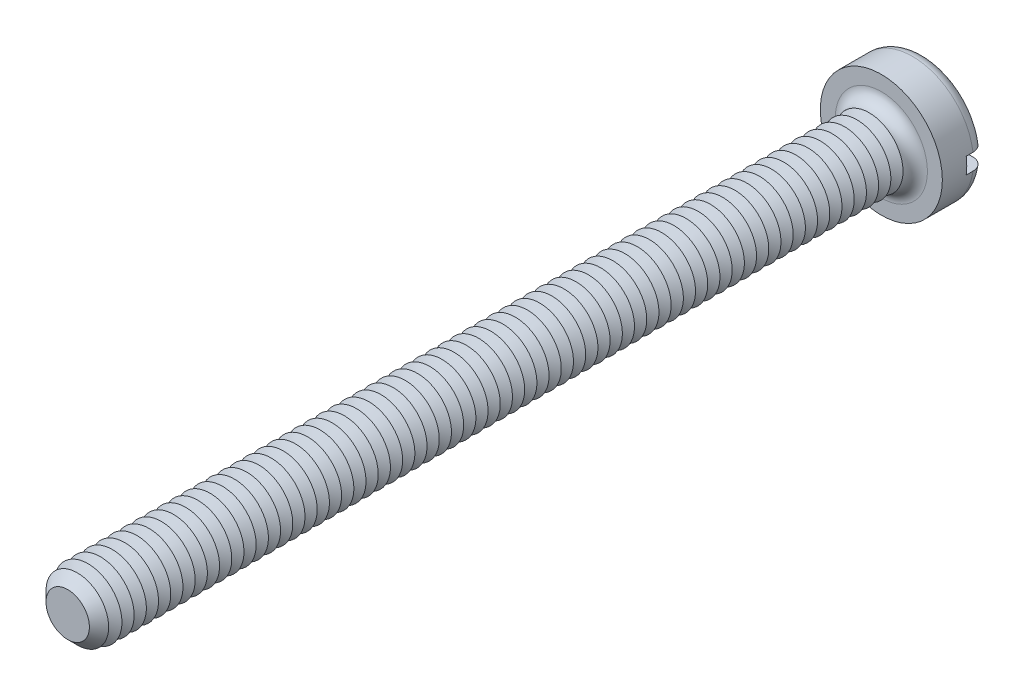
ISO-10303-21;
HEADER;
FILE_DESCRIPTION(('STEP AP214'),'2;1');
FILE_NAME('part.step','',(''),(''),'','','');
FILE_SCHEMA(('AUTOMOTIVE_DESIGN { 1 0 10303 214 1 1 1 1 }'));
ENDSEC;
DATA;
#1=APPLICATION_CONTEXT('core data for automotive mechanical design processes');
#2=APPLICATION_PROTOCOL_DEFINITION('international standard','automotive_design',2000,#1);
#3=PRODUCT_CONTEXT('',#1,'mechanical');
#4=PRODUCT('Part','Part','',(#3));
#5=PRODUCT_RELATED_PRODUCT_CATEGORY('part','',(#4));
#6=PRODUCT_DEFINITION_FORMATION('','',#4);
#7=PRODUCT_DEFINITION_CONTEXT('part definition',#1,'design');
#8=PRODUCT_DEFINITION('design','',#6,#7);
#9=PRODUCT_DEFINITION_SHAPE('','',#8);
#10=(LENGTH_UNIT() NAMED_UNIT(*) SI_UNIT(.MILLI.,.METRE.));
#11=(NAMED_UNIT(*) PLANE_ANGLE_UNIT() SI_UNIT($,.RADIAN.));
#12=(NAMED_UNIT(*) SI_UNIT($,.STERADIAN.) SOLID_ANGLE_UNIT());
#13=UNCERTAINTY_MEASURE_WITH_UNIT(LENGTH_MEASURE(1.E-05),#10,'distance_accuracy_value','');
#14=(GEOMETRIC_REPRESENTATION_CONTEXT(3) GLOBAL_UNCERTAINTY_ASSIGNED_CONTEXT((#13)) GLOBAL_UNIT_ASSIGNED_CONTEXT((#10,
#11,#12)) REPRESENTATION_CONTEXT('',''));
#15=CARTESIAN_POINT('',(0.,0.,0.));
#16=DIRECTION('',(0.,0.,1.));
#17=DIRECTION('',(1.,0.,0.));
#18=AXIS2_PLACEMENT_3D('',#15,#16,#17);
#19=CARTESIAN_POINT('',(0.,0.,-1.6));
#20=DIRECTION('',(0.,0.,1.));
#21=DIRECTION('',(1.,0.,0.));
#22=AXIS2_PLACEMENT_3D('',#19,#20,#21);
#23=PLANE('',#22);
#24=CARTESIAN_POINT('',(0.,0.,-1.6));
#25=DIRECTION('',(0.,0.,1.));
#26=DIRECTION('',(1.,0.,0.));
#27=AXIS2_PLACEMENT_3D('',#24,#25,#26);
#28=CIRCLE('',#27,1.8);
#29=CARTESIAN_POINT('',(-1.77482393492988,0.3,-1.6));
#30=VERTEX_POINT('',#29);
#31=CARTESIAN_POINT('',(1.77482393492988,0.3,-1.6));
#32=VERTEX_POINT('',#31);
#33=EDGE_CURVE('E116',#30,#32,#28,.F.);
#34=ORIENTED_EDGE('',*,*,#33,.T.);
#35=DIRECTION('',(1.,0.,0.));
#36=VECTOR('',#35,1.);
#37=CARTESIAN_POINT('',(-2.25,0.3,-1.6));
#38=LINE('',#37,#36);
#39=EDGE_CURVE('E111',#30,#32,#38,.T.);
#40=ORIENTED_EDGE('',*,*,#39,.F.);
#41=EDGE_LOOP('',(#34,#40));
#42=FACE_BOUND('',#41,.T.);
#43=ADVANCED_FACE('F39',(#42),#23,.F.);
#44=CARTESIAN_POINT('',(0.,0.,-1.15));
#45=DIRECTION('',(0.,0.,1.));
#46=DIRECTION('',(1.,0.,0.));
#47=AXIS2_PLACEMENT_3D('',#44,#45,#46);
#48=TOROIDAL_SURFACE('',#47,1.8,0.45);
#49=CARTESIAN_POINT('',(-2.09367249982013,0.3,-1.4713087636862));
#50=CARTESIAN_POINT('',(-2.07531034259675,0.3,-1.48912990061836));
#51=CARTESIAN_POINT('',(-2.05541605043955,0.3,-1.50540110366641));
#52=CARTESIAN_POINT('',(-2.01315405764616,0.3,-1.53437465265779));
#53=CARTESIAN_POINT('',(-1.99078310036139,0.3,-1.54707221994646));
#54=CARTESIAN_POINT('',(-1.94425163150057,0.3,-1.56853090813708));
#55=CARTESIAN_POINT('',(-1.92009286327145,0.3,-1.57729580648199));
#56=CARTESIAN_POINT('',(-1.8706617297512,0.3,-1.59068015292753));
#57=CARTESIAN_POINT('',(-1.84538964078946,0.3,-1.59530062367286));
#58=CARTESIAN_POINT('',(-1.7942134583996,0.3,-1.60031507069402));
#59=CARTESIAN_POINT('',(-1.76830582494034,0.3,-1.60067291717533));
#60=CARTESIAN_POINT('',(-1.71679040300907,0.3,-1.59707477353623));
#61=CARTESIAN_POINT('',(-1.69118264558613,0.3,-1.59311834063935));
#62=CARTESIAN_POINT('',(-1.64075792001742,0.3,-1.58095464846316));
#63=CARTESIAN_POINT('',(-1.61594989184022,0.3,-1.57271029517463));
#64=CARTESIAN_POINT('',(-1.56806655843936,0.3,-1.55217762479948));
#65=CARTESIAN_POINT('',(-1.54499130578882,0.3,-1.53988918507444));
#66=CARTESIAN_POINT('',(-1.50122413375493,0.3,-1.51158963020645));
#67=CARTESIAN_POINT('',(-1.48053389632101,0.3,-1.49557591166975));
#68=CARTESIAN_POINT('',(-1.44217532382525,0.3,-1.46026359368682));
#69=CARTESIAN_POINT('',(-1.42450683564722,0.3,-1.4409651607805));
#70=CARTESIAN_POINT('',(-1.39293961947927,0.3,-1.39986821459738));
#71=CARTESIAN_POINT('',(-1.37899788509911,0.3,-1.37810275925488));
#72=CARTESIAN_POINT('',(-1.35506190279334,0.3,-1.33249939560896));
#73=CARTESIAN_POINT('',(-1.34506709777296,0.3,-1.30866178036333));
#74=CARTESIAN_POINT('',(-1.3295415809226,0.3,-1.26015137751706));
#75=CARTESIAN_POINT('',(-1.32391771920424,0.3,-1.23550839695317));
#76=CARTESIAN_POINT('',(-1.31696995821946,0.3,-1.18562442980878));
#77=CARTESIAN_POINT('',(-1.31564552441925,0.3,-1.16038351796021));
#78=CARTESIAN_POINT('',(-1.31732714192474,0.3,-1.11049178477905));
#79=CARTESIAN_POINT('',(-1.32025766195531,0.3,-1.08583837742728));
#80=CARTESIAN_POINT('',(-1.3302124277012,0.3,-1.03737369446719));
#81=CARTESIAN_POINT('',(-1.33723664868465,0.3,-1.01356241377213));
#82=CARTESIAN_POINT('',(-1.35515820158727,0.3,-0.967413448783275));
#83=CARTESIAN_POINT('',(-1.36606032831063,0.3,-0.945077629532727));
#84=CARTESIAN_POINT('',(-1.39139351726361,0.3,-0.902507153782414));
#85=CARTESIAN_POINT('',(-1.40582489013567,0.3,-0.882272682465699));
#86=CARTESIAN_POINT('',(-1.43808691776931,0.3,-0.844072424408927));
#87=CARTESIAN_POINT('',(-1.4559757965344,0.3,-0.826155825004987));
#88=CARTESIAN_POINT('',(-1.49445205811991,0.3,-0.793502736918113));
#89=CARTESIAN_POINT('',(-1.51503974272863,0.3,-0.778766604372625));
#90=CARTESIAN_POINT('',(-1.55880475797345,0.3,-0.752571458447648));
#91=CARTESIAN_POINT('',(-1.58202794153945,0.3,-0.741189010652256));
#92=CARTESIAN_POINT('',(-1.63004083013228,0.3,-0.722432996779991));
#93=CARTESIAN_POINT('',(-1.65483064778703,0.3,-0.715059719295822));
#94=CARTESIAN_POINT('',(-1.70558060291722,0.3,-0.704463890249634));
#95=CARTESIAN_POINT('',(-1.73155090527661,0.3,-0.701289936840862));
#96=CARTESIAN_POINT('',(-1.78365633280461,0.3,-0.699350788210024));
#97=CARTESIAN_POINT('',(-1.80979145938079,0.3,-0.700585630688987));
#98=CARTESIAN_POINT('',(-1.86145503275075,0.3,-0.70744393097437));
#99=CARTESIAN_POINT('',(-1.88698403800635,0.3,-0.713063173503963));
#100=CARTESIAN_POINT('',(-1.93672112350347,0.3,-0.728546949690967));
#101=CARTESIAN_POINT('',(-1.96092925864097,0.3,-0.738411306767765));
#102=CARTESIAN_POINT('',(-2.00710191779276,0.3,-0.762015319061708));
#103=CARTESIAN_POINT('',(-2.02908465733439,0.3,-0.775719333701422));
#104=CARTESIAN_POINT('',(-2.0704025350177,0.3,-0.806663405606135));
#105=CARTESIAN_POINT('',(-2.08973782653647,0.3,-0.823903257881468));
#106=CARTESIAN_POINT('',(-2.12497879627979,0.3,-0.861218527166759));
#107=CARTESIAN_POINT('',(-2.1409209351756,0.3,-0.881259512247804));
#108=CARTESIAN_POINT('',(-2.16917502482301,0.3,-0.92375535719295));
#109=CARTESIAN_POINT('',(-2.18148717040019,0.3,-0.946210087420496));
#110=CARTESIAN_POINT('',(-2.20201023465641,0.3,-0.99266079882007));
#111=CARTESIAN_POINT('',(-2.21025973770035,0.3,-1.01663973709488));
#112=CARTESIAN_POINT('',(-2.22258852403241,0.3,-1.06564563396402));
#113=CARTESIAN_POINT('',(-2.22666813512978,0.3,-1.0906725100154));
#114=CARTESIAN_POINT('',(-2.23052418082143,0.3,-1.14090288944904));
#115=CARTESIAN_POINT('',(-2.23032644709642,0.3,-1.16610441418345));
#116=CARTESIAN_POINT('',(-2.22569614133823,0.3,-1.21612212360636));
#117=CARTESIAN_POINT('',(-2.2212625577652,0.3,-1.24093821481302));
#118=CARTESIAN_POINT('',(-2.20829785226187,0.3,-1.2894516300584));
#119=CARTESIAN_POINT('',(-2.19976997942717,0.3,-1.31314982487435));
#120=CARTESIAN_POINT('',(-2.17887390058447,0.3,-1.35876313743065));
#121=CARTESIAN_POINT('',(-2.1665103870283,0.3,-1.3806803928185));
#122=CARTESIAN_POINT('',(-2.14384463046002,0.3,-1.4140108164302));
#123=CARTESIAN_POINT('',(-2.13462949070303,0.3,-1.42617780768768));
#124=CARTESIAN_POINT('',(-2.1150151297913,0.3,-1.44951629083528));
#125=CARTESIAN_POINT('',(-2.10461591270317,0.3,-1.46068778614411));
#126=CARTESIAN_POINT('',(-2.09367249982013,0.3,-1.4713087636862));
#127=B_SPLINE_CURVE_WITH_KNOTS('',3,(#49,#50,#51,#52,#53,#54,#55,#56,#57,#58,#59,#60,#61,#62,
#63,#64,#65,#66,#67,#68,#69,#70,#71,#72,#73,#74,#75,#76,#77,#78,#79,#80,#81,#82,#83,#84,#85,#86,
#87,#88,#89,#90,#91,#92,#93,#94,#95,#96,#97,#98,#99,#100,#101,#102,#103,#104,#105,#106,#107,
#108,#109,#110,#111,#112,#113,#114,#115,#116,#117,#118,#119,#120,#121,#122,#123,#124,#125,#126),
.UNSPECIFIED.,.T.,.F.,(4,2,2,2,2,2,2,2,2,2,2,2,2,2,2,2,2,2,2,2,2,2,2,2,2,2,2,2,2,2,2,2,2,2,2,2,
2,2,4),(0.,0.0767085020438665,0.153519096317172,0.230255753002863,0.306973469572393,
0.384340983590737,0.461716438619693,0.539772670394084,0.617831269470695,0.695944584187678,
0.774053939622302,0.851218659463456,0.928372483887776,1.00383319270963,1.07928451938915,
1.15341274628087,1.22754052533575,1.30176027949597,1.37598656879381,1.45159320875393,
1.52720831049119,1.6044355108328,1.68166826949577,1.75978723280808,1.8379068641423,
1.91595148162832,1.99399285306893,2.07133254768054,2.14866775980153,2.22512456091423,
2.30157725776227,2.3772891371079,2.45299506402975,2.52824391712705,2.60351074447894,
2.67871794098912,2.75383349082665,2.79955010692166,2.84526656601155),.UNSPECIFIED.);
#128=CARTESIAN_POINT('',(-2.22991031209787,0.3,-1.14999999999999));
#129=VERTEX_POINT('',#128);
#130=EDGE_CURVE('E705',#129,#30,#127,.T.);
#131=ORIENTED_EDGE('',*,*,#130,.F.);
#132=CARTESIAN_POINT('',(0.,0.,-1.15));
#133=DIRECTION('',(0.,0.,1.));
#134=DIRECTION('',(1.,0.,0.));
#135=AXIS2_PLACEMENT_3D('',#132,#133,#134);
#136=CIRCLE('',#135,2.25);
#137=CARTESIAN_POINT('',(2.22991031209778,0.3,-1.15));
#138=VERTEX_POINT('',#137);
#139=EDGE_CURVE('E125',#138,#129,#136,.T.);
#140=ORIENTED_EDGE('',*,*,#139,.F.);
#141=CARTESIAN_POINT('',(1.39325818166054,0.3,-1.39903402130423));
#142=CARTESIAN_POINT('',(1.40771723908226,0.3,-1.42030595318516));
#143=CARTESIAN_POINT('',(1.4240122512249,0.3,-1.4403555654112));
#144=CARTESIAN_POINT('',(1.45976320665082,0.3,-1.4774406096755));
#145=CARTESIAN_POINT('',(1.47922380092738,0.3,-1.49447152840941));
#146=CARTESIAN_POINT('',(1.5206923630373,0.3,-1.52502510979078));
#147=CARTESIAN_POINT('',(1.54269721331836,0.3,-1.53855200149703));
#148=CARTESIAN_POINT('',(1.58863815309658,0.3,-1.56176272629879));
#149=CARTESIAN_POINT('',(1.61257369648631,0.3,-1.57144764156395));
#150=CARTESIAN_POINT('',(1.66199169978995,0.3,-1.58680804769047));
#151=CARTESIAN_POINT('',(1.68748839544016,0.3,-1.59243778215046));
#152=CARTESIAN_POINT('',(1.73906656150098,0.3,-1.59934902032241));
#153=CARTESIAN_POINT('',(1.76514807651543,0.3,-1.60063019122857));
#154=CARTESIAN_POINT('',(1.81721740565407,0.3,-1.59879130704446));
#155=CARTESIAN_POINT('',(1.84320486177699,0.3,-1.59566102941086));
#156=CARTESIAN_POINT('',(1.89427635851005,0.3,-1.58504931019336));
#157=CARTESIAN_POINT('',(1.91936042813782,0.3,-1.57756800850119));
#158=CARTESIAN_POINT('',(1.9677137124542,0.3,-1.55851722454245));
#159=CARTESIAN_POINT('',(1.99099484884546,0.3,-1.5469780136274));
#160=CARTESIAN_POINT('',(2.03525897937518,0.3,-1.52011224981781));
#161=CARTESIAN_POINT('',(2.05624211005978,0.3,-1.50478592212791));
#162=CARTESIAN_POINT('',(2.09506403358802,0.3,-1.47096472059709));
#163=CARTESIAN_POINT('',(2.11293536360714,0.3,-1.45250719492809));
#164=CARTESIAN_POINT('',(2.14528563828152,0.3,-1.41282609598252));
#165=CARTESIAN_POINT('',(2.15976477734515,0.3,-1.39160268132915));
#166=CARTESIAN_POINT('',(2.18476262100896,0.3,-1.34723254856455));
#167=CARTESIAN_POINT('',(2.19532119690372,0.3,-1.32410828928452));
#168=CARTESIAN_POINT('',(2.21237438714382,0.3,-1.27640693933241));
#169=CARTESIAN_POINT('',(2.21886918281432,0.3,-1.25182991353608));
#170=CARTESIAN_POINT('',(2.2275687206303,0.3,-1.20210937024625));
#171=CARTESIAN_POINT('',(2.22980376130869,0.3,-1.17697115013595));
#172=CARTESIAN_POINT('',(2.23000940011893,0.3,-1.12667754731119));
#173=CARTESIAN_POINT('',(2.22798009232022,0.3,-1.10152216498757));
#174=CARTESIAN_POINT('',(2.21972856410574,0.3,-1.05197773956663));
#175=CARTESIAN_POINT('',(2.21351744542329,0.3,-1.02758684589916));
#176=CARTESIAN_POINT('',(2.19709696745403,0.3,-0.980190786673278));
#177=CARTESIAN_POINT('',(2.18688760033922,0.3,-0.957185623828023));
#178=CARTESIAN_POINT('',(2.1627435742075,0.3,-0.913157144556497));
#179=CARTESIAN_POINT('',(2.14880093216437,0.3,-0.892138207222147));
#180=CARTESIAN_POINT('',(2.11760640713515,0.3,-0.852719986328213));
#181=CARTESIAN_POINT('',(2.10035443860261,0.3,-0.834320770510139));
#182=CARTESIAN_POINT('',(2.06291254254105,0.3,-0.80052923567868));
#183=CARTESIAN_POINT('',(2.04270386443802,0.3,-0.785157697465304));
#184=CARTESIAN_POINT('',(2.0000139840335,0.3,-0.757986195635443));
#185=CARTESIAN_POINT('',(1.97753267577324,0.3,-0.746186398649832));
#186=CARTESIAN_POINT('',(1.93069507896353,0.3,-0.726364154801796));
#187=CARTESIAN_POINT('',(1.90632219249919,0.3,-0.718380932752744));
#188=CARTESIAN_POINT('',(1.85658993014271,0.3,-0.706569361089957));
#189=CARTESIAN_POINT('',(1.83123049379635,0.3,-0.702741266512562));
#190=CARTESIAN_POINT('',(1.77994107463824,0.3,-0.699306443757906));
#191=CARTESIAN_POINT('',(1.75400788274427,0.3,-0.69974759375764));
#192=CARTESIAN_POINT('',(1.70257608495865,0.3,-0.704939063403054));
#193=CARTESIAN_POINT('',(1.67707750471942,0.3,-0.709689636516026));
#194=CARTESIAN_POINT('',(1.62701662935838,0.3,-0.723419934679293));
#195=CARTESIAN_POINT('',(1.60246387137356,0.3,-0.732434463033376));
#196=CARTESIAN_POINT('',(1.55521886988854,0.3,-0.754458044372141));
#197=CARTESIAN_POINT('',(1.53252668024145,0.3,-0.76746721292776));
#198=CARTESIAN_POINT('',(1.48966925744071,0.3,-0.797124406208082));
#199=CARTESIAN_POINT('',(1.46950315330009,0.3,-0.813771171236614));
#200=CARTESIAN_POINT('',(1.43229728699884,0.3,-0.850255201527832));
#201=CARTESIAN_POINT('',(1.41525734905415,0.3,-0.870092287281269));
#202=CARTESIAN_POINT('',(1.3850470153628,0.3,-0.912123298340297));
#203=CARTESIAN_POINT('',(1.37182821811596,0.3,-0.934282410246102));
#204=CARTESIAN_POINT('',(1.34939737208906,0.3,-0.980542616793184));
#205=CARTESIAN_POINT('',(1.34018456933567,0.3,-1.00464334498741));
#206=CARTESIAN_POINT('',(1.32624172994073,0.3,-1.05352472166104));
#207=CARTESIAN_POINT('',(1.32141599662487,0.3,-1.07827808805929));
#208=CARTESIAN_POINT('',(1.31606478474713,0.3,-1.12825155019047));
#209=CARTESIAN_POINT('',(1.31553992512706,0.3,-1.15347171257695));
#210=CARTESIAN_POINT('',(1.31878307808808,0.3,-1.20323022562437));
#211=CARTESIAN_POINT('',(1.32248353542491,0.3,-1.22777305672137));
#212=CARTESIAN_POINT('',(1.33394086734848,0.3,-1.27586981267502));
#213=CARTESIAN_POINT('',(1.34169274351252,0.3,-1.2994249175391));
#214=CARTESIAN_POINT('',(1.35704250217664,0.3,-1.33561898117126));
#215=CARTESIAN_POINT('',(1.36341395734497,0.3,-1.34879219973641));
#216=CARTESIAN_POINT('',(1.37741190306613,0.3,-1.37445328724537));
#217=CARTESIAN_POINT('',(1.38503837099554,0.3,-1.38694116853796));
#218=CARTESIAN_POINT('',(1.39325818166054,0.3,-1.39903402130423));
#219=B_SPLINE_CURVE_WITH_KNOTS('',3,(#141,#142,#143,#144,#145,#146,#147,#148,#149,#150,#151,
#152,#153,#154,#155,#156,#157,#158,#159,#160,#161,#162,#163,#164,#165,#166,#167,#168,#169,#170,
#171,#172,#173,#174,#175,#176,#177,#178,#179,#180,#181,#182,#183,#184,#185,#186,#187,#188,#189,
#190,#191,#192,#193,#194,#195,#196,#197,#198,#199,#200,#201,#202,#203,#204,#205,#206,#207,#208,
#209,#210,#211,#212,#213,#214,#215,#216,#217,#218),.UNSPECIFIED.,.T.,.F.,(4,2,2,2,2,2,2,2,2,2,2,
2,2,2,2,2,2,2,2,2,2,2,2,2,2,2,2,2,2,2,2,2,2,2,2,2,2,2,4),(0.,0.0771077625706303,
0.154329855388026,0.231458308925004,0.308565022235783,0.386528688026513,0.464498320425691,
0.542648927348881,0.620797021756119,0.698374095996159,0.77594655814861,0.852651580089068,
0.929352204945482,1.00524992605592,1.08114426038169,1.15649673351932,1.2318475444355,
1.30699910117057,1.38215080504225,1.45746451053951,1.53278016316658,1.60859599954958,
1.68441537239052,1.76099806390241,1.83758545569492,1.91503273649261,1.99248457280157,
2.07057979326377,2.14867727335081,2.22674775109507,2.30481383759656,2.38184276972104,
2.45885719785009,2.53414829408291,2.6094502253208,2.68356487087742,2.75758829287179,
2.80142397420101,2.84525886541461),.UNSPECIFIED.);
#220=EDGE_CURVE('E707',#32,#138,#219,.T.);
#221=ORIENTED_EDGE('',*,*,#220,.F.);
#222=ORIENTED_EDGE('',*,*,#33,.F.);
#223=EDGE_LOOP('',(#131,#140,#221,#222));
#224=FACE_BOUND('',#223,.T.);
#225=ADVANCED_FACE('F689',(#224),#48,.T.);
#226=CARTESIAN_POINT('',(0.,0.,-1.6));
#227=DIRECTION('',(0.,0.,1.));
#228=DIRECTION('',(1.,0.,0.));
#229=AXIS2_PLACEMENT_3D('',#226,#227,#228);
#230=CYLINDRICAL_SURFACE('',#229,2.25);
#231=DIRECTION('',(0.,0.,1.));
#232=VECTOR('',#231,1.);
#233=CARTESIAN_POINT('',(2.22991031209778,0.3,-1.6));
#234=LINE('',#233,#232);
#235=CARTESIAN_POINT('',(2.22991031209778,0.3,-0.9));
#236=VERTEX_POINT('',#235);
#237=EDGE_CURVE('E723',#138,#236,#234,.T.);
#238=ORIENTED_EDGE('',*,*,#237,.F.);
#239=ORIENTED_EDGE('',*,*,#139,.T.);
#240=DIRECTION('',(0.,0.,1.));
#241=VECTOR('',#240,1.);
#242=CARTESIAN_POINT('',(-2.22991031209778,0.3,-1.6));
#243=LINE('',#242,#241);
#244=CARTESIAN_POINT('',(-2.22991031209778,0.3,-0.9));
#245=VERTEX_POINT('',#244);
#246=EDGE_CURVE('E63',#245,#129,#243,.F.);
#247=ORIENTED_EDGE('',*,*,#246,.F.);
#248=CARTESIAN_POINT('',(0.,0.,-0.9));
#249=DIRECTION('',(0.,0.,-1.));
#250=DIRECTION('',(-1.,0.,0.));
#251=AXIS2_PLACEMENT_3D('',#248,#249,#250);
#252=CIRCLE('',#251,2.25);
#253=CARTESIAN_POINT('',(-2.22991031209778,-0.3,-0.9));
#254=VERTEX_POINT('',#253);
#255=EDGE_CURVE('E43',#245,#254,#252,.F.);
#256=ORIENTED_EDGE('',*,*,#255,.T.);
#257=DIRECTION('',(0.,0.,1.));
#258=VECTOR('',#257,1.);
#259=CARTESIAN_POINT('',(-2.22991031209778,-0.3,-1.6));
#260=LINE('',#259,#258);
#261=CARTESIAN_POINT('',(-2.22991031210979,-0.3,-1.15000000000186));
#262=VERTEX_POINT('',#261);
#263=EDGE_CURVE('E720',#262,#254,#260,.T.);
#264=ORIENTED_EDGE('',*,*,#263,.F.);
#265=CARTESIAN_POINT('',(2.22991031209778,-0.3,-1.15));
#266=VERTEX_POINT('',#265);
#267=EDGE_CURVE('E127',#262,#266,#136,.T.);
#268=ORIENTED_EDGE('',*,*,#267,.T.);
#269=DIRECTION('',(0.,0.,1.));
#270=VECTOR('',#269,1.);
#271=CARTESIAN_POINT('',(2.22991031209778,-0.3,-1.6));
#272=LINE('',#271,#270);
#273=CARTESIAN_POINT('',(2.22991031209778,-0.3,-0.9));
#274=VERTEX_POINT('',#273);
#275=EDGE_CURVE('E55',#274,#266,#272,.F.);
#276=ORIENTED_EDGE('',*,*,#275,.F.);
#277=EDGE_CURVE('E11',#274,#236,#252,.F.);
#278=ORIENTED_EDGE('',*,*,#277,.T.);
#279=EDGE_LOOP('',(#238,#239,#247,#256,#264,#268,#276,#278));
#280=FACE_BOUND('',#279,.T.);
#281=CARTESIAN_POINT('',(0.,0.,0.));
#282=DIRECTION('',(0.,0.,1.));
#283=DIRECTION('',(1.,0.,0.));
#284=AXIS2_PLACEMENT_3D('',#281,#282,#283);
#285=CIRCLE('',#284,2.25);
#286=CARTESIAN_POINT('',(2.25,0.,0.));
#287=VERTEX_POINT('',#286);
#288=EDGE_CURVE('E726',#287,#287,#285,.T.);
#289=ORIENTED_EDGE('',*,*,#288,.F.);
#290=EDGE_LOOP('',(#289));
#291=FACE_BOUND('',#290,.T.);
#292=ADVANCED_FACE('F685',(#280,#291),#230,.T.);
#293=CARTESIAN_POINT('',(1.77482393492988,-0.3,-1.6));
#294=VERTEX_POINT('',#293);
#295=CARTESIAN_POINT('',(-1.77482393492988,-0.3,-1.6));
#296=VERTEX_POINT('',#295);
#297=EDGE_CURVE('E109',#294,#296,#28,.F.);
#298=ORIENTED_EDGE('',*,*,#297,.T.);
#299=DIRECTION('',(-1.,0.,0.));
#300=VECTOR('',#299,1.);
#301=CARTESIAN_POINT('',(-2.25,-0.3,-1.6));
#302=LINE('',#301,#300);
#303=EDGE_CURVE('E96',#294,#296,#302,.T.);
#304=ORIENTED_EDGE('',*,*,#303,.F.);
#305=EDGE_LOOP('',(#298,#304));
#306=FACE_BOUND('',#305,.T.);
#307=ADVANCED_FACE('F108',(#306),#23,.F.);
#308=CARTESIAN_POINT('',(0.,0.,0.));
#309=DIRECTION('',(0.,0.,1.));
#310=DIRECTION('',(1.,0.,0.));
#311=AXIS2_PLACEMENT_3D('',#308,#309,#310);
#312=PLANE('',#311);
#313=CARTESIAN_POINT('',(0.,0.,0.));
#314=DIRECTION('',(0.,0.,1.));
#315=DIRECTION('',(1.,0.,0.));
#316=AXIS2_PLACEMENT_3D('',#313,#314,#315);
#317=CIRCLE('',#316,1.7);
#318=CARTESIAN_POINT('',(1.7,0.,0.));
#319=VERTEX_POINT('',#318);
#320=EDGE_CURVE('E115',#319,#319,#317,.F.);
#321=ORIENTED_EDGE('',*,*,#320,.T.);
#322=EDGE_LOOP('',(#321));
#323=FACE_BOUND('',#322,.T.);
#324=ORIENTED_EDGE('',*,*,#288,.T.);
#325=EDGE_LOOP('',(#324));
#326=FACE_BOUND('',#325,.T.);
#327=ADVANCED_FACE('F684',(#323,#326),#312,.T.);
#328=CARTESIAN_POINT('',(-2.09367249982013,-0.3,-1.4713087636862));
#329=CARTESIAN_POINT('',(-2.11176539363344,-0.3,-1.45374579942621));
#330=CARTESIAN_POINT('',(-2.1283968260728,-0.3,-1.43465254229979));
#331=CARTESIAN_POINT('',(-2.15823692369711,-0.3,-1.39393307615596));
#332=CARTESIAN_POINT('',(-2.17144184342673,-0.3,-1.37230413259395));
#333=CARTESIAN_POINT('',(-2.19402281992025,-0.3,-1.32713362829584));
#334=CARTESIAN_POINT('',(-2.20339951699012,-0.3,-1.30359238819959));
#335=CARTESIAN_POINT('',(-2.21804409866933,-0.3,-1.25527081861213));
#336=CARTESIAN_POINT('',(-2.22331295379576,-0.3,-1.23049078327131));
#337=CARTESIAN_POINT('',(-2.22957448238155,-0.3,-1.18050893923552));
#338=CARTESIAN_POINT('',(-2.23058617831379,-0.3,-1.15530951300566));
#339=CARTESIAN_POINT('',(-2.22835535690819,-0.3,-1.10509920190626));
#340=CARTESIAN_POINT('',(-2.22511277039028,-0.3,-1.08008832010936));
#341=CARTESIAN_POINT('',(-2.21448018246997,-0.3,-1.03101646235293));
#342=CARTESIAN_POINT('',(-2.20709836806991,-0.3,-1.00695371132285));
#343=CARTESIAN_POINT('',(-2.18841075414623,-0.3,-0.960404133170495));
#344=CARTESIAN_POINT('',(-2.17710493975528,-0.3,-0.937917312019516));
#345=CARTESIAN_POINT('',(-2.15086234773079,-0.3,-0.895085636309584));
#346=CARTESIAN_POINT('',(-2.13591537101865,-0.3,-0.874747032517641));
#347=CARTESIAN_POINT('',(-2.1028415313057,-0.3,-0.836845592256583));
#348=CARTESIAN_POINT('',(-2.08471458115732,-0.3,-0.819282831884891));
#349=CARTESIAN_POINT('',(-2.0456590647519,-0.3,-0.78729174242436));
#350=CARTESIAN_POINT('',(-2.0247112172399,-0.3,-0.772886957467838));
#351=CARTESIAN_POINT('',(-1.98071452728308,-0.3,-0.747756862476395));
#352=CARTESIAN_POINT('',(-1.95766557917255,-0.3,-0.737031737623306));
#353=CARTESIAN_POINT('',(-1.90986554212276,-0.3,-0.71944451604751));
#354=CARTESIAN_POINT('',(-1.88509923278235,-0.3,-0.712623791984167));
#355=CARTESIAN_POINT('',(-1.83477837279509,-0.3,-0.703186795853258));
#356=CARTESIAN_POINT('',(-1.80922377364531,-0.3,-0.700570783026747));
#357=CARTESIAN_POINT('',(-1.75774893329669,-0.3,-0.699591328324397));
#358=CARTESIAN_POINT('',(-1.73182778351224,-0.3,-0.701275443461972));
#359=CARTESIAN_POINT('',(-1.68062744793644,-0.3,-0.708937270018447));
#360=CARTESIAN_POINT('',(-1.65534829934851,-0.3,-0.714915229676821));
#361=CARTESIAN_POINT('',(-1.6059539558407,-0.3,-0.731056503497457));
#362=CARTESIAN_POINT('',(-1.58184881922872,-0.3,-0.741250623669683));
#363=CARTESIAN_POINT('',(-1.53569497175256,-0.3,-0.765548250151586));
#364=CARTESIAN_POINT('',(-1.51364629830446,-0.3,-0.779651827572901));
#365=CARTESIAN_POINT('',(-1.47229470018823,-0.3,-0.811355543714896));
#366=CARTESIAN_POINT('',(-1.45298625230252,-0.3,-0.828948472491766));
#367=CARTESIAN_POINT('',(-1.41765142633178,-0.3,-0.867170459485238));
#368=CARTESIAN_POINT('',(-1.40162480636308,-0.3,-0.887799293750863));
#369=CARTESIAN_POINT('',(-1.37358365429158,-0.3,-0.93118317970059));
#370=CARTESIAN_POINT('',(-1.3615121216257,-0.3,-0.953901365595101));
#371=CARTESIAN_POINT('',(-1.34145576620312,-0.3,-1.00107529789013));
#372=CARTESIAN_POINT('',(-1.33347032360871,-0.3,-1.02553078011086));
#373=CARTESIAN_POINT('',(-1.32199536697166,-0.3,-1.07489401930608));
#374=CARTESIAN_POINT('',(-1.31840873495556,-0.3,-1.09977921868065));
#375=CARTESIAN_POINT('',(-1.31553052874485,-0.3,-1.1497957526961));
#376=CARTESIAN_POINT('',(-1.31623852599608,-0.3,-1.17492706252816));
#377=CARTESIAN_POINT('',(-1.32188368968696,-0.3,-1.22435119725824));
#378=CARTESIAN_POINT('',(-1.32676151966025,-0.3,-1.24865083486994));
#379=CARTESIAN_POINT('',(-1.34050334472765,-0.3,-1.29609421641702));
#380=CARTESIAN_POINT('',(-1.34936742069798,-0.3,-1.31923793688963));
#381=CARTESIAN_POINT('',(-1.37086295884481,-0.3,-1.36387796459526));
#382=CARTESIAN_POINT('',(-1.38351729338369,-0.3,-1.38536324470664));
#383=CARTESIAN_POINT('',(-1.41218367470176,-0.3,-1.42596199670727));
#384=CARTESIAN_POINT('',(-1.42819606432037,-0.3,-1.44507522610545));
#385=CARTESIAN_POINT('',(-1.46347664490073,-0.3,-1.48081087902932));
#386=CARTESIAN_POINT('',(-1.48280543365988,-0.3,-1.49737347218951));
#387=CARTESIAN_POINT('',(-1.5239232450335,-0.3,-1.52709508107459));
#388=CARTESIAN_POINT('',(-1.54571253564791,-0.3,-1.54025372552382));
#389=CARTESIAN_POINT('',(-1.59160097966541,-0.3,-1.56305446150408));
#390=CARTESIAN_POINT('',(-1.61573734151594,-0.3,-1.57262172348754));
#391=CARTESIAN_POINT('',(-1.66526504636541,-0.3,-1.58760700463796));
#392=CARTESIAN_POINT('',(-1.69065641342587,-0.3,-1.59302494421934));
#393=CARTESIAN_POINT('',(-1.74220154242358,-0.3,-1.59958446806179));
#394=CARTESIAN_POINT('',(-1.7683598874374,-0.3,-1.60069012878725));
#395=CARTESIAN_POINT('',(-1.82049681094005,-0.3,-1.59847888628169));
#396=CARTESIAN_POINT('',(-1.8464753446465,-0.3,-1.59516091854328));
#397=CARTESIAN_POINT('',(-1.89742078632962,-0.3,-1.58419269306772));
#398=CARTESIAN_POINT('',(-1.92239041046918,-0.3,-1.57655503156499));
#399=CARTESIAN_POINT('',(-1.97064988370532,-0.3,-1.55715679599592));
#400=CARTESIAN_POINT('',(-1.99394179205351,-0.3,-1.54540138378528));
#401=CARTESIAN_POINT('',(-2.03003215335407,-0.3,-1.52312594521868));
#402=CARTESIAN_POINT('',(-2.04354254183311,-0.3,-1.51373809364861));
#403=CARTESIAN_POINT('',(-2.06946640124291,-0.3,-1.49355310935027));
#404=CARTESIAN_POINT('',(-2.08187987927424,-0.3,-1.48275598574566));
#405=CARTESIAN_POINT('',(-2.09367249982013,-0.3,-1.4713087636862));
#406=B_SPLINE_CURVE_WITH_KNOTS('',3,(#328,#329,#330,#331,#332,#333,#334,#335,#336,#337,#338,
#339,#340,#341,#342,#343,#344,#345,#346,#347,#348,#349,#350,#351,#352,#353,#354,#355,#356,#357,
#358,#359,#360,#361,#362,#363,#364,#365,#366,#367,#368,#369,#370,#371,#372,#373,#374,#375,#376,
#377,#378,#379,#380,#381,#382,#383,#384,#385,#386,#387,#388,#389,#390,#391,#392,#393,#394,#395,
#396,#397,#398,#399,#400,#401,#402,#403,#404,#405),.UNSPECIFIED.,.T.,.F.,(4,2,2,2,2,2,2,2,2,2,2,
2,2,2,2,2,2,2,2,2,2,2,2,2,2,2,2,2,2,2,2,2,2,2,2,2,2,2,4),(0.,0.0755864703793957,
0.151255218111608,0.226911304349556,0.302549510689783,0.377849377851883,0.453150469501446,
0.528303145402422,0.603456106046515,0.67882204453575,0.754190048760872,0.83010216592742,
0.906018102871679,0.982724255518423,1.05943513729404,1.13699806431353,1.21456547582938,
1.29270994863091,1.37085584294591,1.44884191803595,1.52682224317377,1.60362346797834,
1.68041303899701,1.75547480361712,1.83052907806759,1.90453278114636,1.97853798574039,
2.05299909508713,2.12746781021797,2.20347986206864,2.27950020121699,2.3570265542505,
2.43455439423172,2.5127267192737,2.59091785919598,2.66888216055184,2.74674907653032,
2.79601528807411,2.84528118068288),.UNSPECIFIED.);
#407=EDGE_CURVE('E103',#296,#262,#406,.T.);
#408=ORIENTED_EDGE('',*,*,#407,.F.);
#409=ORIENTED_EDGE('',*,*,#297,.F.);
#410=CARTESIAN_POINT('',(1.39325818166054,-0.3,-1.39903402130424));
#411=CARTESIAN_POINT('',(1.37924349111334,-0.3,-1.37841200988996));
#412=CARTESIAN_POINT('',(1.36693374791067,-0.3,-1.35661225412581));
#413=CARTESIAN_POINT('',(1.34612289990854,-0.3,-1.31124547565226));
#414=CARTESIAN_POINT('',(1.33762533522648,-0.3,-1.28767683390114));
#415=CARTESIAN_POINT('',(1.32472877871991,-0.3,-1.23943261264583));
#416=CARTESIAN_POINT('',(1.3203309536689,-0.3,-1.21475672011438));
#417=CARTESIAN_POINT('',(1.31579198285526,-0.3,-1.16502199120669));
#418=CARTESIAN_POINT('',(1.31564980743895,-0.3,-1.13996324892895));
#419=CARTESIAN_POINT('',(1.31960322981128,-0.3,-1.09044336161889));
#420=CARTESIAN_POINT('',(1.32365524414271,-0.3,-1.06597872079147));
#421=CARTESIAN_POINT('',(1.33579339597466,-0.3,-1.01807218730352));
#422=CARTESIAN_POINT('',(1.34387971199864,-0.3,-0.994630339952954));
#423=CARTESIAN_POINT('',(1.36386460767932,-0.3,-0.949319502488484));
#424=CARTESIAN_POINT('',(1.37577869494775,-0.3,-0.92745736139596));
#425=CARTESIAN_POINT('',(1.40303929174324,-0.3,-0.885990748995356));
#426=CARTESIAN_POINT('',(1.41838612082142,-0.3,-0.866386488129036));
#427=CARTESIAN_POINT('',(1.45239955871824,-0.3,-0.829572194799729));
#428=CARTESIAN_POINT('',(1.47112624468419,-0.3,-0.812417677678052));
#429=CARTESIAN_POINT('',(1.51114353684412,-0.3,-0.78141873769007));
#430=CARTESIAN_POINT('',(1.53243442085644,-0.3,-0.767574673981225));
#431=CARTESIAN_POINT('',(1.57744959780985,-0.3,-0.743302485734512));
#432=CARTESIAN_POINT('',(1.6012148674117,-0.3,-0.732950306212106));
#433=CARTESIAN_POINT('',(1.65013556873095,-0.3,-0.71633816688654));
#434=CARTESIAN_POINT('',(1.67529109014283,-0.3,-0.710078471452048));
#435=CARTESIAN_POINT('',(1.72654223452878,-0.3,-0.701786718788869));
#436=CARTESIAN_POINT('',(1.75264462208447,-0.3,-0.699796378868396));
#437=CARTESIAN_POINT('',(1.80481283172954,-0.3,-0.700236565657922));
#438=CARTESIAN_POINT('',(1.83087865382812,-0.3,-0.702667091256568));
#439=CARTESIAN_POINT('',(1.88216421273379,-0.3,-0.71188843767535));
#440=CARTESIAN_POINT('',(1.90738581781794,-0.3,-0.718668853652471));
#441=CARTESIAN_POINT('',(1.95631449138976,-0.3,-0.736408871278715));
#442=CARTESIAN_POINT('',(1.98002162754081,-0.3,-0.747368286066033));
#443=CARTESIAN_POINT('',(2.02500221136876,-0.3,-0.773046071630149));
#444=CARTESIAN_POINT('',(2.04629687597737,-0.3,-0.78772726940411));
#445=CARTESIAN_POINT('',(2.08608258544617,-0.3,-0.820494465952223));
#446=CARTESIAN_POINT('',(2.10457379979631,-0.3,-0.838580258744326));
#447=CARTESIAN_POINT('',(2.1380062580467,-0.3,-0.877422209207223));
#448=CARTESIAN_POINT('',(2.15298532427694,-0.3,-0.898145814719));
#449=CARTESIAN_POINT('',(2.17921311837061,-0.3,-0.941832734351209));
#450=CARTESIAN_POINT('',(2.19046204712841,-0.3,-0.964795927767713));
#451=CARTESIAN_POINT('',(2.20880507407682,-0.3,-1.01207981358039));
#452=CARTESIAN_POINT('',(2.2159367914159,-0.3,-1.0363859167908));
#453=CARTESIAN_POINT('',(2.22599386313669,-0.3,-1.08585317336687));
#454=CARTESIAN_POINT('',(2.22891936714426,-0.3,-1.11101429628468));
#455=CARTESIAN_POINT('',(2.23047255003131,-0.3,-1.16133395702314));
#456=CARTESIAN_POINT('',(2.22912306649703,-0.3,-1.18649179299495));
#457=CARTESIAN_POINT('',(2.22221641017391,-0.3,-1.236222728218));
#458=CARTESIAN_POINT('',(2.21665928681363,-0.3,-1.26079583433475));
#459=CARTESIAN_POINT('',(2.20150655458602,-0.3,-1.30864604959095));
#460=CARTESIAN_POINT('',(2.19191347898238,-0.3,-1.3319239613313));
#461=CARTESIAN_POINT('',(2.16897085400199,-0.3,-1.37654778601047));
#462=CARTESIAN_POINT('',(2.15562126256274,-0.3,-1.39789367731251));
#463=CARTESIAN_POINT('',(2.12549147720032,-0.3,-1.43814583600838));
#464=CARTESIAN_POINT('',(2.1086973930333,-0.3,-1.45704170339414));
#465=CARTESIAN_POINT('',(2.07219852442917,-0.3,-1.491773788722));
#466=CARTESIAN_POINT('',(2.0524936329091,-0.3,-1.50760989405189));
#467=CARTESIAN_POINT('',(2.01056127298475,-0.3,-1.53591667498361));
#468=CARTESIAN_POINT('',(1.98831430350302,-0.3,-1.54835845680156));
#469=CARTESIAN_POINT('',(1.94206418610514,-0.3,-1.5693763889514));
#470=CARTESIAN_POINT('',(1.91806093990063,-0.3,-1.57795232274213));
#471=CARTESIAN_POINT('',(1.86869953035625,-0.3,-1.5910955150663));
#472=CARTESIAN_POINT('',(1.84332941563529,-0.3,-1.59561788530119));
#473=CARTESIAN_POINT('',(1.7921914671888,-0.3,-1.60038767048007));
#474=CARTESIAN_POINT('',(1.76642362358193,-0.3,-1.60063497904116));
#475=CARTESIAN_POINT('',(1.71493241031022,-0.3,-1.59684388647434));
#476=CARTESIAN_POINT('',(1.6892123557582,-0.3,-1.59276040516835));
#477=CARTESIAN_POINT('',(1.63880694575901,-0.3,-1.58035661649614));
#478=CARTESIAN_POINT('',(1.61412189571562,-0.3,-1.5720350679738));
#479=CARTESIAN_POINT('',(1.56635013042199,-0.3,-1.55132424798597));
#480=CARTESIAN_POINT('',(1.54327365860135,-0.3,-1.53891136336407));
#481=CARTESIAN_POINT('',(1.49956705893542,-0.3,-1.51037484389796));
#482=CARTESIAN_POINT('',(1.478934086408,-0.3,-1.49425558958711));
#483=CARTESIAN_POINT('',(1.44732882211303,-0.3,-1.46489751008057));
#484=CARTESIAN_POINT('',(1.43548118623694,-0.3,-1.45258668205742));
#485=CARTESIAN_POINT('',(1.41324217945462,-0.3,-1.42671249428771));
#486=CARTESIAN_POINT('',(1.40285079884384,-0.3,-1.41314914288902));
#487=CARTESIAN_POINT('',(1.39325818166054,-0.3,-1.39903402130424));
#488=B_SPLINE_CURVE_WITH_KNOTS('',3,(#410,#411,#412,#413,#414,#415,#416,#417,#418,#419,#420,
#421,#422,#423,#424,#425,#426,#427,#428,#429,#430,#431,#432,#433,#434,#435,#436,#437,#438,#439,
#440,#441,#442,#443,#444,#445,#446,#447,#448,#449,#450,#451,#452,#453,#454,#455,#456,#457,#458,
#459,#460,#461,#462,#463,#464,#465,#466,#467,#468,#469,#470,#471,#472,#473,#474,#475,#476,#477,
#478,#479,#480,#481,#482,#483,#484,#485,#486,#487),.UNSPECIFIED.,.T.,.F.,(4,2,2,2,2,2,2,2,2,2,2,
2,2,2,2,2,2,2,2,2,2,2,2,2,2,2,2,2,2,2,2,2,2,2,2,2,2,2,4),(0.,0.0747398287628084,
0.149548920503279,0.224379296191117,0.29919156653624,0.373234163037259,0.447280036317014,
0.521629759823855,0.595986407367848,0.671825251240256,0.747672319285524,0.825076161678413,
0.902485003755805,0.980646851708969,1.05880868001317,1.13678424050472,1.21475631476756,
1.29197834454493,1.36919570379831,1.44553881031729,1.52187780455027,1.59750777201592,
1.67313504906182,1.74835899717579,1.82358206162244,1.89875798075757,1.97393474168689,
2.04942084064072,2.12490971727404,2.20102244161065,2.27713942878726,2.35408926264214,
2.43104101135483,2.50880170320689,2.58658518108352,2.66482568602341,2.74297419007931,
2.79413160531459,2.84528867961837),.UNSPECIFIED.);
#489=EDGE_CURVE('E92',#266,#294,#488,.T.);
#490=ORIENTED_EDGE('',*,*,#489,.F.);
#491=ORIENTED_EDGE('',*,*,#267,.F.);
#492=EDGE_LOOP('',(#408,#409,#490,#491));
#493=FACE_BOUND('',#492,.T.);
#494=ADVANCED_FACE('F113',(#493),#48,.T.);
#495=CARTESIAN_POINT('',(0.,0.,0.449999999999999));
#496=DIRECTION('',(0.,0.,1.));
#497=DIRECTION('',(1.,0.,0.));
#498=AXIS2_PLACEMENT_3D('',#495,#496,#497);
#499=TOROIDAL_SURFACE('',#498,1.7,0.45);
#500=ORIENTED_EDGE('',*,*,#320,.F.);
#501=EDGE_LOOP('',(#500));
#502=FACE_BOUND('',#501,.T.);
#503=CARTESIAN_POINT('',(0.,0.,0.449999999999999));
#504=DIRECTION('',(0.,0.,-1.));
#505=DIRECTION('',(-1.,0.,0.));
#506=AXIS2_PLACEMENT_3D('',#503,#504,#505);
#507=CIRCLE('',#506,1.25);
#508=CARTESIAN_POINT('',(-1.25,0.,0.449999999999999));
#509=VERTEX_POINT('',#508);
#510=EDGE_CURVE('E731',#509,#509,#507,.T.);
#511=ORIENTED_EDGE('',*,*,#510,.T.);
#512=EDGE_LOOP('',(#511));
#513=FACE_BOUND('',#512,.T.);
#514=ADVANCED_FACE('F677',(#502,#513),#499,.F.);
#515=CARTESIAN_POINT('',(0.,0.,0.674999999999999));
#516=DIRECTION('',(0.,0.,-1.));
#517=DIRECTION('',(-1.,0.,0.));
#518=AXIS2_PLACEMENT_3D('',#515,#516,#517);
#519=CONICAL_SURFACE('',#518,0.860288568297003,1.0471975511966);
#520=ORIENTED_EDGE('',*,*,#510,.F.);
#521=EDGE_LOOP('',(#520));
#522=FACE_BOUND('',#521,.T.);
#523=CARTESIAN_POINT('',(0.,0.,0.674999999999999));
#524=DIRECTION('',(0.,0.,-1.));
#525=DIRECTION('',(-1.,0.,0.));
#526=AXIS2_PLACEMENT_3D('',#523,#524,#525);
#527=CIRCLE('',#526,0.860288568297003);
#528=CARTESIAN_POINT('',(-0.860288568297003,0.,0.674999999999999));
#529=VERTEX_POINT('',#528);
#530=EDGE_CURVE('E736',#529,#529,#527,.T.);
#531=ORIENTED_EDGE('',*,*,#530,.T.);
#532=EDGE_LOOP('',(#531));
#533=FACE_BOUND('',#532,.T.);
#534=ADVANCED_FACE('F673',(#522,#533),#519,.T.);
#535=CARTESIAN_POINT('',(0.,0.,0.899999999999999));
#536=DIRECTION('',(0.,0.,1.));
#537=DIRECTION('',(1.,0.,0.));
#538=AXIS2_PLACEMENT_3D('',#535,#536,#537);
#539=CONICAL_SURFACE('',#538,1.25,1.0471975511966);
#540=ORIENTED_EDGE('',*,*,#530,.F.);
#541=EDGE_LOOP('',(#540));
#542=FACE_BOUND('',#541,.T.);
#543=CARTESIAN_POINT('',(0.,0.,0.899999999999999));
#544=DIRECTION('',(0.,0.,-1.));
#545=DIRECTION('',(-1.,0.,0.));
#546=AXIS2_PLACEMENT_3D('',#543,#544,#545);
#547=CIRCLE('',#546,1.25);
#548=CARTESIAN_POINT('',(-1.25,0.,0.899999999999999));
#549=VERTEX_POINT('',#548);
#550=EDGE_CURVE('E742',#549,#549,#547,.T.);
#551=ORIENTED_EDGE('',*,*,#550,.T.);
#552=EDGE_LOOP('',(#551));
#553=FACE_BOUND('',#552,.T.);
#554=ADVANCED_FACE('F669',(#542,#553),#539,.T.);
#555=CARTESIAN_POINT('',(0.,0.,1.125));
#556=DIRECTION('',(0.,0.,-1.));
#557=DIRECTION('',(-1.,0.,0.));
#558=AXIS2_PLACEMENT_3D('',#555,#556,#557);
#559=CONICAL_SURFACE('',#558,0.860288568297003,1.0471975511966);
#560=ORIENTED_EDGE('',*,*,#550,.F.);
#561=EDGE_LOOP('',(#560));
#562=FACE_BOUND('',#561,.T.);
#563=CARTESIAN_POINT('',(0.,0.,1.125));
#564=DIRECTION('',(0.,0.,-1.));
#565=DIRECTION('',(-1.,0.,0.));
#566=AXIS2_PLACEMENT_3D('',#563,#564,#565);
#567=CIRCLE('',#566,0.860288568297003);
#568=CARTESIAN_POINT('',(-0.860288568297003,0.,1.125));
#569=VERTEX_POINT('',#568);
#570=EDGE_CURVE('E746',#569,#569,#567,.T.);
#571=ORIENTED_EDGE('',*,*,#570,.T.);
#572=EDGE_LOOP('',(#571));
#573=FACE_BOUND('',#572,.T.);
#574=ADVANCED_FACE('F665',(#562,#573),#559,.T.);
#575=CARTESIAN_POINT('',(0.,0.,1.35));
#576=DIRECTION('',(0.,0.,1.));
#577=DIRECTION('',(1.,0.,0.));
#578=AXIS2_PLACEMENT_3D('',#575,#576,#577);
#579=CONICAL_SURFACE('',#578,1.25,1.0471975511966);
#580=ORIENTED_EDGE('',*,*,#570,.F.);
#581=EDGE_LOOP('',(#580));
#582=FACE_BOUND('',#581,.T.);
#583=CARTESIAN_POINT('',(0.,0.,1.35));
#584=DIRECTION('',(0.,0.,-1.));
#585=DIRECTION('',(-1.,0.,0.));
#586=AXIS2_PLACEMENT_3D('',#583,#584,#585);
#587=CIRCLE('',#586,1.25);
#588=CARTESIAN_POINT('',(-1.25,0.,1.35));
#589=VERTEX_POINT('',#588);
#590=EDGE_CURVE('E749',#589,#589,#587,.T.);
#591=ORIENTED_EDGE('',*,*,#590,.T.);
#592=EDGE_LOOP('',(#591));
#593=FACE_BOUND('',#592,.T.);
#594=ADVANCED_FACE('F661',(#582,#593),#579,.T.);
#595=CARTESIAN_POINT('',(0.,0.,1.575));
#596=DIRECTION('',(0.,0.,-1.));
#597=DIRECTION('',(-1.,0.,0.));
#598=AXIS2_PLACEMENT_3D('',#595,#596,#597);
#599=CONICAL_SURFACE('',#598,0.860288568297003,1.0471975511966);
#600=ORIENTED_EDGE('',*,*,#590,.F.);
#601=EDGE_LOOP('',(#600));
#602=FACE_BOUND('',#601,.T.);
#603=CARTESIAN_POINT('',(0.,0.,1.575));
#604=DIRECTION('',(0.,0.,-1.));
#605=DIRECTION('',(-1.,0.,0.));
#606=AXIS2_PLACEMENT_3D('',#603,#604,#605);
#607=CIRCLE('',#606,0.860288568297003);
#608=CARTESIAN_POINT('',(-0.860288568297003,0.,1.575));
#609=VERTEX_POINT('',#608);
#610=EDGE_CURVE('E753',#609,#609,#607,.T.);
#611=ORIENTED_EDGE('',*,*,#610,.T.);
#612=EDGE_LOOP('',(#611));
#613=FACE_BOUND('',#612,.T.);
#614=ADVANCED_FACE('F657',(#602,#613),#599,.T.);
#615=CARTESIAN_POINT('',(0.,0.,1.8));
#616=DIRECTION('',(0.,0.,1.));
#617=DIRECTION('',(1.,0.,0.));
#618=AXIS2_PLACEMENT_3D('',#615,#616,#617);
#619=CONICAL_SURFACE('',#618,1.25,1.0471975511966);
#620=ORIENTED_EDGE('',*,*,#610,.F.);
#621=EDGE_LOOP('',(#620));
#622=FACE_BOUND('',#621,.T.);
#623=CARTESIAN_POINT('',(0.,0.,1.8));
#624=DIRECTION('',(0.,0.,-1.));
#625=DIRECTION('',(-1.,0.,0.));
#626=AXIS2_PLACEMENT_3D('',#623,#624,#625);
#627=CIRCLE('',#626,1.25);
#628=CARTESIAN_POINT('',(-1.25,0.,1.8));
#629=VERTEX_POINT('',#628);
#630=EDGE_CURVE('E757',#629,#629,#627,.T.);
#631=ORIENTED_EDGE('',*,*,#630,.T.);
#632=EDGE_LOOP('',(#631));
#633=FACE_BOUND('',#632,.T.);
#634=ADVANCED_FACE('F653',(#622,#633),#619,.T.);
#635=CARTESIAN_POINT('',(0.,0.,2.025));
#636=DIRECTION('',(0.,0.,-1.));
#637=DIRECTION('',(-1.,0.,0.));
#638=AXIS2_PLACEMENT_3D('',#635,#636,#637);
#639=CONICAL_SURFACE('',#638,0.860288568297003,1.0471975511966);
#640=ORIENTED_EDGE('',*,*,#630,.F.);
#641=EDGE_LOOP('',(#640));
#642=FACE_BOUND('',#641,.T.);
#643=CARTESIAN_POINT('',(0.,0.,2.025));
#644=DIRECTION('',(0.,0.,-1.));
#645=DIRECTION('',(-1.,0.,0.));
#646=AXIS2_PLACEMENT_3D('',#643,#644,#645);
#647=CIRCLE('',#646,0.860288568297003);
#648=CARTESIAN_POINT('',(-0.860288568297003,0.,2.025));
#649=VERTEX_POINT('',#648);
#650=EDGE_CURVE('E761',#649,#649,#647,.T.);
#651=ORIENTED_EDGE('',*,*,#650,.T.);
#652=EDGE_LOOP('',(#651));
#653=FACE_BOUND('',#652,.T.);
#654=ADVANCED_FACE('F649',(#642,#653),#639,.T.);
#655=CARTESIAN_POINT('',(0.,0.,2.25));
#656=DIRECTION('',(0.,0.,1.));
#657=DIRECTION('',(1.,0.,0.));
#658=AXIS2_PLACEMENT_3D('',#655,#656,#657);
#659=CONICAL_SURFACE('',#658,1.25,1.0471975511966);
#660=ORIENTED_EDGE('',*,*,#650,.F.);
#661=EDGE_LOOP('',(#660));
#662=FACE_BOUND('',#661,.T.);
#663=CARTESIAN_POINT('',(0.,0.,2.25));
#664=DIRECTION('',(0.,0.,-1.));
#665=DIRECTION('',(-1.,0.,0.));
#666=AXIS2_PLACEMENT_3D('',#663,#664,#665);
#667=CIRCLE('',#666,1.25);
#668=CARTESIAN_POINT('',(-1.25,0.,2.25));
#669=VERTEX_POINT('',#668);
#670=EDGE_CURVE('E765',#669,#669,#667,.T.);
#671=ORIENTED_EDGE('',*,*,#670,.T.);
#672=EDGE_LOOP('',(#671));
#673=FACE_BOUND('',#672,.T.);
#674=ADVANCED_FACE('F645',(#662,#673),#659,.T.);
#675=CARTESIAN_POINT('',(0.,0.,2.475));
#676=DIRECTION('',(0.,0.,-1.));
#677=DIRECTION('',(-1.,0.,0.));
#678=AXIS2_PLACEMENT_3D('',#675,#676,#677);
#679=CONICAL_SURFACE('',#678,0.860288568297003,1.0471975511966);
#680=ORIENTED_EDGE('',*,*,#670,.F.);
#681=EDGE_LOOP('',(#680));
#682=FACE_BOUND('',#681,.T.);
#683=CARTESIAN_POINT('',(0.,0.,2.475));
#684=DIRECTION('',(0.,0.,-1.));
#685=DIRECTION('',(-1.,0.,0.));
#686=AXIS2_PLACEMENT_3D('',#683,#684,#685);
#687=CIRCLE('',#686,0.860288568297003);
#688=CARTESIAN_POINT('',(-0.860288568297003,0.,2.475));
#689=VERTEX_POINT('',#688);
#690=EDGE_CURVE('E769',#689,#689,#687,.T.);
#691=ORIENTED_EDGE('',*,*,#690,.T.);
#692=EDGE_LOOP('',(#691));
#693=FACE_BOUND('',#692,.T.);
#694=ADVANCED_FACE('F641',(#682,#693),#679,.T.);
#695=CARTESIAN_POINT('',(0.,0.,2.7));
#696=DIRECTION('',(0.,0.,1.));
#697=DIRECTION('',(1.,0.,0.));
#698=AXIS2_PLACEMENT_3D('',#695,#696,#697);
#699=CONICAL_SURFACE('',#698,1.25,1.0471975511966);
#700=ORIENTED_EDGE('',*,*,#690,.F.);
#701=EDGE_LOOP('',(#700));
#702=FACE_BOUND('',#701,.T.);
#703=CARTESIAN_POINT('',(0.,0.,2.7));
#704=DIRECTION('',(0.,0.,-1.));
#705=DIRECTION('',(-1.,0.,0.));
#706=AXIS2_PLACEMENT_3D('',#703,#704,#705);
#707=CIRCLE('',#706,1.25);
#708=CARTESIAN_POINT('',(-1.25,0.,2.7));
#709=VERTEX_POINT('',#708);
#710=EDGE_CURVE('E773',#709,#709,#707,.T.);
#711=ORIENTED_EDGE('',*,*,#710,.T.);
#712=EDGE_LOOP('',(#711));
#713=FACE_BOUND('',#712,.T.);
#714=ADVANCED_FACE('F637',(#702,#713),#699,.T.);
#715=CARTESIAN_POINT('',(0.,0.,2.925));
#716=DIRECTION('',(0.,0.,-1.));
#717=DIRECTION('',(-1.,0.,0.));
#718=AXIS2_PLACEMENT_3D('',#715,#716,#717);
#719=CONICAL_SURFACE('',#718,0.860288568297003,1.0471975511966);
#720=ORIENTED_EDGE('',*,*,#710,.F.);
#721=EDGE_LOOP('',(#720));
#722=FACE_BOUND('',#721,.T.);
#723=CARTESIAN_POINT('',(0.,0.,2.925));
#724=DIRECTION('',(0.,0.,-1.));
#725=DIRECTION('',(-1.,0.,0.));
#726=AXIS2_PLACEMENT_3D('',#723,#724,#725);
#727=CIRCLE('',#726,0.860288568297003);
#728=CARTESIAN_POINT('',(-0.860288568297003,0.,2.925));
#729=VERTEX_POINT('',#728);
#730=EDGE_CURVE('E777',#729,#729,#727,.T.);
#731=ORIENTED_EDGE('',*,*,#730,.T.);
#732=EDGE_LOOP('',(#731));
#733=FACE_BOUND('',#732,.T.);
#734=ADVANCED_FACE('F633',(#722,#733),#719,.T.);
#735=CARTESIAN_POINT('',(0.,0.,3.15));
#736=DIRECTION('',(0.,0.,1.));
#737=DIRECTION('',(1.,0.,0.));
#738=AXIS2_PLACEMENT_3D('',#735,#736,#737);
#739=CONICAL_SURFACE('',#738,1.25,1.0471975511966);
#740=ORIENTED_EDGE('',*,*,#730,.F.);
#741=EDGE_LOOP('',(#740));
#742=FACE_BOUND('',#741,.T.);
#743=CARTESIAN_POINT('',(0.,0.,3.15));
#744=DIRECTION('',(0.,0.,-1.));
#745=DIRECTION('',(-1.,0.,0.));
#746=AXIS2_PLACEMENT_3D('',#743,#744,#745);
#747=CIRCLE('',#746,1.25);
#748=CARTESIAN_POINT('',(-1.25,0.,3.15));
#749=VERTEX_POINT('',#748);
#750=EDGE_CURVE('E781',#749,#749,#747,.T.);
#751=ORIENTED_EDGE('',*,*,#750,.T.);
#752=EDGE_LOOP('',(#751));
#753=FACE_BOUND('',#752,.T.);
#754=ADVANCED_FACE('F629',(#742,#753),#739,.T.);
#755=CARTESIAN_POINT('',(0.,0.,3.375));
#756=DIRECTION('',(0.,0.,-1.));
#757=DIRECTION('',(-1.,0.,0.));
#758=AXIS2_PLACEMENT_3D('',#755,#756,#757);
#759=CONICAL_SURFACE('',#758,0.860288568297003,1.0471975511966);
#760=ORIENTED_EDGE('',*,*,#750,.F.);
#761=EDGE_LOOP('',(#760));
#762=FACE_BOUND('',#761,.T.);
#763=CARTESIAN_POINT('',(0.,0.,3.375));
#764=DIRECTION('',(0.,0.,-1.));
#765=DIRECTION('',(-1.,0.,0.));
#766=AXIS2_PLACEMENT_3D('',#763,#764,#765);
#767=CIRCLE('',#766,0.860288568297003);
#768=CARTESIAN_POINT('',(-0.860288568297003,0.,3.375));
#769=VERTEX_POINT('',#768);
#770=EDGE_CURVE('E785',#769,#769,#767,.T.);
#771=ORIENTED_EDGE('',*,*,#770,.T.);
#772=EDGE_LOOP('',(#771));
#773=FACE_BOUND('',#772,.T.);
#774=ADVANCED_FACE('F625',(#762,#773),#759,.T.);
#775=CARTESIAN_POINT('',(0.,0.,3.6));
#776=DIRECTION('',(0.,0.,1.));
#777=DIRECTION('',(1.,0.,0.));
#778=AXIS2_PLACEMENT_3D('',#775,#776,#777);
#779=CONICAL_SURFACE('',#778,1.25,1.0471975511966);
#780=ORIENTED_EDGE('',*,*,#770,.F.);
#781=EDGE_LOOP('',(#780));
#782=FACE_BOUND('',#781,.T.);
#783=CARTESIAN_POINT('',(0.,0.,3.6));
#784=DIRECTION('',(0.,0.,-1.));
#785=DIRECTION('',(-1.,0.,0.));
#786=AXIS2_PLACEMENT_3D('',#783,#784,#785);
#787=CIRCLE('',#786,1.25);
#788=CARTESIAN_POINT('',(-1.25,0.,3.6));
#789=VERTEX_POINT('',#788);
#790=EDGE_CURVE('E789',#789,#789,#787,.T.);
#791=ORIENTED_EDGE('',*,*,#790,.T.);
#792=EDGE_LOOP('',(#791));
#793=FACE_BOUND('',#792,.T.);
#794=ADVANCED_FACE('F621',(#782,#793),#779,.T.);
#795=CARTESIAN_POINT('',(0.,0.,3.825));
#796=DIRECTION('',(0.,0.,-1.));
#797=DIRECTION('',(-1.,0.,0.));
#798=AXIS2_PLACEMENT_3D('',#795,#796,#797);
#799=CONICAL_SURFACE('',#798,0.860288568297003,1.0471975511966);
#800=ORIENTED_EDGE('',*,*,#790,.F.);
#801=EDGE_LOOP('',(#800));
#802=FACE_BOUND('',#801,.T.);
#803=CARTESIAN_POINT('',(0.,0.,3.825));
#804=DIRECTION('',(0.,0.,-1.));
#805=DIRECTION('',(-1.,0.,0.));
#806=AXIS2_PLACEMENT_3D('',#803,#804,#805);
#807=CIRCLE('',#806,0.860288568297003);
#808=CARTESIAN_POINT('',(-0.860288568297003,0.,3.825));
#809=VERTEX_POINT('',#808);
#810=EDGE_CURVE('E793',#809,#809,#807,.T.);
#811=ORIENTED_EDGE('',*,*,#810,.T.);
#812=EDGE_LOOP('',(#811));
#813=FACE_BOUND('',#812,.T.);
#814=ADVANCED_FACE('F617',(#802,#813),#799,.T.);
#815=CARTESIAN_POINT('',(0.,0.,4.05));
#816=DIRECTION('',(0.,0.,1.));
#817=DIRECTION('',(1.,0.,0.));
#818=AXIS2_PLACEMENT_3D('',#815,#816,#817);
#819=CONICAL_SURFACE('',#818,1.25,1.0471975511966);
#820=ORIENTED_EDGE('',*,*,#810,.F.);
#821=EDGE_LOOP('',(#820));
#822=FACE_BOUND('',#821,.T.);
#823=CARTESIAN_POINT('',(0.,0.,4.05));
#824=DIRECTION('',(0.,0.,-1.));
#825=DIRECTION('',(-1.,0.,0.));
#826=AXIS2_PLACEMENT_3D('',#823,#824,#825);
#827=CIRCLE('',#826,1.25);
#828=CARTESIAN_POINT('',(-1.25,0.,4.05));
#829=VERTEX_POINT('',#828);
#830=EDGE_CURVE('E797',#829,#829,#827,.T.);
#831=ORIENTED_EDGE('',*,*,#830,.T.);
#832=EDGE_LOOP('',(#831));
#833=FACE_BOUND('',#832,.T.);
#834=ADVANCED_FACE('F613',(#822,#833),#819,.T.);
#835=CARTESIAN_POINT('',(0.,0.,4.275));
#836=DIRECTION('',(0.,0.,-1.));
#837=DIRECTION('',(-1.,0.,0.));
#838=AXIS2_PLACEMENT_3D('',#835,#836,#837);
#839=CONICAL_SURFACE('',#838,0.860288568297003,1.0471975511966);
#840=ORIENTED_EDGE('',*,*,#830,.F.);
#841=EDGE_LOOP('',(#840));
#842=FACE_BOUND('',#841,.T.);
#843=CARTESIAN_POINT('',(0.,0.,4.275));
#844=DIRECTION('',(0.,0.,-1.));
#845=DIRECTION('',(-1.,0.,0.));
#846=AXIS2_PLACEMENT_3D('',#843,#844,#845);
#847=CIRCLE('',#846,0.860288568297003);
#848=CARTESIAN_POINT('',(-0.860288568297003,0.,4.275));
#849=VERTEX_POINT('',#848);
#850=EDGE_CURVE('E801',#849,#849,#847,.T.);
#851=ORIENTED_EDGE('',*,*,#850,.T.);
#852=EDGE_LOOP('',(#851));
#853=FACE_BOUND('',#852,.T.);
#854=ADVANCED_FACE('F609',(#842,#853),#839,.T.);
#855=CARTESIAN_POINT('',(0.,0.,4.5));
#856=DIRECTION('',(0.,0.,1.));
#857=DIRECTION('',(1.,0.,0.));
#858=AXIS2_PLACEMENT_3D('',#855,#856,#857);
#859=CONICAL_SURFACE('',#858,1.25,1.0471975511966);
#860=ORIENTED_EDGE('',*,*,#850,.F.);
#861=EDGE_LOOP('',(#860));
#862=FACE_BOUND('',#861,.T.);
#863=CARTESIAN_POINT('',(0.,0.,4.5));
#864=DIRECTION('',(0.,0.,-1.));
#865=DIRECTION('',(-1.,0.,0.));
#866=AXIS2_PLACEMENT_3D('',#863,#864,#865);
#867=CIRCLE('',#866,1.25);
#868=CARTESIAN_POINT('',(-1.25,0.,4.5));
#869=VERTEX_POINT('',#868);
#870=EDGE_CURVE('E805',#869,#869,#867,.T.);
#871=ORIENTED_EDGE('',*,*,#870,.T.);
#872=EDGE_LOOP('',(#871));
#873=FACE_BOUND('',#872,.T.);
#874=ADVANCED_FACE('F605',(#862,#873),#859,.T.);
#875=CARTESIAN_POINT('',(0.,0.,4.725));
#876=DIRECTION('',(0.,0.,-1.));
#877=DIRECTION('',(-1.,0.,0.));
#878=AXIS2_PLACEMENT_3D('',#875,#876,#877);
#879=CONICAL_SURFACE('',#878,0.860288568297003,1.0471975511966);
#880=ORIENTED_EDGE('',*,*,#870,.F.);
#881=EDGE_LOOP('',(#880));
#882=FACE_BOUND('',#881,.T.);
#883=CARTESIAN_POINT('',(0.,0.,4.725));
#884=DIRECTION('',(0.,0.,-1.));
#885=DIRECTION('',(-1.,0.,0.));
#886=AXIS2_PLACEMENT_3D('',#883,#884,#885);
#887=CIRCLE('',#886,0.860288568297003);
#888=CARTESIAN_POINT('',(-0.860288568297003,0.,4.725));
#889=VERTEX_POINT('',#888);
#890=EDGE_CURVE('E809',#889,#889,#887,.T.);
#891=ORIENTED_EDGE('',*,*,#890,.T.);
#892=EDGE_LOOP('',(#891));
#893=FACE_BOUND('',#892,.T.);
#894=ADVANCED_FACE('F601',(#882,#893),#879,.T.);
#895=CARTESIAN_POINT('',(0.,0.,4.95));
#896=DIRECTION('',(0.,0.,1.));
#897=DIRECTION('',(1.,0.,0.));
#898=AXIS2_PLACEMENT_3D('',#895,#896,#897);
#899=CONICAL_SURFACE('',#898,1.25,1.0471975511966);
#900=ORIENTED_EDGE('',*,*,#890,.F.);
#901=EDGE_LOOP('',(#900));
#902=FACE_BOUND('',#901,.T.);
#903=CARTESIAN_POINT('',(0.,0.,4.95));
#904=DIRECTION('',(0.,0.,-1.));
#905=DIRECTION('',(-1.,0.,0.));
#906=AXIS2_PLACEMENT_3D('',#903,#904,#905);
#907=CIRCLE('',#906,1.25);
#908=CARTESIAN_POINT('',(-1.25,0.,4.95));
#909=VERTEX_POINT('',#908);
#910=EDGE_CURVE('E813',#909,#909,#907,.T.);
#911=ORIENTED_EDGE('',*,*,#910,.T.);
#912=EDGE_LOOP('',(#911));
#913=FACE_BOUND('',#912,.T.);
#914=ADVANCED_FACE('F597',(#902,#913),#899,.T.);
#915=CARTESIAN_POINT('',(0.,0.,5.175));
#916=DIRECTION('',(0.,0.,-1.));
#917=DIRECTION('',(-1.,0.,0.));
#918=AXIS2_PLACEMENT_3D('',#915,#916,#917);
#919=CONICAL_SURFACE('',#918,0.860288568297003,1.0471975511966);
#920=ORIENTED_EDGE('',*,*,#910,.F.);
#921=EDGE_LOOP('',(#920));
#922=FACE_BOUND('',#921,.T.);
#923=CARTESIAN_POINT('',(0.,0.,5.175));
#924=DIRECTION('',(0.,0.,-1.));
#925=DIRECTION('',(-1.,0.,0.));
#926=AXIS2_PLACEMENT_3D('',#923,#924,#925);
#927=CIRCLE('',#926,0.860288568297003);
#928=CARTESIAN_POINT('',(-0.860288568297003,0.,5.175));
#929=VERTEX_POINT('',#928);
#930=EDGE_CURVE('E817',#929,#929,#927,.T.);
#931=ORIENTED_EDGE('',*,*,#930,.T.);
#932=EDGE_LOOP('',(#931));
#933=FACE_BOUND('',#932,.T.);
#934=ADVANCED_FACE('F593',(#922,#933),#919,.T.);
#935=CARTESIAN_POINT('',(0.,0.,5.4));
#936=DIRECTION('',(0.,0.,1.));
#937=DIRECTION('',(1.,0.,0.));
#938=AXIS2_PLACEMENT_3D('',#935,#936,#937);
#939=CONICAL_SURFACE('',#938,1.25,1.0471975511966);
#940=ORIENTED_EDGE('',*,*,#930,.F.);
#941=EDGE_LOOP('',(#940));
#942=FACE_BOUND('',#941,.T.);
#943=CARTESIAN_POINT('',(0.,0.,5.4));
#944=DIRECTION('',(0.,0.,-1.));
#945=DIRECTION('',(-1.,0.,0.));
#946=AXIS2_PLACEMENT_3D('',#943,#944,#945);
#947=CIRCLE('',#946,1.25);
#948=CARTESIAN_POINT('',(-1.25,0.,5.4));
#949=VERTEX_POINT('',#948);
#950=EDGE_CURVE('E821',#949,#949,#947,.T.);
#951=ORIENTED_EDGE('',*,*,#950,.T.);
#952=EDGE_LOOP('',(#951));
#953=FACE_BOUND('',#952,.T.);
#954=ADVANCED_FACE('F589',(#942,#953),#939,.T.);
#955=CARTESIAN_POINT('',(0.,0.,5.625));
#956=DIRECTION('',(0.,0.,-1.));
#957=DIRECTION('',(-1.,0.,0.));
#958=AXIS2_PLACEMENT_3D('',#955,#956,#957);
#959=CONICAL_SURFACE('',#958,0.860288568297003,1.0471975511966);
#960=ORIENTED_EDGE('',*,*,#950,.F.);
#961=EDGE_LOOP('',(#960));
#962=FACE_BOUND('',#961,.T.);
#963=CARTESIAN_POINT('',(0.,0.,5.625));
#964=DIRECTION('',(0.,0.,-1.));
#965=DIRECTION('',(-1.,0.,0.));
#966=AXIS2_PLACEMENT_3D('',#963,#964,#965);
#967=CIRCLE('',#966,0.860288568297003);
#968=CARTESIAN_POINT('',(-0.860288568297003,0.,5.625));
#969=VERTEX_POINT('',#968);
#970=EDGE_CURVE('E824',#969,#969,#967,.T.);
#971=ORIENTED_EDGE('',*,*,#970,.T.);
#972=EDGE_LOOP('',(#971));
#973=FACE_BOUND('',#972,.T.);
#974=ADVANCED_FACE('F585',(#962,#973),#959,.T.);
#975=CARTESIAN_POINT('',(0.,0.,5.85));
#976=DIRECTION('',(0.,0.,1.));
#977=DIRECTION('',(1.,0.,0.));
#978=AXIS2_PLACEMENT_3D('',#975,#976,#977);
#979=CONICAL_SURFACE('',#978,1.25,1.0471975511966);
#980=ORIENTED_EDGE('',*,*,#970,.F.);
#981=EDGE_LOOP('',(#980));
#982=FACE_BOUND('',#981,.T.);
#983=CARTESIAN_POINT('',(0.,0.,5.85));
#984=DIRECTION('',(0.,0.,-1.));
#985=DIRECTION('',(-1.,0.,0.));
#986=AXIS2_PLACEMENT_3D('',#983,#984,#985);
#987=CIRCLE('',#986,1.25);
#988=CARTESIAN_POINT('',(-1.25,0.,5.85));
#989=VERTEX_POINT('',#988);
#990=EDGE_CURVE('E827',#989,#989,#987,.T.);
#991=ORIENTED_EDGE('',*,*,#990,.T.);
#992=EDGE_LOOP('',(#991));
#993=FACE_BOUND('',#992,.T.);
#994=ADVANCED_FACE('F581',(#982,#993),#979,.T.);
#995=CARTESIAN_POINT('',(0.,0.,6.075));
#996=DIRECTION('',(0.,0.,-1.));
#997=DIRECTION('',(-1.,0.,0.));
#998=AXIS2_PLACEMENT_3D('',#995,#996,#997);
#999=CONICAL_SURFACE('',#998,0.860288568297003,1.0471975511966);
#1000=ORIENTED_EDGE('',*,*,#990,.F.);
#1001=EDGE_LOOP('',(#1000));
#1002=FACE_BOUND('',#1001,.T.);
#1003=CARTESIAN_POINT('',(0.,0.,6.075));
#1004=DIRECTION('',(0.,0.,-1.));
#1005=DIRECTION('',(-1.,0.,0.));
#1006=AXIS2_PLACEMENT_3D('',#1003,#1004,#1005);
#1007=CIRCLE('',#1006,0.860288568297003);
#1008=CARTESIAN_POINT('',(-0.860288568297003,0.,6.075));
#1009=VERTEX_POINT('',#1008);
#1010=EDGE_CURVE('E831',#1009,#1009,#1007,.T.);
#1011=ORIENTED_EDGE('',*,*,#1010,.T.);
#1012=EDGE_LOOP('',(#1011));
#1013=FACE_BOUND('',#1012,.T.);
#1014=ADVANCED_FACE('F577',(#1002,#1013),#999,.T.);
#1015=CARTESIAN_POINT('',(0.,0.,6.3));
#1016=DIRECTION('',(0.,0.,1.));
#1017=DIRECTION('',(1.,0.,0.));
#1018=AXIS2_PLACEMENT_3D('',#1015,#1016,#1017);
#1019=CONICAL_SURFACE('',#1018,1.25,1.0471975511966);
#1020=ORIENTED_EDGE('',*,*,#1010,.F.);
#1021=EDGE_LOOP('',(#1020));
#1022=FACE_BOUND('',#1021,.T.);
#1023=CARTESIAN_POINT('',(0.,0.,6.3));
#1024=DIRECTION('',(0.,0.,-1.));
#1025=DIRECTION('',(-1.,0.,0.));
#1026=AXIS2_PLACEMENT_3D('',#1023,#1024,#1025);
#1027=CIRCLE('',#1026,1.25);
#1028=CARTESIAN_POINT('',(-1.25,0.,6.3));
#1029=VERTEX_POINT('',#1028);
#1030=EDGE_CURVE('E835',#1029,#1029,#1027,.T.);
#1031=ORIENTED_EDGE('',*,*,#1030,.T.);
#1032=EDGE_LOOP('',(#1031));
#1033=FACE_BOUND('',#1032,.T.);
#1034=ADVANCED_FACE('F573',(#1022,#1033),#1019,.T.);
#1035=CARTESIAN_POINT('',(0.,0.,6.525));
#1036=DIRECTION('',(0.,0.,-1.));
#1037=DIRECTION('',(-1.,0.,0.));
#1038=AXIS2_PLACEMENT_3D('',#1035,#1036,#1037);
#1039=CONICAL_SURFACE('',#1038,0.860288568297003,1.0471975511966);
#1040=ORIENTED_EDGE('',*,*,#1030,.F.);
#1041=EDGE_LOOP('',(#1040));
#1042=FACE_BOUND('',#1041,.T.);
#1043=CARTESIAN_POINT('',(0.,0.,6.525));
#1044=DIRECTION('',(0.,0.,-1.));
#1045=DIRECTION('',(-1.,0.,0.));
#1046=AXIS2_PLACEMENT_3D('',#1043,#1044,#1045);
#1047=CIRCLE('',#1046,0.860288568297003);
#1048=CARTESIAN_POINT('',(-0.860288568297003,0.,6.525));
#1049=VERTEX_POINT('',#1048);
#1050=EDGE_CURVE('E839',#1049,#1049,#1047,.T.);
#1051=ORIENTED_EDGE('',*,*,#1050,.T.);
#1052=EDGE_LOOP('',(#1051));
#1053=FACE_BOUND('',#1052,.T.);
#1054=ADVANCED_FACE('F569',(#1042,#1053),#1039,.T.);
#1055=CARTESIAN_POINT('',(0.,0.,6.75));
#1056=DIRECTION('',(0.,0.,1.));
#1057=DIRECTION('',(1.,0.,0.));
#1058=AXIS2_PLACEMENT_3D('',#1055,#1056,#1057);
#1059=CONICAL_SURFACE('',#1058,1.25,1.0471975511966);
#1060=ORIENTED_EDGE('',*,*,#1050,.F.);
#1061=EDGE_LOOP('',(#1060));
#1062=FACE_BOUND('',#1061,.T.);
#1063=CARTESIAN_POINT('',(0.,0.,6.75));
#1064=DIRECTION('',(0.,0.,-1.));
#1065=DIRECTION('',(-1.,0.,0.));
#1066=AXIS2_PLACEMENT_3D('',#1063,#1064,#1065);
#1067=CIRCLE('',#1066,1.25);
#1068=CARTESIAN_POINT('',(-1.25,0.,6.75));
#1069=VERTEX_POINT('',#1068);
#1070=EDGE_CURVE('E843',#1069,#1069,#1067,.T.);
#1071=ORIENTED_EDGE('',*,*,#1070,.T.);
#1072=EDGE_LOOP('',(#1071));
#1073=FACE_BOUND('',#1072,.T.);
#1074=ADVANCED_FACE('F565',(#1062,#1073),#1059,.T.);
#1075=CARTESIAN_POINT('',(0.,0.,6.975));
#1076=DIRECTION('',(0.,0.,-1.));
#1077=DIRECTION('',(-1.,0.,0.));
#1078=AXIS2_PLACEMENT_3D('',#1075,#1076,#1077);
#1079=CONICAL_SURFACE('',#1078,0.860288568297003,1.0471975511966);
#1080=ORIENTED_EDGE('',*,*,#1070,.F.);
#1081=EDGE_LOOP('',(#1080));
#1082=FACE_BOUND('',#1081,.T.);
#1083=CARTESIAN_POINT('',(0.,0.,6.975));
#1084=DIRECTION('',(0.,0.,-1.));
#1085=DIRECTION('',(-1.,0.,0.));
#1086=AXIS2_PLACEMENT_3D('',#1083,#1084,#1085);
#1087=CIRCLE('',#1086,0.860288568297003);
#1088=CARTESIAN_POINT('',(-0.860288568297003,0.,6.975));
#1089=VERTEX_POINT('',#1088);
#1090=EDGE_CURVE('E847',#1089,#1089,#1087,.T.);
#1091=ORIENTED_EDGE('',*,*,#1090,.T.);
#1092=EDGE_LOOP('',(#1091));
#1093=FACE_BOUND('',#1092,.T.);
#1094=ADVANCED_FACE('F561',(#1082,#1093),#1079,.T.);
#1095=CARTESIAN_POINT('',(0.,0.,7.2));
#1096=DIRECTION('',(0.,0.,1.));
#1097=DIRECTION('',(1.,0.,0.));
#1098=AXIS2_PLACEMENT_3D('',#1095,#1096,#1097);
#1099=CONICAL_SURFACE('',#1098,1.25,1.0471975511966);
#1100=ORIENTED_EDGE('',*,*,#1090,.F.);
#1101=EDGE_LOOP('',(#1100));
#1102=FACE_BOUND('',#1101,.T.);
#1103=CARTESIAN_POINT('',(0.,0.,7.2));
#1104=DIRECTION('',(0.,0.,-1.));
#1105=DIRECTION('',(-1.,0.,0.));
#1106=AXIS2_PLACEMENT_3D('',#1103,#1104,#1105);
#1107=CIRCLE('',#1106,1.25);
#1108=CARTESIAN_POINT('',(-1.25,0.,7.2));
#1109=VERTEX_POINT('',#1108);
#1110=EDGE_CURVE('E851',#1109,#1109,#1107,.T.);
#1111=ORIENTED_EDGE('',*,*,#1110,.T.);
#1112=EDGE_LOOP('',(#1111));
#1113=FACE_BOUND('',#1112,.T.);
#1114=ADVANCED_FACE('F557',(#1102,#1113),#1099,.T.);
#1115=CARTESIAN_POINT('',(0.,0.,7.425));
#1116=DIRECTION('',(0.,0.,-1.));
#1117=DIRECTION('',(-1.,0.,0.));
#1118=AXIS2_PLACEMENT_3D('',#1115,#1116,#1117);
#1119=CONICAL_SURFACE('',#1118,0.860288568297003,1.0471975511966);
#1120=ORIENTED_EDGE('',*,*,#1110,.F.);
#1121=EDGE_LOOP('',(#1120));
#1122=FACE_BOUND('',#1121,.T.);
#1123=CARTESIAN_POINT('',(0.,0.,7.425));
#1124=DIRECTION('',(0.,0.,-1.));
#1125=DIRECTION('',(-1.,0.,0.));
#1126=AXIS2_PLACEMENT_3D('',#1123,#1124,#1125);
#1127=CIRCLE('',#1126,0.860288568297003);
#1128=CARTESIAN_POINT('',(-0.860288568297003,0.,7.425));
#1129=VERTEX_POINT('',#1128);
#1130=EDGE_CURVE('E855',#1129,#1129,#1127,.T.);
#1131=ORIENTED_EDGE('',*,*,#1130,.T.);
#1132=EDGE_LOOP('',(#1131));
#1133=FACE_BOUND('',#1132,.T.);
#1134=ADVANCED_FACE('F553',(#1122,#1133),#1119,.T.);
#1135=CARTESIAN_POINT('',(0.,0.,7.65));
#1136=DIRECTION('',(0.,0.,1.));
#1137=DIRECTION('',(1.,0.,0.));
#1138=AXIS2_PLACEMENT_3D('',#1135,#1136,#1137);
#1139=CONICAL_SURFACE('',#1138,1.25,1.0471975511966);
#1140=ORIENTED_EDGE('',*,*,#1130,.F.);
#1141=EDGE_LOOP('',(#1140));
#1142=FACE_BOUND('',#1141,.T.);
#1143=CARTESIAN_POINT('',(0.,0.,7.65));
#1144=DIRECTION('',(0.,0.,-1.));
#1145=DIRECTION('',(-1.,0.,0.));
#1146=AXIS2_PLACEMENT_3D('',#1143,#1144,#1145);
#1147=CIRCLE('',#1146,1.25);
#1148=CARTESIAN_POINT('',(-1.25,0.,7.65));
#1149=VERTEX_POINT('',#1148);
#1150=EDGE_CURVE('E859',#1149,#1149,#1147,.T.);
#1151=ORIENTED_EDGE('',*,*,#1150,.T.);
#1152=EDGE_LOOP('',(#1151));
#1153=FACE_BOUND('',#1152,.T.);
#1154=ADVANCED_FACE('F549',(#1142,#1153),#1139,.T.);
#1155=CARTESIAN_POINT('',(0.,0.,7.875));
#1156=DIRECTION('',(0.,0.,-1.));
#1157=DIRECTION('',(-1.,0.,0.));
#1158=AXIS2_PLACEMENT_3D('',#1155,#1156,#1157);
#1159=CONICAL_SURFACE('',#1158,0.860288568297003,1.0471975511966);
#1160=ORIENTED_EDGE('',*,*,#1150,.F.);
#1161=EDGE_LOOP('',(#1160));
#1162=FACE_BOUND('',#1161,.T.);
#1163=CARTESIAN_POINT('',(0.,0.,7.875));
#1164=DIRECTION('',(0.,0.,-1.));
#1165=DIRECTION('',(-1.,0.,0.));
#1166=AXIS2_PLACEMENT_3D('',#1163,#1164,#1165);
#1167=CIRCLE('',#1166,0.860288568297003);
#1168=CARTESIAN_POINT('',(-0.860288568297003,0.,7.875));
#1169=VERTEX_POINT('',#1168);
#1170=EDGE_CURVE('E863',#1169,#1169,#1167,.T.);
#1171=ORIENTED_EDGE('',*,*,#1170,.T.);
#1172=EDGE_LOOP('',(#1171));
#1173=FACE_BOUND('',#1172,.T.);
#1174=ADVANCED_FACE('F545',(#1162,#1173),#1159,.T.);
#1175=CARTESIAN_POINT('',(0.,0.,8.1));
#1176=DIRECTION('',(0.,0.,1.));
#1177=DIRECTION('',(1.,0.,0.));
#1178=AXIS2_PLACEMENT_3D('',#1175,#1176,#1177);
#1179=CONICAL_SURFACE('',#1178,1.25,1.0471975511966);
#1180=ORIENTED_EDGE('',*,*,#1170,.F.);
#1181=EDGE_LOOP('',(#1180));
#1182=FACE_BOUND('',#1181,.T.);
#1183=CARTESIAN_POINT('',(0.,0.,8.1));
#1184=DIRECTION('',(0.,0.,-1.));
#1185=DIRECTION('',(-1.,0.,0.));
#1186=AXIS2_PLACEMENT_3D('',#1183,#1184,#1185);
#1187=CIRCLE('',#1186,1.25);
#1188=CARTESIAN_POINT('',(-1.25,0.,8.1));
#1189=VERTEX_POINT('',#1188);
#1190=EDGE_CURVE('E867',#1189,#1189,#1187,.T.);
#1191=ORIENTED_EDGE('',*,*,#1190,.T.);
#1192=EDGE_LOOP('',(#1191));
#1193=FACE_BOUND('',#1192,.T.);
#1194=ADVANCED_FACE('F541',(#1182,#1193),#1179,.T.);
#1195=CARTESIAN_POINT('',(0.,0.,8.325));
#1196=DIRECTION('',(0.,0.,-1.));
#1197=DIRECTION('',(-1.,0.,0.));
#1198=AXIS2_PLACEMENT_3D('',#1195,#1196,#1197);
#1199=CONICAL_SURFACE('',#1198,0.860288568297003,1.0471975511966);
#1200=ORIENTED_EDGE('',*,*,#1190,.F.);
#1201=EDGE_LOOP('',(#1200));
#1202=FACE_BOUND('',#1201,.T.);
#1203=CARTESIAN_POINT('',(0.,0.,8.325));
#1204=DIRECTION('',(0.,0.,-1.));
#1205=DIRECTION('',(-1.,0.,0.));
#1206=AXIS2_PLACEMENT_3D('',#1203,#1204,#1205);
#1207=CIRCLE('',#1206,0.860288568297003);
#1208=CARTESIAN_POINT('',(-0.860288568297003,0.,8.325));
#1209=VERTEX_POINT('',#1208);
#1210=EDGE_CURVE('E871',#1209,#1209,#1207,.T.);
#1211=ORIENTED_EDGE('',*,*,#1210,.T.);
#1212=EDGE_LOOP('',(#1211));
#1213=FACE_BOUND('',#1212,.T.);
#1214=ADVANCED_FACE('F537',(#1202,#1213),#1199,.T.);
#1215=CARTESIAN_POINT('',(0.,0.,8.55));
#1216=DIRECTION('',(0.,0.,1.));
#1217=DIRECTION('',(1.,0.,0.));
#1218=AXIS2_PLACEMENT_3D('',#1215,#1216,#1217);
#1219=CONICAL_SURFACE('',#1218,1.25,1.0471975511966);
#1220=ORIENTED_EDGE('',*,*,#1210,.F.);
#1221=EDGE_LOOP('',(#1220));
#1222=FACE_BOUND('',#1221,.T.);
#1223=CARTESIAN_POINT('',(0.,0.,8.55));
#1224=DIRECTION('',(0.,0.,-1.));
#1225=DIRECTION('',(-1.,0.,0.));
#1226=AXIS2_PLACEMENT_3D('',#1223,#1224,#1225);
#1227=CIRCLE('',#1226,1.25);
#1228=CARTESIAN_POINT('',(-1.25,0.,8.55));
#1229=VERTEX_POINT('',#1228);
#1230=EDGE_CURVE('E875',#1229,#1229,#1227,.T.);
#1231=ORIENTED_EDGE('',*,*,#1230,.T.);
#1232=EDGE_LOOP('',(#1231));
#1233=FACE_BOUND('',#1232,.T.);
#1234=ADVANCED_FACE('F533',(#1222,#1233),#1219,.T.);
#1235=CARTESIAN_POINT('',(0.,0.,8.775));
#1236=DIRECTION('',(0.,0.,-1.));
#1237=DIRECTION('',(-1.,0.,0.));
#1238=AXIS2_PLACEMENT_3D('',#1235,#1236,#1237);
#1239=CONICAL_SURFACE('',#1238,0.860288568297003,1.0471975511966);
#1240=ORIENTED_EDGE('',*,*,#1230,.F.);
#1241=EDGE_LOOP('',(#1240));
#1242=FACE_BOUND('',#1241,.T.);
#1243=CARTESIAN_POINT('',(0.,0.,8.775));
#1244=DIRECTION('',(0.,0.,-1.));
#1245=DIRECTION('',(-1.,0.,0.));
#1246=AXIS2_PLACEMENT_3D('',#1243,#1244,#1245);
#1247=CIRCLE('',#1246,0.860288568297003);
#1248=CARTESIAN_POINT('',(-0.860288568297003,0.,8.775));
#1249=VERTEX_POINT('',#1248);
#1250=EDGE_CURVE('E879',#1249,#1249,#1247,.T.);
#1251=ORIENTED_EDGE('',*,*,#1250,.T.);
#1252=EDGE_LOOP('',(#1251));
#1253=FACE_BOUND('',#1252,.T.);
#1254=ADVANCED_FACE('F529',(#1242,#1253),#1239,.T.);
#1255=CARTESIAN_POINT('',(0.,0.,9.));
#1256=DIRECTION('',(0.,0.,1.));
#1257=DIRECTION('',(1.,0.,0.));
#1258=AXIS2_PLACEMENT_3D('',#1255,#1256,#1257);
#1259=CONICAL_SURFACE('',#1258,1.25,1.0471975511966);
#1260=ORIENTED_EDGE('',*,*,#1250,.F.);
#1261=EDGE_LOOP('',(#1260));
#1262=FACE_BOUND('',#1261,.T.);
#1263=CARTESIAN_POINT('',(0.,0.,9.));
#1264=DIRECTION('',(0.,0.,-1.));
#1265=DIRECTION('',(-1.,0.,0.));
#1266=AXIS2_PLACEMENT_3D('',#1263,#1264,#1265);
#1267=CIRCLE('',#1266,1.25);
#1268=CARTESIAN_POINT('',(-1.25,0.,9.));
#1269=VERTEX_POINT('',#1268);
#1270=EDGE_CURVE('E883',#1269,#1269,#1267,.T.);
#1271=ORIENTED_EDGE('',*,*,#1270,.T.);
#1272=EDGE_LOOP('',(#1271));
#1273=FACE_BOUND('',#1272,.T.);
#1274=ADVANCED_FACE('F525',(#1262,#1273),#1259,.T.);
#1275=CARTESIAN_POINT('',(0.,0.,9.225));
#1276=DIRECTION('',(0.,0.,-1.));
#1277=DIRECTION('',(-1.,0.,0.));
#1278=AXIS2_PLACEMENT_3D('',#1275,#1276,#1277);
#1279=CONICAL_SURFACE('',#1278,0.860288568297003,1.0471975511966);
#1280=ORIENTED_EDGE('',*,*,#1270,.F.);
#1281=EDGE_LOOP('',(#1280));
#1282=FACE_BOUND('',#1281,.T.);
#1283=CARTESIAN_POINT('',(0.,0.,9.225));
#1284=DIRECTION('',(0.,0.,-1.));
#1285=DIRECTION('',(-1.,0.,0.));
#1286=AXIS2_PLACEMENT_3D('',#1283,#1284,#1285);
#1287=CIRCLE('',#1286,0.860288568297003);
#1288=CARTESIAN_POINT('',(-0.860288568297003,0.,9.225));
#1289=VERTEX_POINT('',#1288);
#1290=EDGE_CURVE('E887',#1289,#1289,#1287,.T.);
#1291=ORIENTED_EDGE('',*,*,#1290,.T.);
#1292=EDGE_LOOP('',(#1291));
#1293=FACE_BOUND('',#1292,.T.);
#1294=ADVANCED_FACE('F521',(#1282,#1293),#1279,.T.);
#1295=CARTESIAN_POINT('',(0.,0.,9.45));
#1296=DIRECTION('',(0.,0.,1.));
#1297=DIRECTION('',(1.,0.,0.));
#1298=AXIS2_PLACEMENT_3D('',#1295,#1296,#1297);
#1299=CONICAL_SURFACE('',#1298,1.25,1.0471975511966);
#1300=ORIENTED_EDGE('',*,*,#1290,.F.);
#1301=EDGE_LOOP('',(#1300));
#1302=FACE_BOUND('',#1301,.T.);
#1303=CARTESIAN_POINT('',(0.,0.,9.45));
#1304=DIRECTION('',(0.,0.,-1.));
#1305=DIRECTION('',(-1.,0.,0.));
#1306=AXIS2_PLACEMENT_3D('',#1303,#1304,#1305);
#1307=CIRCLE('',#1306,1.25);
#1308=CARTESIAN_POINT('',(-1.25,0.,9.45));
#1309=VERTEX_POINT('',#1308);
#1310=EDGE_CURVE('E891',#1309,#1309,#1307,.T.);
#1311=ORIENTED_EDGE('',*,*,#1310,.T.);
#1312=EDGE_LOOP('',(#1311));
#1313=FACE_BOUND('',#1312,.T.);
#1314=ADVANCED_FACE('F517',(#1302,#1313),#1299,.T.);
#1315=CARTESIAN_POINT('',(0.,0.,9.675));
#1316=DIRECTION('',(0.,0.,-1.));
#1317=DIRECTION('',(-1.,0.,0.));
#1318=AXIS2_PLACEMENT_3D('',#1315,#1316,#1317);
#1319=CONICAL_SURFACE('',#1318,0.860288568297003,1.0471975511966);
#1320=ORIENTED_EDGE('',*,*,#1310,.F.);
#1321=EDGE_LOOP('',(#1320));
#1322=FACE_BOUND('',#1321,.T.);
#1323=CARTESIAN_POINT('',(0.,0.,9.675));
#1324=DIRECTION('',(0.,0.,-1.));
#1325=DIRECTION('',(-1.,0.,0.));
#1326=AXIS2_PLACEMENT_3D('',#1323,#1324,#1325);
#1327=CIRCLE('',#1326,0.860288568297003);
#1328=CARTESIAN_POINT('',(-0.860288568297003,0.,9.675));
#1329=VERTEX_POINT('',#1328);
#1330=EDGE_CURVE('E895',#1329,#1329,#1327,.T.);
#1331=ORIENTED_EDGE('',*,*,#1330,.T.);
#1332=EDGE_LOOP('',(#1331));
#1333=FACE_BOUND('',#1332,.T.);
#1334=ADVANCED_FACE('F513',(#1322,#1333),#1319,.T.);
#1335=CARTESIAN_POINT('',(0.,0.,9.9));
#1336=DIRECTION('',(0.,0.,1.));
#1337=DIRECTION('',(1.,0.,0.));
#1338=AXIS2_PLACEMENT_3D('',#1335,#1336,#1337);
#1339=CONICAL_SURFACE('',#1338,1.25,1.0471975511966);
#1340=ORIENTED_EDGE('',*,*,#1330,.F.);
#1341=EDGE_LOOP('',(#1340));
#1342=FACE_BOUND('',#1341,.T.);
#1343=CARTESIAN_POINT('',(0.,0.,9.9));
#1344=DIRECTION('',(0.,0.,-1.));
#1345=DIRECTION('',(-1.,0.,0.));
#1346=AXIS2_PLACEMENT_3D('',#1343,#1344,#1345);
#1347=CIRCLE('',#1346,1.25);
#1348=CARTESIAN_POINT('',(-1.25,0.,9.9));
#1349=VERTEX_POINT('',#1348);
#1350=EDGE_CURVE('E899',#1349,#1349,#1347,.T.);
#1351=ORIENTED_EDGE('',*,*,#1350,.T.);
#1352=EDGE_LOOP('',(#1351));
#1353=FACE_BOUND('',#1352,.T.);
#1354=ADVANCED_FACE('F509',(#1342,#1353),#1339,.T.);
#1355=CARTESIAN_POINT('',(0.,0.,10.125));
#1356=DIRECTION('',(0.,0.,-1.));
#1357=DIRECTION('',(-1.,0.,0.));
#1358=AXIS2_PLACEMENT_3D('',#1355,#1356,#1357);
#1359=CONICAL_SURFACE('',#1358,0.860288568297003,1.0471975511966);
#1360=ORIENTED_EDGE('',*,*,#1350,.F.);
#1361=EDGE_LOOP('',(#1360));
#1362=FACE_BOUND('',#1361,.T.);
#1363=CARTESIAN_POINT('',(0.,0.,10.125));
#1364=DIRECTION('',(0.,0.,-1.));
#1365=DIRECTION('',(-1.,0.,0.));
#1366=AXIS2_PLACEMENT_3D('',#1363,#1364,#1365);
#1367=CIRCLE('',#1366,0.860288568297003);
#1368=CARTESIAN_POINT('',(-0.860288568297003,0.,10.125));
#1369=VERTEX_POINT('',#1368);
#1370=EDGE_CURVE('E903',#1369,#1369,#1367,.T.);
#1371=ORIENTED_EDGE('',*,*,#1370,.T.);
#1372=EDGE_LOOP('',(#1371));
#1373=FACE_BOUND('',#1372,.T.);
#1374=ADVANCED_FACE('F505',(#1362,#1373),#1359,.T.);
#1375=CARTESIAN_POINT('',(0.,0.,10.35));
#1376=DIRECTION('',(0.,0.,1.));
#1377=DIRECTION('',(1.,0.,0.));
#1378=AXIS2_PLACEMENT_3D('',#1375,#1376,#1377);
#1379=CONICAL_SURFACE('',#1378,1.25,1.0471975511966);
#1380=ORIENTED_EDGE('',*,*,#1370,.F.);
#1381=EDGE_LOOP('',(#1380));
#1382=FACE_BOUND('',#1381,.T.);
#1383=CARTESIAN_POINT('',(0.,0.,10.35));
#1384=DIRECTION('',(0.,0.,-1.));
#1385=DIRECTION('',(-1.,0.,0.));
#1386=AXIS2_PLACEMENT_3D('',#1383,#1384,#1385);
#1387=CIRCLE('',#1386,1.25);
#1388=CARTESIAN_POINT('',(-1.25,0.,10.35));
#1389=VERTEX_POINT('',#1388);
#1390=EDGE_CURVE('E907',#1389,#1389,#1387,.T.);
#1391=ORIENTED_EDGE('',*,*,#1390,.T.);
#1392=EDGE_LOOP('',(#1391));
#1393=FACE_BOUND('',#1392,.T.);
#1394=ADVANCED_FACE('F501',(#1382,#1393),#1379,.T.);
#1395=CARTESIAN_POINT('',(0.,0.,10.575));
#1396=DIRECTION('',(0.,0.,-1.));
#1397=DIRECTION('',(-1.,0.,0.));
#1398=AXIS2_PLACEMENT_3D('',#1395,#1396,#1397);
#1399=CONICAL_SURFACE('',#1398,0.860288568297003,1.0471975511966);
#1400=ORIENTED_EDGE('',*,*,#1390,.F.);
#1401=EDGE_LOOP('',(#1400));
#1402=FACE_BOUND('',#1401,.T.);
#1403=CARTESIAN_POINT('',(0.,0.,10.575));
#1404=DIRECTION('',(0.,0.,-1.));
#1405=DIRECTION('',(-1.,0.,0.));
#1406=AXIS2_PLACEMENT_3D('',#1403,#1404,#1405);
#1407=CIRCLE('',#1406,0.860288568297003);
#1408=CARTESIAN_POINT('',(-0.860288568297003,0.,10.575));
#1409=VERTEX_POINT('',#1408);
#1410=EDGE_CURVE('E910',#1409,#1409,#1407,.T.);
#1411=ORIENTED_EDGE('',*,*,#1410,.T.);
#1412=EDGE_LOOP('',(#1411));
#1413=FACE_BOUND('',#1412,.T.);
#1414=ADVANCED_FACE('F497',(#1402,#1413),#1399,.T.);
#1415=CARTESIAN_POINT('',(0.,0.,10.8));
#1416=DIRECTION('',(0.,0.,1.));
#1417=DIRECTION('',(1.,0.,0.));
#1418=AXIS2_PLACEMENT_3D('',#1415,#1416,#1417);
#1419=CONICAL_SURFACE('',#1418,1.25,1.0471975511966);
#1420=ORIENTED_EDGE('',*,*,#1410,.F.);
#1421=EDGE_LOOP('',(#1420));
#1422=FACE_BOUND('',#1421,.T.);
#1423=CARTESIAN_POINT('',(0.,0.,10.8));
#1424=DIRECTION('',(0.,0.,-1.));
#1425=DIRECTION('',(-1.,0.,0.));
#1426=AXIS2_PLACEMENT_3D('',#1423,#1424,#1425);
#1427=CIRCLE('',#1426,1.25);
#1428=CARTESIAN_POINT('',(-1.25,0.,10.8));
#1429=VERTEX_POINT('',#1428);
#1430=EDGE_CURVE('E914',#1429,#1429,#1427,.T.);
#1431=ORIENTED_EDGE('',*,*,#1430,.T.);
#1432=EDGE_LOOP('',(#1431));
#1433=FACE_BOUND('',#1432,.T.);
#1434=ADVANCED_FACE('F493',(#1422,#1433),#1419,.T.);
#1435=CARTESIAN_POINT('',(0.,0.,11.025));
#1436=DIRECTION('',(0.,0.,-1.));
#1437=DIRECTION('',(-1.,0.,0.));
#1438=AXIS2_PLACEMENT_3D('',#1435,#1436,#1437);
#1439=CONICAL_SURFACE('',#1438,0.860288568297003,1.0471975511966);
#1440=ORIENTED_EDGE('',*,*,#1430,.F.);
#1441=EDGE_LOOP('',(#1440));
#1442=FACE_BOUND('',#1441,.T.);
#1443=CARTESIAN_POINT('',(0.,0.,11.025));
#1444=DIRECTION('',(0.,0.,-1.));
#1445=DIRECTION('',(-1.,0.,0.));
#1446=AXIS2_PLACEMENT_3D('',#1443,#1444,#1445);
#1447=CIRCLE('',#1446,0.860288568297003);
#1448=CARTESIAN_POINT('',(-0.860288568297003,0.,11.025));
#1449=VERTEX_POINT('',#1448);
#1450=EDGE_CURVE('E918',#1449,#1449,#1447,.T.);
#1451=ORIENTED_EDGE('',*,*,#1450,.T.);
#1452=EDGE_LOOP('',(#1451));
#1453=FACE_BOUND('',#1452,.T.);
#1454=ADVANCED_FACE('F489',(#1442,#1453),#1439,.T.);
#1455=CARTESIAN_POINT('',(0.,0.,11.25));
#1456=DIRECTION('',(0.,0.,1.));
#1457=DIRECTION('',(1.,0.,0.));
#1458=AXIS2_PLACEMENT_3D('',#1455,#1456,#1457);
#1459=CONICAL_SURFACE('',#1458,1.25,1.0471975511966);
#1460=ORIENTED_EDGE('',*,*,#1450,.F.);
#1461=EDGE_LOOP('',(#1460));
#1462=FACE_BOUND('',#1461,.T.);
#1463=CARTESIAN_POINT('',(0.,0.,11.25));
#1464=DIRECTION('',(0.,0.,-1.));
#1465=DIRECTION('',(-1.,0.,0.));
#1466=AXIS2_PLACEMENT_3D('',#1463,#1464,#1465);
#1467=CIRCLE('',#1466,1.25);
#1468=CARTESIAN_POINT('',(-1.25,0.,11.25));
#1469=VERTEX_POINT('',#1468);
#1470=EDGE_CURVE('E922',#1469,#1469,#1467,.T.);
#1471=ORIENTED_EDGE('',*,*,#1470,.T.);
#1472=EDGE_LOOP('',(#1471));
#1473=FACE_BOUND('',#1472,.T.);
#1474=ADVANCED_FACE('F485',(#1462,#1473),#1459,.T.);
#1475=CARTESIAN_POINT('',(0.,0.,11.475));
#1476=DIRECTION('',(0.,0.,-1.));
#1477=DIRECTION('',(-1.,0.,0.));
#1478=AXIS2_PLACEMENT_3D('',#1475,#1476,#1477);
#1479=CONICAL_SURFACE('',#1478,0.860288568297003,1.0471975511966);
#1480=ORIENTED_EDGE('',*,*,#1470,.F.);
#1481=EDGE_LOOP('',(#1480));
#1482=FACE_BOUND('',#1481,.T.);
#1483=CARTESIAN_POINT('',(0.,0.,11.475));
#1484=DIRECTION('',(0.,0.,-1.));
#1485=DIRECTION('',(-1.,0.,0.));
#1486=AXIS2_PLACEMENT_3D('',#1483,#1484,#1485);
#1487=CIRCLE('',#1486,0.860288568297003);
#1488=CARTESIAN_POINT('',(-0.860288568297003,0.,11.475));
#1489=VERTEX_POINT('',#1488);
#1490=EDGE_CURVE('E926',#1489,#1489,#1487,.T.);
#1491=ORIENTED_EDGE('',*,*,#1490,.T.);
#1492=EDGE_LOOP('',(#1491));
#1493=FACE_BOUND('',#1492,.T.);
#1494=ADVANCED_FACE('F481',(#1482,#1493),#1479,.T.);
#1495=CARTESIAN_POINT('',(0.,0.,11.7));
#1496=DIRECTION('',(0.,0.,1.));
#1497=DIRECTION('',(1.,0.,0.));
#1498=AXIS2_PLACEMENT_3D('',#1495,#1496,#1497);
#1499=CONICAL_SURFACE('',#1498,1.25,1.0471975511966);
#1500=ORIENTED_EDGE('',*,*,#1490,.F.);
#1501=EDGE_LOOP('',(#1500));
#1502=FACE_BOUND('',#1501,.T.);
#1503=CARTESIAN_POINT('',(0.,0.,11.7));
#1504=DIRECTION('',(0.,0.,-1.));
#1505=DIRECTION('',(-1.,0.,0.));
#1506=AXIS2_PLACEMENT_3D('',#1503,#1504,#1505);
#1507=CIRCLE('',#1506,1.25);
#1508=CARTESIAN_POINT('',(-1.25,0.,11.7));
#1509=VERTEX_POINT('',#1508);
#1510=EDGE_CURVE('E930',#1509,#1509,#1507,.T.);
#1511=ORIENTED_EDGE('',*,*,#1510,.T.);
#1512=EDGE_LOOP('',(#1511));
#1513=FACE_BOUND('',#1512,.T.);
#1514=ADVANCED_FACE('F477',(#1502,#1513),#1499,.T.);
#1515=CARTESIAN_POINT('',(0.,0.,11.925));
#1516=DIRECTION('',(0.,0.,-1.));
#1517=DIRECTION('',(-1.,0.,0.));
#1518=AXIS2_PLACEMENT_3D('',#1515,#1516,#1517);
#1519=CONICAL_SURFACE('',#1518,0.860288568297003,1.0471975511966);
#1520=ORIENTED_EDGE('',*,*,#1510,.F.);
#1521=EDGE_LOOP('',(#1520));
#1522=FACE_BOUND('',#1521,.T.);
#1523=CARTESIAN_POINT('',(0.,0.,11.925));
#1524=DIRECTION('',(0.,0.,-1.));
#1525=DIRECTION('',(-1.,0.,0.));
#1526=AXIS2_PLACEMENT_3D('',#1523,#1524,#1525);
#1527=CIRCLE('',#1526,0.860288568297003);
#1528=CARTESIAN_POINT('',(-0.860288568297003,0.,11.925));
#1529=VERTEX_POINT('',#1528);
#1530=EDGE_CURVE('E934',#1529,#1529,#1527,.T.);
#1531=ORIENTED_EDGE('',*,*,#1530,.T.);
#1532=EDGE_LOOP('',(#1531));
#1533=FACE_BOUND('',#1532,.T.);
#1534=ADVANCED_FACE('F473',(#1522,#1533),#1519,.T.);
#1535=CARTESIAN_POINT('',(0.,0.,12.15));
#1536=DIRECTION('',(0.,0.,1.));
#1537=DIRECTION('',(1.,0.,0.));
#1538=AXIS2_PLACEMENT_3D('',#1535,#1536,#1537);
#1539=CONICAL_SURFACE('',#1538,1.25,1.0471975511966);
#1540=ORIENTED_EDGE('',*,*,#1530,.F.);
#1541=EDGE_LOOP('',(#1540));
#1542=FACE_BOUND('',#1541,.T.);
#1543=CARTESIAN_POINT('',(0.,0.,12.15));
#1544=DIRECTION('',(0.,0.,-1.));
#1545=DIRECTION('',(-1.,0.,0.));
#1546=AXIS2_PLACEMENT_3D('',#1543,#1544,#1545);
#1547=CIRCLE('',#1546,1.25);
#1548=CARTESIAN_POINT('',(-1.25,0.,12.15));
#1549=VERTEX_POINT('',#1548);
#1550=EDGE_CURVE('E938',#1549,#1549,#1547,.T.);
#1551=ORIENTED_EDGE('',*,*,#1550,.T.);
#1552=EDGE_LOOP('',(#1551));
#1553=FACE_BOUND('',#1552,.T.);
#1554=ADVANCED_FACE('F469',(#1542,#1553),#1539,.T.);
#1555=CARTESIAN_POINT('',(0.,0.,12.375));
#1556=DIRECTION('',(0.,0.,-1.));
#1557=DIRECTION('',(-1.,0.,0.));
#1558=AXIS2_PLACEMENT_3D('',#1555,#1556,#1557);
#1559=CONICAL_SURFACE('',#1558,0.860288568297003,1.0471975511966);
#1560=ORIENTED_EDGE('',*,*,#1550,.F.);
#1561=EDGE_LOOP('',(#1560));
#1562=FACE_BOUND('',#1561,.T.);
#1563=CARTESIAN_POINT('',(0.,0.,12.375));
#1564=DIRECTION('',(0.,0.,-1.));
#1565=DIRECTION('',(-1.,0.,0.));
#1566=AXIS2_PLACEMENT_3D('',#1563,#1564,#1565);
#1567=CIRCLE('',#1566,0.860288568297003);
#1568=CARTESIAN_POINT('',(-0.860288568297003,0.,12.375));
#1569=VERTEX_POINT('',#1568);
#1570=EDGE_CURVE('E942',#1569,#1569,#1567,.T.);
#1571=ORIENTED_EDGE('',*,*,#1570,.T.);
#1572=EDGE_LOOP('',(#1571));
#1573=FACE_BOUND('',#1572,.T.);
#1574=ADVANCED_FACE('F465',(#1562,#1573),#1559,.T.);
#1575=CARTESIAN_POINT('',(0.,0.,12.6));
#1576=DIRECTION('',(0.,0.,1.));
#1577=DIRECTION('',(1.,0.,0.));
#1578=AXIS2_PLACEMENT_3D('',#1575,#1576,#1577);
#1579=CONICAL_SURFACE('',#1578,1.25,1.0471975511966);
#1580=ORIENTED_EDGE('',*,*,#1570,.F.);
#1581=EDGE_LOOP('',(#1580));
#1582=FACE_BOUND('',#1581,.T.);
#1583=CARTESIAN_POINT('',(0.,0.,12.6));
#1584=DIRECTION('',(0.,0.,-1.));
#1585=DIRECTION('',(-1.,0.,0.));
#1586=AXIS2_PLACEMENT_3D('',#1583,#1584,#1585);
#1587=CIRCLE('',#1586,1.25);
#1588=CARTESIAN_POINT('',(-1.25,0.,12.6));
#1589=VERTEX_POINT('',#1588);
#1590=EDGE_CURVE('E946',#1589,#1589,#1587,.T.);
#1591=ORIENTED_EDGE('',*,*,#1590,.T.);
#1592=EDGE_LOOP('',(#1591));
#1593=FACE_BOUND('',#1592,.T.);
#1594=ADVANCED_FACE('F461',(#1582,#1593),#1579,.T.);
#1595=CARTESIAN_POINT('',(0.,0.,12.825));
#1596=DIRECTION('',(0.,0.,-1.));
#1597=DIRECTION('',(-1.,0.,0.));
#1598=AXIS2_PLACEMENT_3D('',#1595,#1596,#1597);
#1599=CONICAL_SURFACE('',#1598,0.860288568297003,1.0471975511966);
#1600=ORIENTED_EDGE('',*,*,#1590,.F.);
#1601=EDGE_LOOP('',(#1600));
#1602=FACE_BOUND('',#1601,.T.);
#1603=CARTESIAN_POINT('',(0.,0.,12.825));
#1604=DIRECTION('',(0.,0.,-1.));
#1605=DIRECTION('',(-1.,0.,0.));
#1606=AXIS2_PLACEMENT_3D('',#1603,#1604,#1605);
#1607=CIRCLE('',#1606,0.860288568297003);
#1608=CARTESIAN_POINT('',(-0.860288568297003,0.,12.825));
#1609=VERTEX_POINT('',#1608);
#1610=EDGE_CURVE('E950',#1609,#1609,#1607,.T.);
#1611=ORIENTED_EDGE('',*,*,#1610,.T.);
#1612=EDGE_LOOP('',(#1611));
#1613=FACE_BOUND('',#1612,.T.);
#1614=ADVANCED_FACE('F457',(#1602,#1613),#1599,.T.);
#1615=CARTESIAN_POINT('',(0.,0.,13.05));
#1616=DIRECTION('',(0.,0.,1.));
#1617=DIRECTION('',(1.,0.,0.));
#1618=AXIS2_PLACEMENT_3D('',#1615,#1616,#1617);
#1619=CONICAL_SURFACE('',#1618,1.25,1.0471975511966);
#1620=ORIENTED_EDGE('',*,*,#1610,.F.);
#1621=EDGE_LOOP('',(#1620));
#1622=FACE_BOUND('',#1621,.T.);
#1623=CARTESIAN_POINT('',(0.,0.,13.05));
#1624=DIRECTION('',(0.,0.,-1.));
#1625=DIRECTION('',(-1.,0.,0.));
#1626=AXIS2_PLACEMENT_3D('',#1623,#1624,#1625);
#1627=CIRCLE('',#1626,1.25);
#1628=CARTESIAN_POINT('',(-1.25,0.,13.05));
#1629=VERTEX_POINT('',#1628);
#1630=EDGE_CURVE('E954',#1629,#1629,#1627,.T.);
#1631=ORIENTED_EDGE('',*,*,#1630,.T.);
#1632=EDGE_LOOP('',(#1631));
#1633=FACE_BOUND('',#1632,.T.);
#1634=ADVANCED_FACE('F453',(#1622,#1633),#1619,.T.);
#1635=CARTESIAN_POINT('',(0.,0.,13.275));
#1636=DIRECTION('',(0.,0.,-1.));
#1637=DIRECTION('',(-1.,0.,0.));
#1638=AXIS2_PLACEMENT_3D('',#1635,#1636,#1637);
#1639=CONICAL_SURFACE('',#1638,0.860288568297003,1.0471975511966);
#1640=ORIENTED_EDGE('',*,*,#1630,.F.);
#1641=EDGE_LOOP('',(#1640));
#1642=FACE_BOUND('',#1641,.T.);
#1643=CARTESIAN_POINT('',(0.,0.,13.275));
#1644=DIRECTION('',(0.,0.,-1.));
#1645=DIRECTION('',(-1.,0.,0.));
#1646=AXIS2_PLACEMENT_3D('',#1643,#1644,#1645);
#1647=CIRCLE('',#1646,0.860288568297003);
#1648=CARTESIAN_POINT('',(-0.860288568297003,0.,13.275));
#1649=VERTEX_POINT('',#1648);
#1650=EDGE_CURVE('E958',#1649,#1649,#1647,.T.);
#1651=ORIENTED_EDGE('',*,*,#1650,.T.);
#1652=EDGE_LOOP('',(#1651));
#1653=FACE_BOUND('',#1652,.T.);
#1654=ADVANCED_FACE('F449',(#1642,#1653),#1639,.T.);
#1655=CARTESIAN_POINT('',(0.,0.,13.5));
#1656=DIRECTION('',(0.,0.,1.));
#1657=DIRECTION('',(1.,0.,0.));
#1658=AXIS2_PLACEMENT_3D('',#1655,#1656,#1657);
#1659=CONICAL_SURFACE('',#1658,1.25,1.0471975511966);
#1660=ORIENTED_EDGE('',*,*,#1650,.F.);
#1661=EDGE_LOOP('',(#1660));
#1662=FACE_BOUND('',#1661,.T.);
#1663=CARTESIAN_POINT('',(0.,0.,13.5));
#1664=DIRECTION('',(0.,0.,-1.));
#1665=DIRECTION('',(-1.,0.,0.));
#1666=AXIS2_PLACEMENT_3D('',#1663,#1664,#1665);
#1667=CIRCLE('',#1666,1.25);
#1668=CARTESIAN_POINT('',(-1.25,0.,13.5));
#1669=VERTEX_POINT('',#1668);
#1670=EDGE_CURVE('E962',#1669,#1669,#1667,.T.);
#1671=ORIENTED_EDGE('',*,*,#1670,.T.);
#1672=EDGE_LOOP('',(#1671));
#1673=FACE_BOUND('',#1672,.T.);
#1674=ADVANCED_FACE('F445',(#1662,#1673),#1659,.T.);
#1675=CARTESIAN_POINT('',(0.,0.,13.725));
#1676=DIRECTION('',(0.,0.,-1.));
#1677=DIRECTION('',(-1.,0.,0.));
#1678=AXIS2_PLACEMENT_3D('',#1675,#1676,#1677);
#1679=CONICAL_SURFACE('',#1678,0.860288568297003,1.0471975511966);
#1680=ORIENTED_EDGE('',*,*,#1670,.F.);
#1681=EDGE_LOOP('',(#1680));
#1682=FACE_BOUND('',#1681,.T.);
#1683=CARTESIAN_POINT('',(0.,0.,13.725));
#1684=DIRECTION('',(0.,0.,-1.));
#1685=DIRECTION('',(-1.,0.,0.));
#1686=AXIS2_PLACEMENT_3D('',#1683,#1684,#1685);
#1687=CIRCLE('',#1686,0.860288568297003);
#1688=CARTESIAN_POINT('',(-0.860288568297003,0.,13.725));
#1689=VERTEX_POINT('',#1688);
#1690=EDGE_CURVE('E966',#1689,#1689,#1687,.T.);
#1691=ORIENTED_EDGE('',*,*,#1690,.T.);
#1692=EDGE_LOOP('',(#1691));
#1693=FACE_BOUND('',#1692,.T.);
#1694=ADVANCED_FACE('F441',(#1682,#1693),#1679,.T.);
#1695=CARTESIAN_POINT('',(0.,0.,13.95));
#1696=DIRECTION('',(0.,0.,1.));
#1697=DIRECTION('',(1.,0.,0.));
#1698=AXIS2_PLACEMENT_3D('',#1695,#1696,#1697);
#1699=CONICAL_SURFACE('',#1698,1.25,1.0471975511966);
#1700=ORIENTED_EDGE('',*,*,#1690,.F.);
#1701=EDGE_LOOP('',(#1700));
#1702=FACE_BOUND('',#1701,.T.);
#1703=CARTESIAN_POINT('',(0.,0.,13.95));
#1704=DIRECTION('',(0.,0.,-1.));
#1705=DIRECTION('',(-1.,0.,0.));
#1706=AXIS2_PLACEMENT_3D('',#1703,#1704,#1705);
#1707=CIRCLE('',#1706,1.25);
#1708=CARTESIAN_POINT('',(-1.25,0.,13.95));
#1709=VERTEX_POINT('',#1708);
#1710=EDGE_CURVE('E970',#1709,#1709,#1707,.T.);
#1711=ORIENTED_EDGE('',*,*,#1710,.T.);
#1712=EDGE_LOOP('',(#1711));
#1713=FACE_BOUND('',#1712,.T.);
#1714=ADVANCED_FACE('F437',(#1702,#1713),#1699,.T.);
#1715=CARTESIAN_POINT('',(0.,0.,14.175));
#1716=DIRECTION('',(0.,0.,-1.));
#1717=DIRECTION('',(-1.,0.,0.));
#1718=AXIS2_PLACEMENT_3D('',#1715,#1716,#1717);
#1719=CONICAL_SURFACE('',#1718,0.860288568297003,1.0471975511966);
#1720=ORIENTED_EDGE('',*,*,#1710,.F.);
#1721=EDGE_LOOP('',(#1720));
#1722=FACE_BOUND('',#1721,.T.);
#1723=CARTESIAN_POINT('',(0.,0.,14.175));
#1724=DIRECTION('',(0.,0.,-1.));
#1725=DIRECTION('',(-1.,0.,0.));
#1726=AXIS2_PLACEMENT_3D('',#1723,#1724,#1725);
#1727=CIRCLE('',#1726,0.860288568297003);
#1728=CARTESIAN_POINT('',(-0.860288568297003,0.,14.175));
#1729=VERTEX_POINT('',#1728);
#1730=EDGE_CURVE('E974',#1729,#1729,#1727,.T.);
#1731=ORIENTED_EDGE('',*,*,#1730,.T.);
#1732=EDGE_LOOP('',(#1731));
#1733=FACE_BOUND('',#1732,.T.);
#1734=ADVANCED_FACE('F433',(#1722,#1733),#1719,.T.);
#1735=CARTESIAN_POINT('',(0.,0.,14.4));
#1736=DIRECTION('',(0.,0.,1.));
#1737=DIRECTION('',(1.,0.,0.));
#1738=AXIS2_PLACEMENT_3D('',#1735,#1736,#1737);
#1739=CONICAL_SURFACE('',#1738,1.25,1.0471975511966);
#1740=ORIENTED_EDGE('',*,*,#1730,.F.);
#1741=EDGE_LOOP('',(#1740));
#1742=FACE_BOUND('',#1741,.T.);
#1743=CARTESIAN_POINT('',(0.,0.,14.4));
#1744=DIRECTION('',(0.,0.,-1.));
#1745=DIRECTION('',(-1.,0.,0.));
#1746=AXIS2_PLACEMENT_3D('',#1743,#1744,#1745);
#1747=CIRCLE('',#1746,1.25);
#1748=CARTESIAN_POINT('',(-1.25,0.,14.4));
#1749=VERTEX_POINT('',#1748);
#1750=EDGE_CURVE('E978',#1749,#1749,#1747,.T.);
#1751=ORIENTED_EDGE('',*,*,#1750,.T.);
#1752=EDGE_LOOP('',(#1751));
#1753=FACE_BOUND('',#1752,.T.);
#1754=ADVANCED_FACE('F429',(#1742,#1753),#1739,.T.);
#1755=CARTESIAN_POINT('',(0.,0.,14.625));
#1756=DIRECTION('',(0.,0.,-1.));
#1757=DIRECTION('',(-1.,0.,0.));
#1758=AXIS2_PLACEMENT_3D('',#1755,#1756,#1757);
#1759=CONICAL_SURFACE('',#1758,0.860288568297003,1.0471975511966);
#1760=ORIENTED_EDGE('',*,*,#1750,.F.);
#1761=EDGE_LOOP('',(#1760));
#1762=FACE_BOUND('',#1761,.T.);
#1763=CARTESIAN_POINT('',(0.,0.,14.625));
#1764=DIRECTION('',(0.,0.,-1.));
#1765=DIRECTION('',(-1.,0.,0.));
#1766=AXIS2_PLACEMENT_3D('',#1763,#1764,#1765);
#1767=CIRCLE('',#1766,0.860288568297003);
#1768=CARTESIAN_POINT('',(-0.860288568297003,0.,14.625));
#1769=VERTEX_POINT('',#1768);
#1770=EDGE_CURVE('E982',#1769,#1769,#1767,.T.);
#1771=ORIENTED_EDGE('',*,*,#1770,.T.);
#1772=EDGE_LOOP('',(#1771));
#1773=FACE_BOUND('',#1772,.T.);
#1774=ADVANCED_FACE('F425',(#1762,#1773),#1759,.T.);
#1775=CARTESIAN_POINT('',(0.,0.,14.85));
#1776=DIRECTION('',(0.,0.,1.));
#1777=DIRECTION('',(1.,0.,0.));
#1778=AXIS2_PLACEMENT_3D('',#1775,#1776,#1777);
#1779=CONICAL_SURFACE('',#1778,1.25,1.0471975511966);
#1780=ORIENTED_EDGE('',*,*,#1770,.F.);
#1781=EDGE_LOOP('',(#1780));
#1782=FACE_BOUND('',#1781,.T.);
#1783=CARTESIAN_POINT('',(0.,0.,14.85));
#1784=DIRECTION('',(0.,0.,-1.));
#1785=DIRECTION('',(-1.,0.,0.));
#1786=AXIS2_PLACEMENT_3D('',#1783,#1784,#1785);
#1787=CIRCLE('',#1786,1.25);
#1788=CARTESIAN_POINT('',(-1.25,0.,14.85));
#1789=VERTEX_POINT('',#1788);
#1790=EDGE_CURVE('E986',#1789,#1789,#1787,.T.);
#1791=ORIENTED_EDGE('',*,*,#1790,.T.);
#1792=EDGE_LOOP('',(#1791));
#1793=FACE_BOUND('',#1792,.T.);
#1794=ADVANCED_FACE('F421',(#1782,#1793),#1779,.T.);
#1795=CARTESIAN_POINT('',(0.,0.,15.075));
#1796=DIRECTION('',(0.,0.,-1.));
#1797=DIRECTION('',(-1.,0.,0.));
#1798=AXIS2_PLACEMENT_3D('',#1795,#1796,#1797);
#1799=CONICAL_SURFACE('',#1798,0.860288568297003,1.0471975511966);
#1800=ORIENTED_EDGE('',*,*,#1790,.F.);
#1801=EDGE_LOOP('',(#1800));
#1802=FACE_BOUND('',#1801,.T.);
#1803=CARTESIAN_POINT('',(0.,0.,15.075));
#1804=DIRECTION('',(0.,0.,-1.));
#1805=DIRECTION('',(-1.,0.,0.));
#1806=AXIS2_PLACEMENT_3D('',#1803,#1804,#1805);
#1807=CIRCLE('',#1806,0.860288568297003);
#1808=CARTESIAN_POINT('',(-0.860288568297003,0.,15.075));
#1809=VERTEX_POINT('',#1808);
#1810=EDGE_CURVE('E990',#1809,#1809,#1807,.T.);
#1811=ORIENTED_EDGE('',*,*,#1810,.T.);
#1812=EDGE_LOOP('',(#1811));
#1813=FACE_BOUND('',#1812,.T.);
#1814=ADVANCED_FACE('F417',(#1802,#1813),#1799,.T.);
#1815=CARTESIAN_POINT('',(0.,0.,15.3));
#1816=DIRECTION('',(0.,0.,1.));
#1817=DIRECTION('',(1.,0.,0.));
#1818=AXIS2_PLACEMENT_3D('',#1815,#1816,#1817);
#1819=CONICAL_SURFACE('',#1818,1.25,1.0471975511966);
#1820=ORIENTED_EDGE('',*,*,#1810,.F.);
#1821=EDGE_LOOP('',(#1820));
#1822=FACE_BOUND('',#1821,.T.);
#1823=CARTESIAN_POINT('',(0.,0.,15.3));
#1824=DIRECTION('',(0.,0.,-1.));
#1825=DIRECTION('',(-1.,0.,0.));
#1826=AXIS2_PLACEMENT_3D('',#1823,#1824,#1825);
#1827=CIRCLE('',#1826,1.25);
#1828=CARTESIAN_POINT('',(-1.25,0.,15.3));
#1829=VERTEX_POINT('',#1828);
#1830=EDGE_CURVE('E994',#1829,#1829,#1827,.T.);
#1831=ORIENTED_EDGE('',*,*,#1830,.T.);
#1832=EDGE_LOOP('',(#1831));
#1833=FACE_BOUND('',#1832,.T.);
#1834=ADVANCED_FACE('F413',(#1822,#1833),#1819,.T.);
#1835=CARTESIAN_POINT('',(0.,0.,15.525));
#1836=DIRECTION('',(0.,0.,-1.));
#1837=DIRECTION('',(-1.,0.,0.));
#1838=AXIS2_PLACEMENT_3D('',#1835,#1836,#1837);
#1839=CONICAL_SURFACE('',#1838,0.860288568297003,1.0471975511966);
#1840=ORIENTED_EDGE('',*,*,#1830,.F.);
#1841=EDGE_LOOP('',(#1840));
#1842=FACE_BOUND('',#1841,.T.);
#1843=CARTESIAN_POINT('',(0.,0.,15.525));
#1844=DIRECTION('',(0.,0.,-1.));
#1845=DIRECTION('',(-1.,0.,0.));
#1846=AXIS2_PLACEMENT_3D('',#1843,#1844,#1845);
#1847=CIRCLE('',#1846,0.860288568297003);
#1848=CARTESIAN_POINT('',(-0.860288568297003,0.,15.525));
#1849=VERTEX_POINT('',#1848);
#1850=EDGE_CURVE('E998',#1849,#1849,#1847,.T.);
#1851=ORIENTED_EDGE('',*,*,#1850,.T.);
#1852=EDGE_LOOP('',(#1851));
#1853=FACE_BOUND('',#1852,.T.);
#1854=ADVANCED_FACE('F409',(#1842,#1853),#1839,.T.);
#1855=CARTESIAN_POINT('',(0.,0.,15.75));
#1856=DIRECTION('',(0.,0.,1.));
#1857=DIRECTION('',(1.,0.,0.));
#1858=AXIS2_PLACEMENT_3D('',#1855,#1856,#1857);
#1859=CONICAL_SURFACE('',#1858,1.25,1.0471975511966);
#1860=ORIENTED_EDGE('',*,*,#1850,.F.);
#1861=EDGE_LOOP('',(#1860));
#1862=FACE_BOUND('',#1861,.T.);
#1863=CARTESIAN_POINT('',(0.,0.,15.75));
#1864=DIRECTION('',(0.,0.,-1.));
#1865=DIRECTION('',(-1.,0.,0.));
#1866=AXIS2_PLACEMENT_3D('',#1863,#1864,#1865);
#1867=CIRCLE('',#1866,1.25);
#1868=CARTESIAN_POINT('',(-1.25,0.,15.75));
#1869=VERTEX_POINT('',#1868);
#1870=EDGE_CURVE('E1002',#1869,#1869,#1867,.T.);
#1871=ORIENTED_EDGE('',*,*,#1870,.T.);
#1872=EDGE_LOOP('',(#1871));
#1873=FACE_BOUND('',#1872,.T.);
#1874=ADVANCED_FACE('F405',(#1862,#1873),#1859,.T.);
#1875=CARTESIAN_POINT('',(0.,0.,15.975));
#1876=DIRECTION('',(0.,0.,-1.));
#1877=DIRECTION('',(-1.,0.,0.));
#1878=AXIS2_PLACEMENT_3D('',#1875,#1876,#1877);
#1879=CONICAL_SURFACE('',#1878,0.860288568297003,1.0471975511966);
#1880=ORIENTED_EDGE('',*,*,#1870,.F.);
#1881=EDGE_LOOP('',(#1880));
#1882=FACE_BOUND('',#1881,.T.);
#1883=CARTESIAN_POINT('',(0.,0.,15.975));
#1884=DIRECTION('',(0.,0.,-1.));
#1885=DIRECTION('',(-1.,0.,0.));
#1886=AXIS2_PLACEMENT_3D('',#1883,#1884,#1885);
#1887=CIRCLE('',#1886,0.860288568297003);
#1888=CARTESIAN_POINT('',(-0.860288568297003,0.,15.975));
#1889=VERTEX_POINT('',#1888);
#1890=EDGE_CURVE('E1006',#1889,#1889,#1887,.T.);
#1891=ORIENTED_EDGE('',*,*,#1890,.T.);
#1892=EDGE_LOOP('',(#1891));
#1893=FACE_BOUND('',#1892,.T.);
#1894=ADVANCED_FACE('F401',(#1882,#1893),#1879,.T.);
#1895=CARTESIAN_POINT('',(0.,0.,16.2));
#1896=DIRECTION('',(0.,0.,1.));
#1897=DIRECTION('',(1.,0.,0.));
#1898=AXIS2_PLACEMENT_3D('',#1895,#1896,#1897);
#1899=CONICAL_SURFACE('',#1898,1.25,1.0471975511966);
#1900=ORIENTED_EDGE('',*,*,#1890,.F.);
#1901=EDGE_LOOP('',(#1900));
#1902=FACE_BOUND('',#1901,.T.);
#1903=CARTESIAN_POINT('',(0.,0.,16.2));
#1904=DIRECTION('',(0.,0.,-1.));
#1905=DIRECTION('',(-1.,0.,0.));
#1906=AXIS2_PLACEMENT_3D('',#1903,#1904,#1905);
#1907=CIRCLE('',#1906,1.25);
#1908=CARTESIAN_POINT('',(-1.25,0.,16.2));
#1909=VERTEX_POINT('',#1908);
#1910=EDGE_CURVE('E1010',#1909,#1909,#1907,.T.);
#1911=ORIENTED_EDGE('',*,*,#1910,.T.);
#1912=EDGE_LOOP('',(#1911));
#1913=FACE_BOUND('',#1912,.T.);
#1914=ADVANCED_FACE('F397',(#1902,#1913),#1899,.T.);
#1915=CARTESIAN_POINT('',(0.,0.,16.425));
#1916=DIRECTION('',(0.,0.,-1.));
#1917=DIRECTION('',(-1.,0.,0.));
#1918=AXIS2_PLACEMENT_3D('',#1915,#1916,#1917);
#1919=CONICAL_SURFACE('',#1918,0.860288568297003,1.0471975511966);
#1920=ORIENTED_EDGE('',*,*,#1910,.F.);
#1921=EDGE_LOOP('',(#1920));
#1922=FACE_BOUND('',#1921,.T.);
#1923=CARTESIAN_POINT('',(0.,0.,16.425));
#1924=DIRECTION('',(0.,0.,-1.));
#1925=DIRECTION('',(-1.,0.,0.));
#1926=AXIS2_PLACEMENT_3D('',#1923,#1924,#1925);
#1927=CIRCLE('',#1926,0.860288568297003);
#1928=CARTESIAN_POINT('',(-0.860288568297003,0.,16.425));
#1929=VERTEX_POINT('',#1928);
#1930=EDGE_CURVE('E1014',#1929,#1929,#1927,.T.);
#1931=ORIENTED_EDGE('',*,*,#1930,.T.);
#1932=EDGE_LOOP('',(#1931));
#1933=FACE_BOUND('',#1932,.T.);
#1934=ADVANCED_FACE('F393',(#1922,#1933),#1919,.T.);
#1935=CARTESIAN_POINT('',(0.,0.,16.65));
#1936=DIRECTION('',(0.,0.,1.));
#1937=DIRECTION('',(1.,0.,0.));
#1938=AXIS2_PLACEMENT_3D('',#1935,#1936,#1937);
#1939=CONICAL_SURFACE('',#1938,1.25,1.0471975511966);
#1940=ORIENTED_EDGE('',*,*,#1930,.F.);
#1941=EDGE_LOOP('',(#1940));
#1942=FACE_BOUND('',#1941,.T.);
#1943=CARTESIAN_POINT('',(0.,0.,16.65));
#1944=DIRECTION('',(0.,0.,-1.));
#1945=DIRECTION('',(-1.,0.,0.));
#1946=AXIS2_PLACEMENT_3D('',#1943,#1944,#1945);
#1947=CIRCLE('',#1946,1.25);
#1948=CARTESIAN_POINT('',(-1.25,0.,16.65));
#1949=VERTEX_POINT('',#1948);
#1950=EDGE_CURVE('E1018',#1949,#1949,#1947,.T.);
#1951=ORIENTED_EDGE('',*,*,#1950,.T.);
#1952=EDGE_LOOP('',(#1951));
#1953=FACE_BOUND('',#1952,.T.);
#1954=ADVANCED_FACE('F389',(#1942,#1953),#1939,.T.);
#1955=CARTESIAN_POINT('',(0.,0.,16.875));
#1956=DIRECTION('',(0.,0.,-1.));
#1957=DIRECTION('',(-1.,0.,0.));
#1958=AXIS2_PLACEMENT_3D('',#1955,#1956,#1957);
#1959=CONICAL_SURFACE('',#1958,0.860288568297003,1.0471975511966);
#1960=ORIENTED_EDGE('',*,*,#1950,.F.);
#1961=EDGE_LOOP('',(#1960));
#1962=FACE_BOUND('',#1961,.T.);
#1963=CARTESIAN_POINT('',(0.,0.,16.875));
#1964=DIRECTION('',(0.,0.,-1.));
#1965=DIRECTION('',(-1.,0.,0.));
#1966=AXIS2_PLACEMENT_3D('',#1963,#1964,#1965);
#1967=CIRCLE('',#1966,0.860288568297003);
#1968=CARTESIAN_POINT('',(-0.860288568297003,0.,16.875));
#1969=VERTEX_POINT('',#1968);
#1970=EDGE_CURVE('E1022',#1969,#1969,#1967,.T.);
#1971=ORIENTED_EDGE('',*,*,#1970,.T.);
#1972=EDGE_LOOP('',(#1971));
#1973=FACE_BOUND('',#1972,.T.);
#1974=ADVANCED_FACE('F385',(#1962,#1973),#1959,.T.);
#1975=CARTESIAN_POINT('',(0.,0.,17.1));
#1976=DIRECTION('',(0.,0.,1.));
#1977=DIRECTION('',(1.,0.,0.));
#1978=AXIS2_PLACEMENT_3D('',#1975,#1976,#1977);
#1979=CONICAL_SURFACE('',#1978,1.25,1.0471975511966);
#1980=ORIENTED_EDGE('',*,*,#1970,.F.);
#1981=EDGE_LOOP('',(#1980));
#1982=FACE_BOUND('',#1981,.T.);
#1983=CARTESIAN_POINT('',(0.,0.,17.1));
#1984=DIRECTION('',(0.,0.,-1.));
#1985=DIRECTION('',(-1.,0.,0.));
#1986=AXIS2_PLACEMENT_3D('',#1983,#1984,#1985);
#1987=CIRCLE('',#1986,1.25);
#1988=CARTESIAN_POINT('',(-1.25,0.,17.1));
#1989=VERTEX_POINT('',#1988);
#1990=EDGE_CURVE('E1026',#1989,#1989,#1987,.T.);
#1991=ORIENTED_EDGE('',*,*,#1990,.T.);
#1992=EDGE_LOOP('',(#1991));
#1993=FACE_BOUND('',#1992,.T.);
#1994=ADVANCED_FACE('F381',(#1982,#1993),#1979,.T.);
#1995=CARTESIAN_POINT('',(0.,0.,17.325));
#1996=DIRECTION('',(0.,0.,-1.));
#1997=DIRECTION('',(-1.,0.,0.));
#1998=AXIS2_PLACEMENT_3D('',#1995,#1996,#1997);
#1999=CONICAL_SURFACE('',#1998,0.860288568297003,1.0471975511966);
#2000=ORIENTED_EDGE('',*,*,#1990,.F.);
#2001=EDGE_LOOP('',(#2000));
#2002=FACE_BOUND('',#2001,.T.);
#2003=CARTESIAN_POINT('',(0.,0.,17.325));
#2004=DIRECTION('',(0.,0.,-1.));
#2005=DIRECTION('',(-1.,0.,0.));
#2006=AXIS2_PLACEMENT_3D('',#2003,#2004,#2005);
#2007=CIRCLE('',#2006,0.860288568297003);
#2008=CARTESIAN_POINT('',(-0.860288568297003,0.,17.325));
#2009=VERTEX_POINT('',#2008);
#2010=EDGE_CURVE('E1030',#2009,#2009,#2007,.T.);
#2011=ORIENTED_EDGE('',*,*,#2010,.T.);
#2012=EDGE_LOOP('',(#2011));
#2013=FACE_BOUND('',#2012,.T.);
#2014=ADVANCED_FACE('F377',(#2002,#2013),#1999,.T.);
#2015=CARTESIAN_POINT('',(0.,0.,17.55));
#2016=DIRECTION('',(0.,0.,1.));
#2017=DIRECTION('',(1.,0.,0.));
#2018=AXIS2_PLACEMENT_3D('',#2015,#2016,#2017);
#2019=CONICAL_SURFACE('',#2018,1.25,1.0471975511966);
#2020=ORIENTED_EDGE('',*,*,#2010,.F.);
#2021=EDGE_LOOP('',(#2020));
#2022=FACE_BOUND('',#2021,.T.);
#2023=CARTESIAN_POINT('',(0.,0.,17.55));
#2024=DIRECTION('',(0.,0.,-1.));
#2025=DIRECTION('',(-1.,0.,0.));
#2026=AXIS2_PLACEMENT_3D('',#2023,#2024,#2025);
#2027=CIRCLE('',#2026,1.25);
#2028=CARTESIAN_POINT('',(-1.25,0.,17.55));
#2029=VERTEX_POINT('',#2028);
#2030=EDGE_CURVE('E1034',#2029,#2029,#2027,.T.);
#2031=ORIENTED_EDGE('',*,*,#2030,.T.);
#2032=EDGE_LOOP('',(#2031));
#2033=FACE_BOUND('',#2032,.T.);
#2034=ADVANCED_FACE('F373',(#2022,#2033),#2019,.T.);
#2035=CARTESIAN_POINT('',(0.,0.,17.775));
#2036=DIRECTION('',(0.,0.,-1.));
#2037=DIRECTION('',(-1.,0.,0.));
#2038=AXIS2_PLACEMENT_3D('',#2035,#2036,#2037);
#2039=CONICAL_SURFACE('',#2038,0.860288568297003,1.0471975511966);
#2040=ORIENTED_EDGE('',*,*,#2030,.F.);
#2041=EDGE_LOOP('',(#2040));
#2042=FACE_BOUND('',#2041,.T.);
#2043=CARTESIAN_POINT('',(0.,0.,17.775));
#2044=DIRECTION('',(0.,0.,-1.));
#2045=DIRECTION('',(-1.,0.,0.));
#2046=AXIS2_PLACEMENT_3D('',#2043,#2044,#2045);
#2047=CIRCLE('',#2046,0.860288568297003);
#2048=CARTESIAN_POINT('',(-0.860288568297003,0.,17.775));
#2049=VERTEX_POINT('',#2048);
#2050=EDGE_CURVE('E1038',#2049,#2049,#2047,.T.);
#2051=ORIENTED_EDGE('',*,*,#2050,.T.);
#2052=EDGE_LOOP('',(#2051));
#2053=FACE_BOUND('',#2052,.T.);
#2054=ADVANCED_FACE('F369',(#2042,#2053),#2039,.T.);
#2055=CARTESIAN_POINT('',(0.,0.,18.));
#2056=DIRECTION('',(0.,0.,1.));
#2057=DIRECTION('',(1.,0.,0.));
#2058=AXIS2_PLACEMENT_3D('',#2055,#2056,#2057);
#2059=CONICAL_SURFACE('',#2058,1.25,1.0471975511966);
#2060=ORIENTED_EDGE('',*,*,#2050,.F.);
#2061=EDGE_LOOP('',(#2060));
#2062=FACE_BOUND('',#2061,.T.);
#2063=CARTESIAN_POINT('',(0.,0.,18.));
#2064=DIRECTION('',(0.,0.,-1.));
#2065=DIRECTION('',(-1.,0.,0.));
#2066=AXIS2_PLACEMENT_3D('',#2063,#2064,#2065);
#2067=CIRCLE('',#2066,1.25);
#2068=CARTESIAN_POINT('',(-1.25,0.,18.));
#2069=VERTEX_POINT('',#2068);
#2070=EDGE_CURVE('E1042',#2069,#2069,#2067,.T.);
#2071=ORIENTED_EDGE('',*,*,#2070,.T.);
#2072=EDGE_LOOP('',(#2071));
#2073=FACE_BOUND('',#2072,.T.);
#2074=ADVANCED_FACE('F365',(#2062,#2073),#2059,.T.);
#2075=CARTESIAN_POINT('',(0.,0.,18.225));
#2076=DIRECTION('',(0.,0.,-1.));
#2077=DIRECTION('',(-1.,0.,0.));
#2078=AXIS2_PLACEMENT_3D('',#2075,#2076,#2077);
#2079=CONICAL_SURFACE('',#2078,0.860288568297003,1.0471975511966);
#2080=ORIENTED_EDGE('',*,*,#2070,.F.);
#2081=EDGE_LOOP('',(#2080));
#2082=FACE_BOUND('',#2081,.T.);
#2083=CARTESIAN_POINT('',(0.,0.,18.225));
#2084=DIRECTION('',(0.,0.,-1.));
#2085=DIRECTION('',(-1.,0.,0.));
#2086=AXIS2_PLACEMENT_3D('',#2083,#2084,#2085);
#2087=CIRCLE('',#2086,0.860288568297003);
#2088=CARTESIAN_POINT('',(-0.860288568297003,0.,18.225));
#2089=VERTEX_POINT('',#2088);
#2090=EDGE_CURVE('E1046',#2089,#2089,#2087,.T.);
#2091=ORIENTED_EDGE('',*,*,#2090,.T.);
#2092=EDGE_LOOP('',(#2091));
#2093=FACE_BOUND('',#2092,.T.);
#2094=ADVANCED_FACE('F361',(#2082,#2093),#2079,.T.);
#2095=CARTESIAN_POINT('',(0.,0.,18.45));
#2096=DIRECTION('',(0.,0.,1.));
#2097=DIRECTION('',(1.,0.,0.));
#2098=AXIS2_PLACEMENT_3D('',#2095,#2096,#2097);
#2099=CONICAL_SURFACE('',#2098,1.25,1.0471975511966);
#2100=ORIENTED_EDGE('',*,*,#2090,.F.);
#2101=EDGE_LOOP('',(#2100));
#2102=FACE_BOUND('',#2101,.T.);
#2103=CARTESIAN_POINT('',(0.,0.,18.45));
#2104=DIRECTION('',(0.,0.,-1.));
#2105=DIRECTION('',(-1.,0.,0.));
#2106=AXIS2_PLACEMENT_3D('',#2103,#2104,#2105);
#2107=CIRCLE('',#2106,1.25);
#2108=CARTESIAN_POINT('',(-1.25,0.,18.45));
#2109=VERTEX_POINT('',#2108);
#2110=EDGE_CURVE('E1050',#2109,#2109,#2107,.T.);
#2111=ORIENTED_EDGE('',*,*,#2110,.T.);
#2112=EDGE_LOOP('',(#2111));
#2113=FACE_BOUND('',#2112,.T.);
#2114=ADVANCED_FACE('F357',(#2102,#2113),#2099,.T.);
#2115=CARTESIAN_POINT('',(0.,0.,18.675));
#2116=DIRECTION('',(0.,0.,-1.));
#2117=DIRECTION('',(-1.,0.,0.));
#2118=AXIS2_PLACEMENT_3D('',#2115,#2116,#2117);
#2119=CONICAL_SURFACE('',#2118,0.860288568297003,1.0471975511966);
#2120=ORIENTED_EDGE('',*,*,#2110,.F.);
#2121=EDGE_LOOP('',(#2120));
#2122=FACE_BOUND('',#2121,.T.);
#2123=CARTESIAN_POINT('',(0.,0.,18.675));
#2124=DIRECTION('',(0.,0.,-1.));
#2125=DIRECTION('',(-1.,0.,0.));
#2126=AXIS2_PLACEMENT_3D('',#2123,#2124,#2125);
#2127=CIRCLE('',#2126,0.860288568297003);
#2128=CARTESIAN_POINT('',(-0.860288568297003,0.,18.675));
#2129=VERTEX_POINT('',#2128);
#2130=EDGE_CURVE('E1054',#2129,#2129,#2127,.T.);
#2131=ORIENTED_EDGE('',*,*,#2130,.T.);
#2132=EDGE_LOOP('',(#2131));
#2133=FACE_BOUND('',#2132,.T.);
#2134=ADVANCED_FACE('F353',(#2122,#2133),#2119,.T.);
#2135=CARTESIAN_POINT('',(0.,0.,18.9));
#2136=DIRECTION('',(0.,0.,1.));
#2137=DIRECTION('',(1.,0.,0.));
#2138=AXIS2_PLACEMENT_3D('',#2135,#2136,#2137);
#2139=CONICAL_SURFACE('',#2138,1.25,1.0471975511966);
#2140=ORIENTED_EDGE('',*,*,#2130,.F.);
#2141=EDGE_LOOP('',(#2140));
#2142=FACE_BOUND('',#2141,.T.);
#2143=CARTESIAN_POINT('',(0.,0.,18.9));
#2144=DIRECTION('',(0.,0.,-1.));
#2145=DIRECTION('',(-1.,0.,0.));
#2146=AXIS2_PLACEMENT_3D('',#2143,#2144,#2145);
#2147=CIRCLE('',#2146,1.25);
#2148=CARTESIAN_POINT('',(-1.25,0.,18.9));
#2149=VERTEX_POINT('',#2148);
#2150=EDGE_CURVE('E1058',#2149,#2149,#2147,.T.);
#2151=ORIENTED_EDGE('',*,*,#2150,.T.);
#2152=EDGE_LOOP('',(#2151));
#2153=FACE_BOUND('',#2152,.T.);
#2154=ADVANCED_FACE('F349',(#2142,#2153),#2139,.T.);
#2155=CARTESIAN_POINT('',(0.,0.,19.125));
#2156=DIRECTION('',(0.,0.,-1.));
#2157=DIRECTION('',(-1.,0.,0.));
#2158=AXIS2_PLACEMENT_3D('',#2155,#2156,#2157);
#2159=CONICAL_SURFACE('',#2158,0.860288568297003,1.0471975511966);
#2160=ORIENTED_EDGE('',*,*,#2150,.F.);
#2161=EDGE_LOOP('',(#2160));
#2162=FACE_BOUND('',#2161,.T.);
#2163=CARTESIAN_POINT('',(0.,0.,19.125));
#2164=DIRECTION('',(0.,0.,-1.));
#2165=DIRECTION('',(-1.,0.,0.));
#2166=AXIS2_PLACEMENT_3D('',#2163,#2164,#2165);
#2167=CIRCLE('',#2166,0.860288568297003);
#2168=CARTESIAN_POINT('',(-0.860288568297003,0.,19.125));
#2169=VERTEX_POINT('',#2168);
#2170=EDGE_CURVE('E1062',#2169,#2169,#2167,.T.);
#2171=ORIENTED_EDGE('',*,*,#2170,.T.);
#2172=EDGE_LOOP('',(#2171));
#2173=FACE_BOUND('',#2172,.T.);
#2174=ADVANCED_FACE('F345',(#2162,#2173),#2159,.T.);
#2175=CARTESIAN_POINT('',(0.,0.,19.35));
#2176=DIRECTION('',(0.,0.,1.));
#2177=DIRECTION('',(1.,0.,0.));
#2178=AXIS2_PLACEMENT_3D('',#2175,#2176,#2177);
#2179=CONICAL_SURFACE('',#2178,1.25,1.0471975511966);
#2180=ORIENTED_EDGE('',*,*,#2170,.F.);
#2181=EDGE_LOOP('',(#2180));
#2182=FACE_BOUND('',#2181,.T.);
#2183=CARTESIAN_POINT('',(0.,0.,19.35));
#2184=DIRECTION('',(0.,0.,-1.));
#2185=DIRECTION('',(-1.,0.,0.));
#2186=AXIS2_PLACEMENT_3D('',#2183,#2184,#2185);
#2187=CIRCLE('',#2186,1.25);
#2188=CARTESIAN_POINT('',(-1.25,0.,19.35));
#2189=VERTEX_POINT('',#2188);
#2190=EDGE_CURVE('E1066',#2189,#2189,#2187,.T.);
#2191=ORIENTED_EDGE('',*,*,#2190,.T.);
#2192=EDGE_LOOP('',(#2191));
#2193=FACE_BOUND('',#2192,.T.);
#2194=ADVANCED_FACE('F341',(#2182,#2193),#2179,.T.);
#2195=CARTESIAN_POINT('',(0.,0.,19.575));
#2196=DIRECTION('',(0.,0.,-1.));
#2197=DIRECTION('',(-1.,0.,0.));
#2198=AXIS2_PLACEMENT_3D('',#2195,#2196,#2197);
#2199=CONICAL_SURFACE('',#2198,0.860288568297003,1.0471975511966);
#2200=ORIENTED_EDGE('',*,*,#2190,.F.);
#2201=EDGE_LOOP('',(#2200));
#2202=FACE_BOUND('',#2201,.T.);
#2203=CARTESIAN_POINT('',(0.,0.,19.575));
#2204=DIRECTION('',(0.,0.,-1.));
#2205=DIRECTION('',(-1.,0.,0.));
#2206=AXIS2_PLACEMENT_3D('',#2203,#2204,#2205);
#2207=CIRCLE('',#2206,0.860288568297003);
#2208=CARTESIAN_POINT('',(-0.860288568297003,0.,19.575));
#2209=VERTEX_POINT('',#2208);
#2210=EDGE_CURVE('E1070',#2209,#2209,#2207,.T.);
#2211=ORIENTED_EDGE('',*,*,#2210,.T.);
#2212=EDGE_LOOP('',(#2211));
#2213=FACE_BOUND('',#2212,.T.);
#2214=ADVANCED_FACE('F337',(#2202,#2213),#2199,.T.);
#2215=CARTESIAN_POINT('',(0.,0.,19.8));
#2216=DIRECTION('',(0.,0.,1.));
#2217=DIRECTION('',(1.,0.,0.));
#2218=AXIS2_PLACEMENT_3D('',#2215,#2216,#2217);
#2219=CONICAL_SURFACE('',#2218,1.25,1.0471975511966);
#2220=ORIENTED_EDGE('',*,*,#2210,.F.);
#2221=EDGE_LOOP('',(#2220));
#2222=FACE_BOUND('',#2221,.T.);
#2223=CARTESIAN_POINT('',(0.,0.,19.8));
#2224=DIRECTION('',(0.,0.,-1.));
#2225=DIRECTION('',(-1.,0.,0.));
#2226=AXIS2_PLACEMENT_3D('',#2223,#2224,#2225);
#2227=CIRCLE('',#2226,1.25);
#2228=CARTESIAN_POINT('',(-1.25,0.,19.8));
#2229=VERTEX_POINT('',#2228);
#2230=EDGE_CURVE('E1074',#2229,#2229,#2227,.T.);
#2231=ORIENTED_EDGE('',*,*,#2230,.T.);
#2232=EDGE_LOOP('',(#2231));
#2233=FACE_BOUND('',#2232,.T.);
#2234=ADVANCED_FACE('F333',(#2222,#2233),#2219,.T.);
#2235=CARTESIAN_POINT('',(0.,0.,20.025));
#2236=DIRECTION('',(0.,0.,-1.));
#2237=DIRECTION('',(-1.,0.,0.));
#2238=AXIS2_PLACEMENT_3D('',#2235,#2236,#2237);
#2239=CONICAL_SURFACE('',#2238,0.860288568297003,1.0471975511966);
#2240=ORIENTED_EDGE('',*,*,#2230,.F.);
#2241=EDGE_LOOP('',(#2240));
#2242=FACE_BOUND('',#2241,.T.);
#2243=CARTESIAN_POINT('',(0.,0.,20.025));
#2244=DIRECTION('',(0.,0.,-1.));
#2245=DIRECTION('',(-1.,0.,0.));
#2246=AXIS2_PLACEMENT_3D('',#2243,#2244,#2245);
#2247=CIRCLE('',#2246,0.860288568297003);
#2248=CARTESIAN_POINT('',(-0.860288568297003,0.,20.025));
#2249=VERTEX_POINT('',#2248);
#2250=EDGE_CURVE('E1078',#2249,#2249,#2247,.T.);
#2251=ORIENTED_EDGE('',*,*,#2250,.T.);
#2252=EDGE_LOOP('',(#2251));
#2253=FACE_BOUND('',#2252,.T.);
#2254=ADVANCED_FACE('F329',(#2242,#2253),#2239,.T.);
#2255=CARTESIAN_POINT('',(0.,0.,20.25));
#2256=DIRECTION('',(0.,0.,1.));
#2257=DIRECTION('',(1.,0.,0.));
#2258=AXIS2_PLACEMENT_3D('',#2255,#2256,#2257);
#2259=CONICAL_SURFACE('',#2258,1.25,1.0471975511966);
#2260=ORIENTED_EDGE('',*,*,#2250,.F.);
#2261=EDGE_LOOP('',(#2260));
#2262=FACE_BOUND('',#2261,.T.);
#2263=CARTESIAN_POINT('',(0.,0.,20.25));
#2264=DIRECTION('',(0.,0.,-1.));
#2265=DIRECTION('',(-1.,0.,0.));
#2266=AXIS2_PLACEMENT_3D('',#2263,#2264,#2265);
#2267=CIRCLE('',#2266,1.25);
#2268=CARTESIAN_POINT('',(-1.25,0.,20.25));
#2269=VERTEX_POINT('',#2268);
#2270=EDGE_CURVE('E1082',#2269,#2269,#2267,.T.);
#2271=ORIENTED_EDGE('',*,*,#2270,.T.);
#2272=EDGE_LOOP('',(#2271));
#2273=FACE_BOUND('',#2272,.T.);
#2274=ADVANCED_FACE('F325',(#2262,#2273),#2259,.T.);
#2275=CARTESIAN_POINT('',(0.,0.,20.475));
#2276=DIRECTION('',(0.,0.,-1.));
#2277=DIRECTION('',(-1.,0.,0.));
#2278=AXIS2_PLACEMENT_3D('',#2275,#2276,#2277);
#2279=CONICAL_SURFACE('',#2278,0.860288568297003,1.0471975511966);
#2280=ORIENTED_EDGE('',*,*,#2270,.F.);
#2281=EDGE_LOOP('',(#2280));
#2282=FACE_BOUND('',#2281,.T.);
#2283=CARTESIAN_POINT('',(0.,0.,20.475));
#2284=DIRECTION('',(0.,0.,-1.));
#2285=DIRECTION('',(-1.,0.,0.));
#2286=AXIS2_PLACEMENT_3D('',#2283,#2284,#2285);
#2287=CIRCLE('',#2286,0.860288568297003);
#2288=CARTESIAN_POINT('',(-0.860288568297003,0.,20.475));
#2289=VERTEX_POINT('',#2288);
#2290=EDGE_CURVE('E1086',#2289,#2289,#2287,.T.);
#2291=ORIENTED_EDGE('',*,*,#2290,.T.);
#2292=EDGE_LOOP('',(#2291));
#2293=FACE_BOUND('',#2292,.T.);
#2294=ADVANCED_FACE('F321',(#2282,#2293),#2279,.T.);
#2295=CARTESIAN_POINT('',(0.,0.,20.7));
#2296=DIRECTION('',(0.,0.,1.));
#2297=DIRECTION('',(1.,0.,0.));
#2298=AXIS2_PLACEMENT_3D('',#2295,#2296,#2297);
#2299=CONICAL_SURFACE('',#2298,1.25,1.0471975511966);
#2300=ORIENTED_EDGE('',*,*,#2290,.F.);
#2301=EDGE_LOOP('',(#2300));
#2302=FACE_BOUND('',#2301,.T.);
#2303=CARTESIAN_POINT('',(0.,0.,20.7));
#2304=DIRECTION('',(0.,0.,-1.));
#2305=DIRECTION('',(-1.,0.,0.));
#2306=AXIS2_PLACEMENT_3D('',#2303,#2304,#2305);
#2307=CIRCLE('',#2306,1.25);
#2308=CARTESIAN_POINT('',(-1.25,0.,20.7));
#2309=VERTEX_POINT('',#2308);
#2310=EDGE_CURVE('E1090',#2309,#2309,#2307,.T.);
#2311=ORIENTED_EDGE('',*,*,#2310,.T.);
#2312=EDGE_LOOP('',(#2311));
#2313=FACE_BOUND('',#2312,.T.);
#2314=ADVANCED_FACE('F317',(#2302,#2313),#2299,.T.);
#2315=CARTESIAN_POINT('',(0.,0.,20.925));
#2316=DIRECTION('',(0.,0.,-1.));
#2317=DIRECTION('',(-1.,0.,0.));
#2318=AXIS2_PLACEMENT_3D('',#2315,#2316,#2317);
#2319=CONICAL_SURFACE('',#2318,0.860288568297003,1.0471975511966);
#2320=ORIENTED_EDGE('',*,*,#2310,.F.);
#2321=EDGE_LOOP('',(#2320));
#2322=FACE_BOUND('',#2321,.T.);
#2323=CARTESIAN_POINT('',(0.,0.,20.925));
#2324=DIRECTION('',(0.,0.,-1.));
#2325=DIRECTION('',(-1.,0.,0.));
#2326=AXIS2_PLACEMENT_3D('',#2323,#2324,#2325);
#2327=CIRCLE('',#2326,0.860288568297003);
#2328=CARTESIAN_POINT('',(-0.860288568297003,0.,20.925));
#2329=VERTEX_POINT('',#2328);
#2330=EDGE_CURVE('E1094',#2329,#2329,#2327,.T.);
#2331=ORIENTED_EDGE('',*,*,#2330,.T.);
#2332=EDGE_LOOP('',(#2331));
#2333=FACE_BOUND('',#2332,.T.);
#2334=ADVANCED_FACE('F313',(#2322,#2333),#2319,.T.);
#2335=CARTESIAN_POINT('',(0.,0.,21.15));
#2336=DIRECTION('',(0.,0.,1.));
#2337=DIRECTION('',(1.,0.,0.));
#2338=AXIS2_PLACEMENT_3D('',#2335,#2336,#2337);
#2339=CONICAL_SURFACE('',#2338,1.25,1.0471975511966);
#2340=ORIENTED_EDGE('',*,*,#2330,.F.);
#2341=EDGE_LOOP('',(#2340));
#2342=FACE_BOUND('',#2341,.T.);
#2343=CARTESIAN_POINT('',(0.,0.,21.15));
#2344=DIRECTION('',(0.,0.,-1.));
#2345=DIRECTION('',(-1.,0.,0.));
#2346=AXIS2_PLACEMENT_3D('',#2343,#2344,#2345);
#2347=CIRCLE('',#2346,1.25);
#2348=CARTESIAN_POINT('',(-1.25,0.,21.15));
#2349=VERTEX_POINT('',#2348);
#2350=EDGE_CURVE('E1098',#2349,#2349,#2347,.T.);
#2351=ORIENTED_EDGE('',*,*,#2350,.T.);
#2352=EDGE_LOOP('',(#2351));
#2353=FACE_BOUND('',#2352,.T.);
#2354=ADVANCED_FACE('F309',(#2342,#2353),#2339,.T.);
#2355=CARTESIAN_POINT('',(0.,0.,21.375));
#2356=DIRECTION('',(0.,0.,-1.));
#2357=DIRECTION('',(-1.,0.,0.));
#2358=AXIS2_PLACEMENT_3D('',#2355,#2356,#2357);
#2359=CONICAL_SURFACE('',#2358,0.860288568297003,1.0471975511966);
#2360=ORIENTED_EDGE('',*,*,#2350,.F.);
#2361=EDGE_LOOP('',(#2360));
#2362=FACE_BOUND('',#2361,.T.);
#2363=CARTESIAN_POINT('',(0.,0.,21.375));
#2364=DIRECTION('',(0.,0.,-1.));
#2365=DIRECTION('',(-1.,0.,0.));
#2366=AXIS2_PLACEMENT_3D('',#2363,#2364,#2365);
#2367=CIRCLE('',#2366,0.860288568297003);
#2368=CARTESIAN_POINT('',(-0.860288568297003,0.,21.375));
#2369=VERTEX_POINT('',#2368);
#2370=EDGE_CURVE('E1102',#2369,#2369,#2367,.T.);
#2371=ORIENTED_EDGE('',*,*,#2370,.T.);
#2372=EDGE_LOOP('',(#2371));
#2373=FACE_BOUND('',#2372,.T.);
#2374=ADVANCED_FACE('F305',(#2362,#2373),#2359,.T.);
#2375=CARTESIAN_POINT('',(0.,0.,21.6));
#2376=DIRECTION('',(0.,0.,1.));
#2377=DIRECTION('',(1.,0.,0.));
#2378=AXIS2_PLACEMENT_3D('',#2375,#2376,#2377);
#2379=CONICAL_SURFACE('',#2378,1.25,1.0471975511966);
#2380=ORIENTED_EDGE('',*,*,#2370,.F.);
#2381=EDGE_LOOP('',(#2380));
#2382=FACE_BOUND('',#2381,.T.);
#2383=CARTESIAN_POINT('',(0.,0.,21.6));
#2384=DIRECTION('',(0.,0.,-1.));
#2385=DIRECTION('',(-1.,0.,0.));
#2386=AXIS2_PLACEMENT_3D('',#2383,#2384,#2385);
#2387=CIRCLE('',#2386,1.25);
#2388=CARTESIAN_POINT('',(-1.25,0.,21.6));
#2389=VERTEX_POINT('',#2388);
#2390=EDGE_CURVE('E1106',#2389,#2389,#2387,.T.);
#2391=ORIENTED_EDGE('',*,*,#2390,.T.);
#2392=EDGE_LOOP('',(#2391));
#2393=FACE_BOUND('',#2392,.T.);
#2394=ADVANCED_FACE('F301',(#2382,#2393),#2379,.T.);
#2395=CARTESIAN_POINT('',(0.,0.,21.825));
#2396=DIRECTION('',(0.,0.,-1.));
#2397=DIRECTION('',(-1.,0.,0.));
#2398=AXIS2_PLACEMENT_3D('',#2395,#2396,#2397);
#2399=CONICAL_SURFACE('',#2398,0.860288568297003,1.0471975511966);
#2400=ORIENTED_EDGE('',*,*,#2390,.F.);
#2401=EDGE_LOOP('',(#2400));
#2402=FACE_BOUND('',#2401,.T.);
#2403=CARTESIAN_POINT('',(0.,0.,21.825));
#2404=DIRECTION('',(0.,0.,-1.));
#2405=DIRECTION('',(-1.,0.,0.));
#2406=AXIS2_PLACEMENT_3D('',#2403,#2404,#2405);
#2407=CIRCLE('',#2406,0.860288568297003);
#2408=CARTESIAN_POINT('',(-0.860288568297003,0.,21.825));
#2409=VERTEX_POINT('',#2408);
#2410=EDGE_CURVE('E1110',#2409,#2409,#2407,.T.);
#2411=ORIENTED_EDGE('',*,*,#2410,.T.);
#2412=EDGE_LOOP('',(#2411));
#2413=FACE_BOUND('',#2412,.T.);
#2414=ADVANCED_FACE('F297',(#2402,#2413),#2399,.T.);
#2415=CARTESIAN_POINT('',(0.,0.,22.05));
#2416=DIRECTION('',(0.,0.,1.));
#2417=DIRECTION('',(1.,0.,0.));
#2418=AXIS2_PLACEMENT_3D('',#2415,#2416,#2417);
#2419=CONICAL_SURFACE('',#2418,1.25,1.0471975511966);
#2420=ORIENTED_EDGE('',*,*,#2410,.F.);
#2421=EDGE_LOOP('',(#2420));
#2422=FACE_BOUND('',#2421,.T.);
#2423=CARTESIAN_POINT('',(0.,0.,22.05));
#2424=DIRECTION('',(0.,0.,-1.));
#2425=DIRECTION('',(-1.,0.,0.));
#2426=AXIS2_PLACEMENT_3D('',#2423,#2424,#2425);
#2427=CIRCLE('',#2426,1.25);
#2428=CARTESIAN_POINT('',(-1.25,0.,22.05));
#2429=VERTEX_POINT('',#2428);
#2430=EDGE_CURVE('E1114',#2429,#2429,#2427,.T.);
#2431=ORIENTED_EDGE('',*,*,#2430,.T.);
#2432=EDGE_LOOP('',(#2431));
#2433=FACE_BOUND('',#2432,.T.);
#2434=ADVANCED_FACE('F293',(#2422,#2433),#2419,.T.);
#2435=CARTESIAN_POINT('',(0.,0.,22.275));
#2436=DIRECTION('',(0.,0.,-1.));
#2437=DIRECTION('',(-1.,0.,0.));
#2438=AXIS2_PLACEMENT_3D('',#2435,#2436,#2437);
#2439=CONICAL_SURFACE('',#2438,0.860288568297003,1.0471975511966);
#2440=ORIENTED_EDGE('',*,*,#2430,.F.);
#2441=EDGE_LOOP('',(#2440));
#2442=FACE_BOUND('',#2441,.T.);
#2443=CARTESIAN_POINT('',(0.,0.,22.275));
#2444=DIRECTION('',(0.,0.,-1.));
#2445=DIRECTION('',(-1.,0.,0.));
#2446=AXIS2_PLACEMENT_3D('',#2443,#2444,#2445);
#2447=CIRCLE('',#2446,0.860288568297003);
#2448=CARTESIAN_POINT('',(-0.860288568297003,0.,22.275));
#2449=VERTEX_POINT('',#2448);
#2450=EDGE_CURVE('E1118',#2449,#2449,#2447,.T.);
#2451=ORIENTED_EDGE('',*,*,#2450,.T.);
#2452=EDGE_LOOP('',(#2451));
#2453=FACE_BOUND('',#2452,.T.);
#2454=ADVANCED_FACE('F289',(#2442,#2453),#2439,.T.);
#2455=CARTESIAN_POINT('',(0.,0.,22.5));
#2456=DIRECTION('',(0.,0.,1.));
#2457=DIRECTION('',(1.,0.,0.));
#2458=AXIS2_PLACEMENT_3D('',#2455,#2456,#2457);
#2459=CONICAL_SURFACE('',#2458,1.25,1.0471975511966);
#2460=ORIENTED_EDGE('',*,*,#2450,.F.);
#2461=EDGE_LOOP('',(#2460));
#2462=FACE_BOUND('',#2461,.T.);
#2463=CARTESIAN_POINT('',(0.,0.,22.5));
#2464=DIRECTION('',(0.,0.,-1.));
#2465=DIRECTION('',(-1.,0.,0.));
#2466=AXIS2_PLACEMENT_3D('',#2463,#2464,#2465);
#2467=CIRCLE('',#2466,1.25);
#2468=CARTESIAN_POINT('',(-1.25,0.,22.5));
#2469=VERTEX_POINT('',#2468);
#2470=EDGE_CURVE('E1122',#2469,#2469,#2467,.T.);
#2471=ORIENTED_EDGE('',*,*,#2470,.T.);
#2472=EDGE_LOOP('',(#2471));
#2473=FACE_BOUND('',#2472,.T.);
#2474=ADVANCED_FACE('F285',(#2462,#2473),#2459,.T.);
#2475=CARTESIAN_POINT('',(0.,0.,22.725));
#2476=DIRECTION('',(0.,0.,-1.));
#2477=DIRECTION('',(-1.,0.,0.));
#2478=AXIS2_PLACEMENT_3D('',#2475,#2476,#2477);
#2479=CONICAL_SURFACE('',#2478,0.860288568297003,1.0471975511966);
#2480=ORIENTED_EDGE('',*,*,#2470,.F.);
#2481=EDGE_LOOP('',(#2480));
#2482=FACE_BOUND('',#2481,.T.);
#2483=CARTESIAN_POINT('',(0.,0.,22.725));
#2484=DIRECTION('',(0.,0.,-1.));
#2485=DIRECTION('',(-1.,0.,0.));
#2486=AXIS2_PLACEMENT_3D('',#2483,#2484,#2485);
#2487=CIRCLE('',#2486,0.860288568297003);
#2488=CARTESIAN_POINT('',(-0.860288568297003,0.,22.725));
#2489=VERTEX_POINT('',#2488);
#2490=EDGE_CURVE('E1126',#2489,#2489,#2487,.T.);
#2491=ORIENTED_EDGE('',*,*,#2490,.T.);
#2492=EDGE_LOOP('',(#2491));
#2493=FACE_BOUND('',#2492,.T.);
#2494=ADVANCED_FACE('F281',(#2482,#2493),#2479,.T.);
#2495=CARTESIAN_POINT('',(0.,0.,22.95));
#2496=DIRECTION('',(0.,0.,1.));
#2497=DIRECTION('',(1.,0.,0.));
#2498=AXIS2_PLACEMENT_3D('',#2495,#2496,#2497);
#2499=CONICAL_SURFACE('',#2498,1.25,1.0471975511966);
#2500=ORIENTED_EDGE('',*,*,#2490,.F.);
#2501=EDGE_LOOP('',(#2500));
#2502=FACE_BOUND('',#2501,.T.);
#2503=CARTESIAN_POINT('',(0.,0.,22.95));
#2504=DIRECTION('',(0.,0.,-1.));
#2505=DIRECTION('',(-1.,0.,0.));
#2506=AXIS2_PLACEMENT_3D('',#2503,#2504,#2505);
#2507=CIRCLE('',#2506,1.25);
#2508=CARTESIAN_POINT('',(-1.25,0.,22.95));
#2509=VERTEX_POINT('',#2508);
#2510=EDGE_CURVE('E1130',#2509,#2509,#2507,.T.);
#2511=ORIENTED_EDGE('',*,*,#2510,.T.);
#2512=EDGE_LOOP('',(#2511));
#2513=FACE_BOUND('',#2512,.T.);
#2514=ADVANCED_FACE('F277',(#2502,#2513),#2499,.T.);
#2515=CARTESIAN_POINT('',(0.,0.,23.175));
#2516=DIRECTION('',(0.,0.,-1.));
#2517=DIRECTION('',(-1.,0.,0.));
#2518=AXIS2_PLACEMENT_3D('',#2515,#2516,#2517);
#2519=CONICAL_SURFACE('',#2518,0.860288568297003,1.0471975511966);
#2520=ORIENTED_EDGE('',*,*,#2510,.F.);
#2521=EDGE_LOOP('',(#2520));
#2522=FACE_BOUND('',#2521,.T.);
#2523=CARTESIAN_POINT('',(0.,0.,23.175));
#2524=DIRECTION('',(0.,0.,-1.));
#2525=DIRECTION('',(-1.,0.,0.));
#2526=AXIS2_PLACEMENT_3D('',#2523,#2524,#2525);
#2527=CIRCLE('',#2526,0.860288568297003);
#2528=CARTESIAN_POINT('',(-0.860288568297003,0.,23.175));
#2529=VERTEX_POINT('',#2528);
#2530=EDGE_CURVE('E1133',#2529,#2529,#2527,.T.);
#2531=ORIENTED_EDGE('',*,*,#2530,.T.);
#2532=EDGE_LOOP('',(#2531));
#2533=FACE_BOUND('',#2532,.T.);
#2534=ADVANCED_FACE('F273',(#2522,#2533),#2519,.T.);
#2535=CARTESIAN_POINT('',(0.,0.,23.4));
#2536=DIRECTION('',(0.,0.,1.));
#2537=DIRECTION('',(1.,0.,0.));
#2538=AXIS2_PLACEMENT_3D('',#2535,#2536,#2537);
#2539=CONICAL_SURFACE('',#2538,1.25,1.0471975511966);
#2540=ORIENTED_EDGE('',*,*,#2530,.F.);
#2541=EDGE_LOOP('',(#2540));
#2542=FACE_BOUND('',#2541,.T.);
#2543=CARTESIAN_POINT('',(0.,0.,23.4));
#2544=DIRECTION('',(0.,0.,-1.));
#2545=DIRECTION('',(-1.,0.,0.));
#2546=AXIS2_PLACEMENT_3D('',#2543,#2544,#2545);
#2547=CIRCLE('',#2546,1.25);
#2548=CARTESIAN_POINT('',(-1.25,0.,23.4));
#2549=VERTEX_POINT('',#2548);
#2550=EDGE_CURVE('E1137',#2549,#2549,#2547,.T.);
#2551=ORIENTED_EDGE('',*,*,#2550,.T.);
#2552=EDGE_LOOP('',(#2551));
#2553=FACE_BOUND('',#2552,.T.);
#2554=ADVANCED_FACE('F269',(#2542,#2553),#2539,.T.);
#2555=CARTESIAN_POINT('',(0.,0.,23.625));
#2556=DIRECTION('',(0.,0.,-1.));
#2557=DIRECTION('',(-1.,0.,0.));
#2558=AXIS2_PLACEMENT_3D('',#2555,#2556,#2557);
#2559=CONICAL_SURFACE('',#2558,0.860288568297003,1.0471975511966);
#2560=ORIENTED_EDGE('',*,*,#2550,.F.);
#2561=EDGE_LOOP('',(#2560));
#2562=FACE_BOUND('',#2561,.T.);
#2563=CARTESIAN_POINT('',(0.,0.,23.625));
#2564=DIRECTION('',(0.,0.,-1.));
#2565=DIRECTION('',(-1.,0.,0.));
#2566=AXIS2_PLACEMENT_3D('',#2563,#2564,#2565);
#2567=CIRCLE('',#2566,0.860288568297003);
#2568=CARTESIAN_POINT('',(-0.860288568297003,0.,23.625));
#2569=VERTEX_POINT('',#2568);
#2570=EDGE_CURVE('E1141',#2569,#2569,#2567,.T.);
#2571=ORIENTED_EDGE('',*,*,#2570,.T.);
#2572=EDGE_LOOP('',(#2571));
#2573=FACE_BOUND('',#2572,.T.);
#2574=ADVANCED_FACE('F265',(#2562,#2573),#2559,.T.);
#2575=CARTESIAN_POINT('',(0.,0.,23.85));
#2576=DIRECTION('',(0.,0.,1.));
#2577=DIRECTION('',(1.,0.,0.));
#2578=AXIS2_PLACEMENT_3D('',#2575,#2576,#2577);
#2579=CONICAL_SURFACE('',#2578,1.25,1.0471975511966);
#2580=ORIENTED_EDGE('',*,*,#2570,.F.);
#2581=EDGE_LOOP('',(#2580));
#2582=FACE_BOUND('',#2581,.T.);
#2583=CARTESIAN_POINT('',(0.,0.,23.85));
#2584=DIRECTION('',(0.,0.,-1.));
#2585=DIRECTION('',(-1.,0.,0.));
#2586=AXIS2_PLACEMENT_3D('',#2583,#2584,#2585);
#2587=CIRCLE('',#2586,1.25);
#2588=CARTESIAN_POINT('',(-1.25,0.,23.85));
#2589=VERTEX_POINT('',#2588);
#2590=EDGE_CURVE('E1145',#2589,#2589,#2587,.T.);
#2591=ORIENTED_EDGE('',*,*,#2590,.T.);
#2592=EDGE_LOOP('',(#2591));
#2593=FACE_BOUND('',#2592,.T.);
#2594=ADVANCED_FACE('F261',(#2582,#2593),#2579,.T.);
#2595=CARTESIAN_POINT('',(0.,0.,24.075));
#2596=DIRECTION('',(0.,0.,-1.));
#2597=DIRECTION('',(-1.,0.,0.));
#2598=AXIS2_PLACEMENT_3D('',#2595,#2596,#2597);
#2599=CONICAL_SURFACE('',#2598,0.860288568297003,1.0471975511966);
#2600=ORIENTED_EDGE('',*,*,#2590,.F.);
#2601=EDGE_LOOP('',(#2600));
#2602=FACE_BOUND('',#2601,.T.);
#2603=CARTESIAN_POINT('',(0.,0.,24.075));
#2604=DIRECTION('',(0.,0.,-1.));
#2605=DIRECTION('',(-1.,0.,0.));
#2606=AXIS2_PLACEMENT_3D('',#2603,#2604,#2605);
#2607=CIRCLE('',#2606,0.860288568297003);
#2608=CARTESIAN_POINT('',(-0.860288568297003,0.,24.075));
#2609=VERTEX_POINT('',#2608);
#2610=EDGE_CURVE('E1149',#2609,#2609,#2607,.T.);
#2611=ORIENTED_EDGE('',*,*,#2610,.T.);
#2612=EDGE_LOOP('',(#2611));
#2613=FACE_BOUND('',#2612,.T.);
#2614=ADVANCED_FACE('F257',(#2602,#2613),#2599,.T.);
#2615=CARTESIAN_POINT('',(0.,0.,24.3));
#2616=DIRECTION('',(0.,0.,1.));
#2617=DIRECTION('',(1.,0.,0.));
#2618=AXIS2_PLACEMENT_3D('',#2615,#2616,#2617);
#2619=CONICAL_SURFACE('',#2618,1.25,1.0471975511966);
#2620=ORIENTED_EDGE('',*,*,#2610,.F.);
#2621=EDGE_LOOP('',(#2620));
#2622=FACE_BOUND('',#2621,.T.);
#2623=CARTESIAN_POINT('',(0.,0.,24.3));
#2624=DIRECTION('',(0.,0.,-1.));
#2625=DIRECTION('',(-1.,0.,0.));
#2626=AXIS2_PLACEMENT_3D('',#2623,#2624,#2625);
#2627=CIRCLE('',#2626,1.25);
#2628=CARTESIAN_POINT('',(-1.25,0.,24.3));
#2629=VERTEX_POINT('',#2628);
#2630=EDGE_CURVE('E1153',#2629,#2629,#2627,.T.);
#2631=ORIENTED_EDGE('',*,*,#2630,.T.);
#2632=EDGE_LOOP('',(#2631));
#2633=FACE_BOUND('',#2632,.T.);
#2634=ADVANCED_FACE('F253',(#2622,#2633),#2619,.T.);
#2635=CARTESIAN_POINT('',(0.,0.,24.525));
#2636=DIRECTION('',(0.,0.,-1.));
#2637=DIRECTION('',(-1.,0.,0.));
#2638=AXIS2_PLACEMENT_3D('',#2635,#2636,#2637);
#2639=CONICAL_SURFACE('',#2638,0.860288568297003,1.0471975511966);
#2640=ORIENTED_EDGE('',*,*,#2630,.F.);
#2641=EDGE_LOOP('',(#2640));
#2642=FACE_BOUND('',#2641,.T.);
#2643=CARTESIAN_POINT('',(0.,0.,24.525));
#2644=DIRECTION('',(0.,0.,-1.));
#2645=DIRECTION('',(-1.,0.,0.));
#2646=AXIS2_PLACEMENT_3D('',#2643,#2644,#2645);
#2647=CIRCLE('',#2646,0.860288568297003);
#2648=CARTESIAN_POINT('',(-0.860288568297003,0.,24.525));
#2649=VERTEX_POINT('',#2648);
#2650=EDGE_CURVE('E1157',#2649,#2649,#2647,.T.);
#2651=ORIENTED_EDGE('',*,*,#2650,.T.);
#2652=EDGE_LOOP('',(#2651));
#2653=FACE_BOUND('',#2652,.T.);
#2654=ADVANCED_FACE('F249',(#2642,#2653),#2639,.T.);
#2655=CARTESIAN_POINT('',(0.,0.,24.75));
#2656=DIRECTION('',(0.,0.,1.));
#2657=DIRECTION('',(1.,0.,0.));
#2658=AXIS2_PLACEMENT_3D('',#2655,#2656,#2657);
#2659=CONICAL_SURFACE('',#2658,1.25,1.0471975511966);
#2660=ORIENTED_EDGE('',*,*,#2650,.F.);
#2661=EDGE_LOOP('',(#2660));
#2662=FACE_BOUND('',#2661,.T.);
#2663=CARTESIAN_POINT('',(0.,0.,24.75));
#2664=DIRECTION('',(0.,0.,-1.));
#2665=DIRECTION('',(-1.,0.,0.));
#2666=AXIS2_PLACEMENT_3D('',#2663,#2664,#2665);
#2667=CIRCLE('',#2666,1.25);
#2668=CARTESIAN_POINT('',(-1.25,0.,24.75));
#2669=VERTEX_POINT('',#2668);
#2670=EDGE_CURVE('E1161',#2669,#2669,#2667,.T.);
#2671=ORIENTED_EDGE('',*,*,#2670,.T.);
#2672=EDGE_LOOP('',(#2671));
#2673=FACE_BOUND('',#2672,.T.);
#2674=ADVANCED_FACE('F245',(#2662,#2673),#2659,.T.);
#2675=CARTESIAN_POINT('',(0.,0.,24.975));
#2676=DIRECTION('',(0.,0.,-1.));
#2677=DIRECTION('',(-1.,0.,0.));
#2678=AXIS2_PLACEMENT_3D('',#2675,#2676,#2677);
#2679=CONICAL_SURFACE('',#2678,0.860288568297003,1.0471975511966);
#2680=ORIENTED_EDGE('',*,*,#2670,.F.);
#2681=EDGE_LOOP('',(#2680));
#2682=FACE_BOUND('',#2681,.T.);
#2683=CARTESIAN_POINT('',(0.,0.,24.975));
#2684=DIRECTION('',(0.,0.,-1.));
#2685=DIRECTION('',(-1.,0.,0.));
#2686=AXIS2_PLACEMENT_3D('',#2683,#2684,#2685);
#2687=CIRCLE('',#2686,0.860288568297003);
#2688=CARTESIAN_POINT('',(-0.860288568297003,0.,24.975));
#2689=VERTEX_POINT('',#2688);
#2690=EDGE_CURVE('E1165',#2689,#2689,#2687,.T.);
#2691=ORIENTED_EDGE('',*,*,#2690,.T.);
#2692=EDGE_LOOP('',(#2691));
#2693=FACE_BOUND('',#2692,.T.);
#2694=ADVANCED_FACE('F241',(#2682,#2693),#2679,.T.);
#2695=CARTESIAN_POINT('',(0.,0.,25.2));
#2696=DIRECTION('',(0.,0.,1.));
#2697=DIRECTION('',(1.,0.,0.));
#2698=AXIS2_PLACEMENT_3D('',#2695,#2696,#2697);
#2699=CONICAL_SURFACE('',#2698,1.25,1.0471975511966);
#2700=ORIENTED_EDGE('',*,*,#2690,.F.);
#2701=EDGE_LOOP('',(#2700));
#2702=FACE_BOUND('',#2701,.T.);
#2703=CARTESIAN_POINT('',(0.,0.,25.2));
#2704=DIRECTION('',(0.,0.,-1.));
#2705=DIRECTION('',(-1.,0.,0.));
#2706=AXIS2_PLACEMENT_3D('',#2703,#2704,#2705);
#2707=CIRCLE('',#2706,1.25);
#2708=CARTESIAN_POINT('',(-1.25,0.,25.2));
#2709=VERTEX_POINT('',#2708);
#2710=EDGE_CURVE('E1169',#2709,#2709,#2707,.T.);
#2711=ORIENTED_EDGE('',*,*,#2710,.T.);
#2712=EDGE_LOOP('',(#2711));
#2713=FACE_BOUND('',#2712,.T.);
#2714=ADVANCED_FACE('F237',(#2702,#2713),#2699,.T.);
#2715=CARTESIAN_POINT('',(0.,0.,25.425));
#2716=DIRECTION('',(0.,0.,-1.));
#2717=DIRECTION('',(-1.,0.,0.));
#2718=AXIS2_PLACEMENT_3D('',#2715,#2716,#2717);
#2719=CONICAL_SURFACE('',#2718,0.860288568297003,1.0471975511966);
#2720=ORIENTED_EDGE('',*,*,#2710,.F.);
#2721=EDGE_LOOP('',(#2720));
#2722=FACE_BOUND('',#2721,.T.);
#2723=CARTESIAN_POINT('',(0.,0.,25.425));
#2724=DIRECTION('',(0.,0.,-1.));
#2725=DIRECTION('',(-1.,0.,0.));
#2726=AXIS2_PLACEMENT_3D('',#2723,#2724,#2725);
#2727=CIRCLE('',#2726,0.860288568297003);
#2728=CARTESIAN_POINT('',(-0.860288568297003,0.,25.425));
#2729=VERTEX_POINT('',#2728);
#2730=EDGE_CURVE('E1173',#2729,#2729,#2727,.T.);
#2731=ORIENTED_EDGE('',*,*,#2730,.T.);
#2732=EDGE_LOOP('',(#2731));
#2733=FACE_BOUND('',#2732,.T.);
#2734=ADVANCED_FACE('F233',(#2722,#2733),#2719,.T.);
#2735=CARTESIAN_POINT('',(0.,0.,25.65));
#2736=DIRECTION('',(0.,0.,1.));
#2737=DIRECTION('',(1.,0.,0.));
#2738=AXIS2_PLACEMENT_3D('',#2735,#2736,#2737);
#2739=CONICAL_SURFACE('',#2738,1.25,1.0471975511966);
#2740=ORIENTED_EDGE('',*,*,#2730,.F.);
#2741=EDGE_LOOP('',(#2740));
#2742=FACE_BOUND('',#2741,.T.);
#2743=CARTESIAN_POINT('',(0.,0.,25.65));
#2744=DIRECTION('',(0.,0.,-1.));
#2745=DIRECTION('',(-1.,0.,0.));
#2746=AXIS2_PLACEMENT_3D('',#2743,#2744,#2745);
#2747=CIRCLE('',#2746,1.25);
#2748=CARTESIAN_POINT('',(-1.25,0.,25.65));
#2749=VERTEX_POINT('',#2748);
#2750=EDGE_CURVE('E1177',#2749,#2749,#2747,.T.);
#2751=ORIENTED_EDGE('',*,*,#2750,.T.);
#2752=EDGE_LOOP('',(#2751));
#2753=FACE_BOUND('',#2752,.T.);
#2754=ADVANCED_FACE('F229',(#2742,#2753),#2739,.T.);
#2755=CARTESIAN_POINT('',(0.,0.,25.875));
#2756=DIRECTION('',(0.,0.,-1.));
#2757=DIRECTION('',(-1.,0.,0.));
#2758=AXIS2_PLACEMENT_3D('',#2755,#2756,#2757);
#2759=CONICAL_SURFACE('',#2758,0.860288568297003,1.0471975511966);
#2760=ORIENTED_EDGE('',*,*,#2750,.F.);
#2761=EDGE_LOOP('',(#2760));
#2762=FACE_BOUND('',#2761,.T.);
#2763=CARTESIAN_POINT('',(0.,0.,25.875));
#2764=DIRECTION('',(0.,0.,-1.));
#2765=DIRECTION('',(-1.,0.,0.));
#2766=AXIS2_PLACEMENT_3D('',#2763,#2764,#2765);
#2767=CIRCLE('',#2766,0.860288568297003);
#2768=CARTESIAN_POINT('',(-0.860288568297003,0.,25.875));
#2769=VERTEX_POINT('',#2768);
#2770=EDGE_CURVE('E1181',#2769,#2769,#2767,.T.);
#2771=ORIENTED_EDGE('',*,*,#2770,.T.);
#2772=EDGE_LOOP('',(#2771));
#2773=FACE_BOUND('',#2772,.T.);
#2774=ADVANCED_FACE('F225',(#2762,#2773),#2759,.T.);
#2775=CARTESIAN_POINT('',(0.,0.,26.1));
#2776=DIRECTION('',(0.,0.,1.));
#2777=DIRECTION('',(1.,0.,0.));
#2778=AXIS2_PLACEMENT_3D('',#2775,#2776,#2777);
#2779=CONICAL_SURFACE('',#2778,1.25,1.0471975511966);
#2780=ORIENTED_EDGE('',*,*,#2770,.F.);
#2781=EDGE_LOOP('',(#2780));
#2782=FACE_BOUND('',#2781,.T.);
#2783=CARTESIAN_POINT('',(0.,0.,26.1));
#2784=DIRECTION('',(0.,0.,-1.));
#2785=DIRECTION('',(-1.,0.,0.));
#2786=AXIS2_PLACEMENT_3D('',#2783,#2784,#2785);
#2787=CIRCLE('',#2786,1.25);
#2788=CARTESIAN_POINT('',(-1.25,0.,26.1));
#2789=VERTEX_POINT('',#2788);
#2790=EDGE_CURVE('E1185',#2789,#2789,#2787,.T.);
#2791=ORIENTED_EDGE('',*,*,#2790,.T.);
#2792=EDGE_LOOP('',(#2791));
#2793=FACE_BOUND('',#2792,.T.);
#2794=ADVANCED_FACE('F221',(#2782,#2793),#2779,.T.);
#2795=CARTESIAN_POINT('',(0.,0.,26.325));
#2796=DIRECTION('',(0.,0.,-1.));
#2797=DIRECTION('',(-1.,0.,0.));
#2798=AXIS2_PLACEMENT_3D('',#2795,#2796,#2797);
#2799=CONICAL_SURFACE('',#2798,0.860288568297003,1.0471975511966);
#2800=ORIENTED_EDGE('',*,*,#2790,.F.);
#2801=EDGE_LOOP('',(#2800));
#2802=FACE_BOUND('',#2801,.T.);
#2803=CARTESIAN_POINT('',(0.,0.,26.325));
#2804=DIRECTION('',(0.,0.,-1.));
#2805=DIRECTION('',(-1.,0.,0.));
#2806=AXIS2_PLACEMENT_3D('',#2803,#2804,#2805);
#2807=CIRCLE('',#2806,0.860288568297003);
#2808=CARTESIAN_POINT('',(-0.860288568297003,0.,26.325));
#2809=VERTEX_POINT('',#2808);
#2810=EDGE_CURVE('E1189',#2809,#2809,#2807,.T.);
#2811=ORIENTED_EDGE('',*,*,#2810,.T.);
#2812=EDGE_LOOP('',(#2811));
#2813=FACE_BOUND('',#2812,.T.);
#2814=ADVANCED_FACE('F217',(#2802,#2813),#2799,.T.);
#2815=CARTESIAN_POINT('',(0.,0.,26.55));
#2816=DIRECTION('',(0.,0.,1.));
#2817=DIRECTION('',(1.,0.,0.));
#2818=AXIS2_PLACEMENT_3D('',#2815,#2816,#2817);
#2819=CONICAL_SURFACE('',#2818,1.25,1.0471975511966);
#2820=ORIENTED_EDGE('',*,*,#2810,.F.);
#2821=EDGE_LOOP('',(#2820));
#2822=FACE_BOUND('',#2821,.T.);
#2823=CARTESIAN_POINT('',(0.,0.,26.55));
#2824=DIRECTION('',(0.,0.,-1.));
#2825=DIRECTION('',(-1.,0.,0.));
#2826=AXIS2_PLACEMENT_3D('',#2823,#2824,#2825);
#2827=CIRCLE('',#2826,1.25);
#2828=CARTESIAN_POINT('',(-1.25,0.,26.55));
#2829=VERTEX_POINT('',#2828);
#2830=EDGE_CURVE('E1193',#2829,#2829,#2827,.T.);
#2831=ORIENTED_EDGE('',*,*,#2830,.T.);
#2832=EDGE_LOOP('',(#2831));
#2833=FACE_BOUND('',#2832,.T.);
#2834=ADVANCED_FACE('F213',(#2822,#2833),#2819,.T.);
#2835=CARTESIAN_POINT('',(0.,0.,26.775));
#2836=DIRECTION('',(0.,0.,-1.));
#2837=DIRECTION('',(-1.,0.,0.));
#2838=AXIS2_PLACEMENT_3D('',#2835,#2836,#2837);
#2839=CONICAL_SURFACE('',#2838,0.860288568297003,1.0471975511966);
#2840=ORIENTED_EDGE('',*,*,#2830,.F.);
#2841=EDGE_LOOP('',(#2840));
#2842=FACE_BOUND('',#2841,.T.);
#2843=CARTESIAN_POINT('',(0.,0.,26.775));
#2844=DIRECTION('',(0.,0.,-1.));
#2845=DIRECTION('',(-1.,0.,0.));
#2846=AXIS2_PLACEMENT_3D('',#2843,#2844,#2845);
#2847=CIRCLE('',#2846,0.860288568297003);
#2848=CARTESIAN_POINT('',(-0.860288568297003,0.,26.775));
#2849=VERTEX_POINT('',#2848);
#2850=EDGE_CURVE('E1197',#2849,#2849,#2847,.T.);
#2851=ORIENTED_EDGE('',*,*,#2850,.T.);
#2852=EDGE_LOOP('',(#2851));
#2853=FACE_BOUND('',#2852,.T.);
#2854=ADVANCED_FACE('F209',(#2842,#2853),#2839,.T.);
#2855=CARTESIAN_POINT('',(0.,0.,27.));
#2856=DIRECTION('',(0.,0.,1.));
#2857=DIRECTION('',(1.,0.,0.));
#2858=AXIS2_PLACEMENT_3D('',#2855,#2856,#2857);
#2859=CONICAL_SURFACE('',#2858,1.25,1.0471975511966);
#2860=ORIENTED_EDGE('',*,*,#2850,.F.);
#2861=EDGE_LOOP('',(#2860));
#2862=FACE_BOUND('',#2861,.T.);
#2863=CARTESIAN_POINT('',(0.,0.,27.));
#2864=DIRECTION('',(0.,0.,-1.));
#2865=DIRECTION('',(-1.,0.,0.));
#2866=AXIS2_PLACEMENT_3D('',#2863,#2864,#2865);
#2867=CIRCLE('',#2866,1.25);
#2868=CARTESIAN_POINT('',(-1.25,0.,27.));
#2869=VERTEX_POINT('',#2868);
#2870=EDGE_CURVE('E1201',#2869,#2869,#2867,.T.);
#2871=ORIENTED_EDGE('',*,*,#2870,.T.);
#2872=EDGE_LOOP('',(#2871));
#2873=FACE_BOUND('',#2872,.T.);
#2874=ADVANCED_FACE('F205',(#2862,#2873),#2859,.T.);
#2875=CARTESIAN_POINT('',(0.,0.,27.225));
#2876=DIRECTION('',(0.,0.,-1.));
#2877=DIRECTION('',(-1.,0.,0.));
#2878=AXIS2_PLACEMENT_3D('',#2875,#2876,#2877);
#2879=CONICAL_SURFACE('',#2878,0.860288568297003,1.0471975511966);
#2880=ORIENTED_EDGE('',*,*,#2870,.F.);
#2881=EDGE_LOOP('',(#2880));
#2882=FACE_BOUND('',#2881,.T.);
#2883=CARTESIAN_POINT('',(0.,0.,27.225));
#2884=DIRECTION('',(0.,0.,-1.));
#2885=DIRECTION('',(-1.,0.,0.));
#2886=AXIS2_PLACEMENT_3D('',#2883,#2884,#2885);
#2887=CIRCLE('',#2886,0.860288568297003);
#2888=CARTESIAN_POINT('',(-0.860288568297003,0.,27.225));
#2889=VERTEX_POINT('',#2888);
#2890=EDGE_CURVE('E1205',#2889,#2889,#2887,.T.);
#2891=ORIENTED_EDGE('',*,*,#2890,.T.);
#2892=EDGE_LOOP('',(#2891));
#2893=FACE_BOUND('',#2892,.T.);
#2894=ADVANCED_FACE('F201',(#2882,#2893),#2879,.T.);
#2895=CARTESIAN_POINT('',(0.,0.,27.45));
#2896=DIRECTION('',(0.,0.,1.));
#2897=DIRECTION('',(1.,0.,0.));
#2898=AXIS2_PLACEMENT_3D('',#2895,#2896,#2897);
#2899=CONICAL_SURFACE('',#2898,1.25,1.0471975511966);
#2900=ORIENTED_EDGE('',*,*,#2890,.F.);
#2901=EDGE_LOOP('',(#2900));
#2902=FACE_BOUND('',#2901,.T.);
#2903=CARTESIAN_POINT('',(0.,0.,27.45));
#2904=DIRECTION('',(0.,0.,-1.));
#2905=DIRECTION('',(-1.,0.,0.));
#2906=AXIS2_PLACEMENT_3D('',#2903,#2904,#2905);
#2907=CIRCLE('',#2906,1.25);
#2908=CARTESIAN_POINT('',(-1.25,0.,27.45));
#2909=VERTEX_POINT('',#2908);
#2910=EDGE_CURVE('E1209',#2909,#2909,#2907,.T.);
#2911=ORIENTED_EDGE('',*,*,#2910,.T.);
#2912=EDGE_LOOP('',(#2911));
#2913=FACE_BOUND('',#2912,.T.);
#2914=ADVANCED_FACE('F197',(#2902,#2913),#2899,.T.);
#2915=CARTESIAN_POINT('',(0.,0.,27.675));
#2916=DIRECTION('',(0.,0.,-1.));
#2917=DIRECTION('',(-1.,0.,0.));
#2918=AXIS2_PLACEMENT_3D('',#2915,#2916,#2917);
#2919=CONICAL_SURFACE('',#2918,0.860288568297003,1.0471975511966);
#2920=ORIENTED_EDGE('',*,*,#2910,.F.);
#2921=EDGE_LOOP('',(#2920));
#2922=FACE_BOUND('',#2921,.T.);
#2923=CARTESIAN_POINT('',(0.,0.,27.675));
#2924=DIRECTION('',(0.,0.,-1.));
#2925=DIRECTION('',(-1.,0.,0.));
#2926=AXIS2_PLACEMENT_3D('',#2923,#2924,#2925);
#2927=CIRCLE('',#2926,0.860288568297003);
#2928=CARTESIAN_POINT('',(-0.860288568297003,0.,27.675));
#2929=VERTEX_POINT('',#2928);
#2930=EDGE_CURVE('E1213',#2929,#2929,#2927,.T.);
#2931=ORIENTED_EDGE('',*,*,#2930,.T.);
#2932=EDGE_LOOP('',(#2931));
#2933=FACE_BOUND('',#2932,.T.);
#2934=ADVANCED_FACE('F193',(#2922,#2933),#2919,.T.);
#2935=CARTESIAN_POINT('',(0.,0.,27.9));
#2936=DIRECTION('',(0.,0.,1.));
#2937=DIRECTION('',(1.,0.,0.));
#2938=AXIS2_PLACEMENT_3D('',#2935,#2936,#2937);
#2939=CONICAL_SURFACE('',#2938,1.25,1.0471975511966);
#2940=ORIENTED_EDGE('',*,*,#2930,.F.);
#2941=EDGE_LOOP('',(#2940));
#2942=FACE_BOUND('',#2941,.T.);
#2943=CARTESIAN_POINT('',(0.,0.,27.9));
#2944=DIRECTION('',(0.,0.,-1.));
#2945=DIRECTION('',(-1.,0.,0.));
#2946=AXIS2_PLACEMENT_3D('',#2943,#2944,#2945);
#2947=CIRCLE('',#2946,1.25);
#2948=CARTESIAN_POINT('',(-1.25,0.,27.9));
#2949=VERTEX_POINT('',#2948);
#2950=EDGE_CURVE('E1217',#2949,#2949,#2947,.T.);
#2951=ORIENTED_EDGE('',*,*,#2950,.T.);
#2952=EDGE_LOOP('',(#2951));
#2953=FACE_BOUND('',#2952,.T.);
#2954=ADVANCED_FACE('F189',(#2942,#2953),#2939,.T.);
#2955=CARTESIAN_POINT('',(0.,0.,28.125));
#2956=DIRECTION('',(0.,0.,-1.));
#2957=DIRECTION('',(-1.,0.,0.));
#2958=AXIS2_PLACEMENT_3D('',#2955,#2956,#2957);
#2959=CONICAL_SURFACE('',#2958,0.860288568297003,1.0471975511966);
#2960=ORIENTED_EDGE('',*,*,#2950,.F.);
#2961=EDGE_LOOP('',(#2960));
#2962=FACE_BOUND('',#2961,.T.);
#2963=CARTESIAN_POINT('',(0.,0.,28.125));
#2964=DIRECTION('',(0.,0.,-1.));
#2965=DIRECTION('',(-1.,0.,0.));
#2966=AXIS2_PLACEMENT_3D('',#2963,#2964,#2965);
#2967=CIRCLE('',#2966,0.860288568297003);
#2968=CARTESIAN_POINT('',(-0.860288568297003,0.,28.125));
#2969=VERTEX_POINT('',#2968);
#2970=EDGE_CURVE('E1221',#2969,#2969,#2967,.T.);
#2971=ORIENTED_EDGE('',*,*,#2970,.T.);
#2972=EDGE_LOOP('',(#2971));
#2973=FACE_BOUND('',#2972,.T.);
#2974=ADVANCED_FACE('F185',(#2962,#2973),#2959,.T.);
#2975=CARTESIAN_POINT('',(0.,0.,28.35));
#2976=DIRECTION('',(0.,0.,1.));
#2977=DIRECTION('',(1.,0.,0.));
#2978=AXIS2_PLACEMENT_3D('',#2975,#2976,#2977);
#2979=CONICAL_SURFACE('',#2978,1.25,1.0471975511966);
#2980=ORIENTED_EDGE('',*,*,#2970,.F.);
#2981=EDGE_LOOP('',(#2980));
#2982=FACE_BOUND('',#2981,.T.);
#2983=CARTESIAN_POINT('',(0.,0.,28.35));
#2984=DIRECTION('',(0.,0.,-1.));
#2985=DIRECTION('',(-1.,0.,0.));
#2986=AXIS2_PLACEMENT_3D('',#2983,#2984,#2985);
#2987=CIRCLE('',#2986,1.25);
#2988=CARTESIAN_POINT('',(-1.25,0.,28.35));
#2989=VERTEX_POINT('',#2988);
#2990=EDGE_CURVE('E1225',#2989,#2989,#2987,.T.);
#2991=ORIENTED_EDGE('',*,*,#2990,.T.);
#2992=EDGE_LOOP('',(#2991));
#2993=FACE_BOUND('',#2992,.T.);
#2994=ADVANCED_FACE('F181',(#2982,#2993),#2979,.T.);
#2995=CARTESIAN_POINT('',(0.,0.,28.575));
#2996=DIRECTION('',(0.,0.,-1.));
#2997=DIRECTION('',(-1.,0.,0.));
#2998=AXIS2_PLACEMENT_3D('',#2995,#2996,#2997);
#2999=CONICAL_SURFACE('',#2998,0.860288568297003,1.0471975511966);
#3000=ORIENTED_EDGE('',*,*,#2990,.F.);
#3001=EDGE_LOOP('',(#3000));
#3002=FACE_BOUND('',#3001,.T.);
#3003=CARTESIAN_POINT('',(0.,0.,28.575));
#3004=DIRECTION('',(0.,0.,-1.));
#3005=DIRECTION('',(-1.,0.,0.));
#3006=AXIS2_PLACEMENT_3D('',#3003,#3004,#3005);
#3007=CIRCLE('',#3006,0.860288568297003);
#3008=CARTESIAN_POINT('',(-0.860288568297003,0.,28.575));
#3009=VERTEX_POINT('',#3008);
#3010=EDGE_CURVE('E1229',#3009,#3009,#3007,.T.);
#3011=ORIENTED_EDGE('',*,*,#3010,.T.);
#3012=EDGE_LOOP('',(#3011));
#3013=FACE_BOUND('',#3012,.T.);
#3014=ADVANCED_FACE('F177',(#3002,#3013),#2999,.T.);
#3015=CARTESIAN_POINT('',(0.,0.,28.8));
#3016=DIRECTION('',(0.,0.,1.));
#3017=DIRECTION('',(1.,0.,0.));
#3018=AXIS2_PLACEMENT_3D('',#3015,#3016,#3017);
#3019=CONICAL_SURFACE('',#3018,1.25,1.0471975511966);
#3020=ORIENTED_EDGE('',*,*,#3010,.F.);
#3021=EDGE_LOOP('',(#3020));
#3022=FACE_BOUND('',#3021,.T.);
#3023=CARTESIAN_POINT('',(0.,0.,28.8));
#3024=DIRECTION('',(0.,0.,-1.));
#3025=DIRECTION('',(-1.,0.,0.));
#3026=AXIS2_PLACEMENT_3D('',#3023,#3024,#3025);
#3027=CIRCLE('',#3026,1.25);
#3028=CARTESIAN_POINT('',(-1.25,0.,28.8));
#3029=VERTEX_POINT('',#3028);
#3030=EDGE_CURVE('E1233',#3029,#3029,#3027,.T.);
#3031=ORIENTED_EDGE('',*,*,#3030,.T.);
#3032=EDGE_LOOP('',(#3031));
#3033=FACE_BOUND('',#3032,.T.);
#3034=ADVANCED_FACE('F173',(#3022,#3033),#3019,.T.);
#3035=CARTESIAN_POINT('',(0.,0.,29.025));
#3036=DIRECTION('',(0.,0.,-1.));
#3037=DIRECTION('',(-1.,0.,0.));
#3038=AXIS2_PLACEMENT_3D('',#3035,#3036,#3037);
#3039=CONICAL_SURFACE('',#3038,0.860288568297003,1.0471975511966);
#3040=ORIENTED_EDGE('',*,*,#3030,.F.);
#3041=EDGE_LOOP('',(#3040));
#3042=FACE_BOUND('',#3041,.T.);
#3043=CARTESIAN_POINT('',(0.,0.,29.025));
#3044=DIRECTION('',(0.,0.,-1.));
#3045=DIRECTION('',(-1.,0.,0.));
#3046=AXIS2_PLACEMENT_3D('',#3043,#3044,#3045);
#3047=CIRCLE('',#3046,0.860288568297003);
#3048=CARTESIAN_POINT('',(-0.860288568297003,0.,29.025));
#3049=VERTEX_POINT('',#3048);
#3050=EDGE_CURVE('E136',#3049,#3049,#3047,.T.);
#3051=ORIENTED_EDGE('',*,*,#3050,.T.);
#3052=EDGE_LOOP('',(#3051));
#3053=FACE_BOUND('',#3052,.T.);
#3054=ADVANCED_FACE('F169',(#3042,#3053),#3039,.T.);
#3055=CARTESIAN_POINT('',(0.,0.,29.25));
#3056=DIRECTION('',(0.,0.,1.));
#3057=DIRECTION('',(1.,0.,0.));
#3058=AXIS2_PLACEMENT_3D('',#3055,#3056,#3057);
#3059=CONICAL_SURFACE('',#3058,1.25,1.0471975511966);
#3060=ORIENTED_EDGE('',*,*,#3050,.F.);
#3061=EDGE_LOOP('',(#3060));
#3062=FACE_BOUND('',#3061,.T.);
#3063=CARTESIAN_POINT('',(0.,0.,29.25));
#3064=DIRECTION('',(0.,0.,-1.));
#3065=DIRECTION('',(-1.,0.,0.));
#3066=AXIS2_PLACEMENT_3D('',#3063,#3064,#3065);
#3067=CIRCLE('',#3066,1.25);
#3068=CARTESIAN_POINT('',(-1.25,0.,29.25));
#3069=VERTEX_POINT('',#3068);
#3070=EDGE_CURVE('E137',#3069,#3069,#3067,.T.);
#3071=ORIENTED_EDGE('',*,*,#3070,.T.);
#3072=EDGE_LOOP('',(#3071));
#3073=FACE_BOUND('',#3072,.T.);
#3074=ADVANCED_FACE('F165',(#3062,#3073),#3059,.T.);
#3075=CARTESIAN_POINT('',(0.,0.,29.475));
#3076=DIRECTION('',(0.,0.,-1.));
#3077=DIRECTION('',(-1.,0.,0.));
#3078=AXIS2_PLACEMENT_3D('',#3075,#3076,#3077);
#3079=CONICAL_SURFACE('',#3078,0.860288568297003,1.0471975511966);
#3080=ORIENTED_EDGE('',*,*,#3070,.F.);
#3081=EDGE_LOOP('',(#3080));
#3082=FACE_BOUND('',#3081,.T.);
#3083=CARTESIAN_POINT('',(0.,0.,29.475));
#3084=DIRECTION('',(0.,0.,-1.));
#3085=DIRECTION('',(-1.,0.,0.));
#3086=AXIS2_PLACEMENT_3D('',#3083,#3084,#3085);
#3087=CIRCLE('',#3086,0.860288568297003);
#3088=CARTESIAN_POINT('',(-0.860288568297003,0.,29.475));
#3089=VERTEX_POINT('',#3088);
#3090=EDGE_CURVE('E1243',#3089,#3089,#3087,.T.);
#3091=ORIENTED_EDGE('',*,*,#3090,.T.);
#3092=EDGE_LOOP('',(#3091));
#3093=FACE_BOUND('',#3092,.T.);
#3094=ADVANCED_FACE('F161',(#3082,#3093),#3079,.T.);
#3095=CARTESIAN_POINT('',(0.,0.,29.7));
#3096=DIRECTION('',(0.,0.,1.));
#3097=DIRECTION('',(1.,0.,0.));
#3098=AXIS2_PLACEMENT_3D('',#3095,#3096,#3097);
#3099=CONICAL_SURFACE('',#3098,1.25,1.0471975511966);
#3100=CARTESIAN_POINT('',(0.,0.,29.6450961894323));
#3101=DIRECTION('',(0.,0.,1.));
#3102=DIRECTION('',(1.,0.,0.));
#3103=AXIS2_PLACEMENT_3D('',#3100,#3101,#3102);
#3104=CIRCLE('',#3103,1.15490381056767);
#3105=CARTESIAN_POINT('',(1.15490381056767,0.,29.6450961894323));
#3106=VERTEX_POINT('',#3105);
#3107=EDGE_CURVE('E133',#3106,#3106,#3104,.F.);
#3108=ORIENTED_EDGE('',*,*,#3107,.T.);
#3109=EDGE_LOOP('',(#3108));
#3110=FACE_BOUND('',#3109,.T.);
#3111=ORIENTED_EDGE('',*,*,#3090,.F.);
#3112=EDGE_LOOP('',(#3111));
#3113=FACE_BOUND('',#3112,.T.);
#3114=ADVANCED_FACE('F156',(#3110,#3113),#3099,.T.);
#3115=CARTESIAN_POINT('',(0.,0.,30.));
#3116=DIRECTION('',(0.,0.,1.));
#3117=DIRECTION('',(1.,0.,0.));
#3118=AXIS2_PLACEMENT_3D('',#3115,#3116,#3117);
#3119=PLANE('',#3118);
#3120=CARTESIAN_POINT('',(0.,0.,30.));
#3121=DIRECTION('',(0.,0.,1.));
#3122=DIRECTION('',(1.,0.,0.));
#3123=AXIS2_PLACEMENT_3D('',#3120,#3121,#3122);
#3124=CIRCLE('',#3123,0.800000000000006);
#3125=CARTESIAN_POINT('',(0.800000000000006,0.,30.));
#3126=VERTEX_POINT('',#3125);
#3127=EDGE_CURVE('E104',#3126,#3126,#3124,.T.);
#3128=ORIENTED_EDGE('',*,*,#3127,.T.);
#3129=EDGE_LOOP('',(#3128));
#3130=FACE_BOUND('',#3129,.T.);
#3131=ADVANCED_FACE('F160',(#3130),#3119,.T.);
#3132=CARTESIAN_POINT('',(0.,0.,30.));
#3133=DIRECTION('',(0.,0.,-1.));
#3134=DIRECTION('',(-1.,0.,0.));
#3135=AXIS2_PLACEMENT_3D('',#3132,#3133,#3134);
#3136=CONICAL_SURFACE('',#3135,0.800000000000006,0.785398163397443);
#3137=ORIENTED_EDGE('',*,*,#3107,.F.);
#3138=EDGE_LOOP('',(#3137));
#3139=FACE_BOUND('',#3138,.T.);
#3140=ORIENTED_EDGE('',*,*,#3127,.F.);
#3141=EDGE_LOOP('',(#3140));
#3142=FACE_BOUND('',#3141,.T.);
#3143=ADVANCED_FACE('F41',(#3139,#3142),#3136,.T.);
#3144=CARTESIAN_POINT('',(-2.25,0.3,-0.9));
#3145=DIRECTION('',(0.,1.,0.));
#3146=DIRECTION('',(-1.,0.,0.));
#3147=AXIS2_PLACEMENT_3D('',#3144,#3145,#3146);
#3148=PLANE('',#3147);
#3149=ORIENTED_EDGE('',*,*,#246,.T.);
#3150=ORIENTED_EDGE('',*,*,#130,.T.);
#3151=ORIENTED_EDGE('',*,*,#39,.T.);
#3152=ORIENTED_EDGE('',*,*,#220,.T.);
#3153=ORIENTED_EDGE('',*,*,#237,.T.);
#3154=DIRECTION('',(1.,0.,0.));
#3155=VECTOR('',#3154,1.);
#3156=CARTESIAN_POINT('',(-2.25,0.3,-0.9));
#3157=LINE('',#3156,#3155);
#3158=EDGE_CURVE('E1252',#245,#236,#3157,.T.);
#3159=ORIENTED_EDGE('',*,*,#3158,.F.);
#3160=EDGE_LOOP('',(#3149,#3150,#3151,#3152,#3153,#3159));
#3161=FACE_BOUND('',#3160,.T.);
#3162=ADVANCED_FACE('F153',(#3161),#3148,.F.);
#3163=CARTESIAN_POINT('',(-2.25,-0.3,-0.9));
#3164=DIRECTION('',(0.,-1.,0.));
#3165=DIRECTION('',(1.,0.,0.));
#3166=AXIS2_PLACEMENT_3D('',#3163,#3164,#3165);
#3167=PLANE('',#3166);
#3168=ORIENTED_EDGE('',*,*,#263,.T.);
#3169=DIRECTION('',(-1.,0.,0.));
#3170=VECTOR('',#3169,1.);
#3171=CARTESIAN_POINT('',(-2.25,-0.3,-0.9));
#3172=LINE('',#3171,#3170);
#3173=EDGE_CURVE('E1254',#274,#254,#3172,.T.);
#3174=ORIENTED_EDGE('',*,*,#3173,.F.);
#3175=ORIENTED_EDGE('',*,*,#275,.T.);
#3176=ORIENTED_EDGE('',*,*,#489,.T.);
#3177=ORIENTED_EDGE('',*,*,#303,.T.);
#3178=ORIENTED_EDGE('',*,*,#407,.T.);
#3179=EDGE_LOOP('',(#3168,#3174,#3175,#3176,#3177,#3178));
#3180=FACE_BOUND('',#3179,.T.);
#3181=ADVANCED_FACE('F95',(#3180),#3167,.F.);
#3182=CARTESIAN_POINT('',(0.,0.,-0.9));
#3183=DIRECTION('',(0.,0.,-1.));
#3184=DIRECTION('',(-1.,0.,0.));
#3185=AXIS2_PLACEMENT_3D('',#3182,#3183,#3184);
#3186=PLANE('',#3185);
#3187=ORIENTED_EDGE('',*,*,#3173,.T.);
#3188=ORIENTED_EDGE('',*,*,#255,.F.);
#3189=ORIENTED_EDGE('',*,*,#3158,.T.);
#3190=ORIENTED_EDGE('',*,*,#277,.F.);
#3191=EDGE_LOOP('',(#3187,#3188,#3189,#3190));
#3192=FACE_BOUND('',#3191,.T.);
#3193=ADVANCED_FACE('F152',(#3192),#3186,.T.);
#3194=CLOSED_SHELL('',(#43,#225,#292,#307,#327,#494,#514,#534,#554,#574,#594,#614,#634,#654,
#674,#694,#714,#734,#754,#774,#794,#814,#834,#854,#874,#894,#914,#934,#954,#974,#994,#1014,
#1034,#1054,#1074,#1094,#1114,#1134,#1154,#1174,#1194,#1214,#1234,#1254,#1274,#1294,#1314,#1334,
#1354,#1374,#1394,#1414,#1434,#1454,#1474,#1494,#1514,#1534,#1554,#1574,#1594,#1614,#1634,#1654,
#1674,#1694,#1714,#1734,#1754,#1774,#1794,#1814,#1834,#1854,#1874,#1894,#1914,#1934,#1954,#1974,
#1994,#2014,#2034,#2054,#2074,#2094,#2114,#2134,#2154,#2174,#2194,#2214,#2234,#2254,#2274,#2294,
#2314,#2334,#2354,#2374,#2394,#2414,#2434,#2454,#2474,#2494,#2514,#2534,#2554,#2574,#2594,#2614,
#2634,#2654,#2674,#2694,#2714,#2734,#2754,#2774,#2794,#2814,#2834,#2854,#2874,#2894,#2914,#2934,
#2954,#2974,#2994,#3014,#3034,#3054,#3074,#3094,#3114,#3131,#3143,#3162,#3181,#3193));
#3195=MANIFOLD_SOLID_BREP('B2',#3194);
#3196=ADVANCED_BREP_SHAPE_REPRESENTATION('',(#18,#3195),#14);
#3197=SHAPE_DEFINITION_REPRESENTATION(#9,#3196);
ENDSEC;
END-ISO-10303-21;
